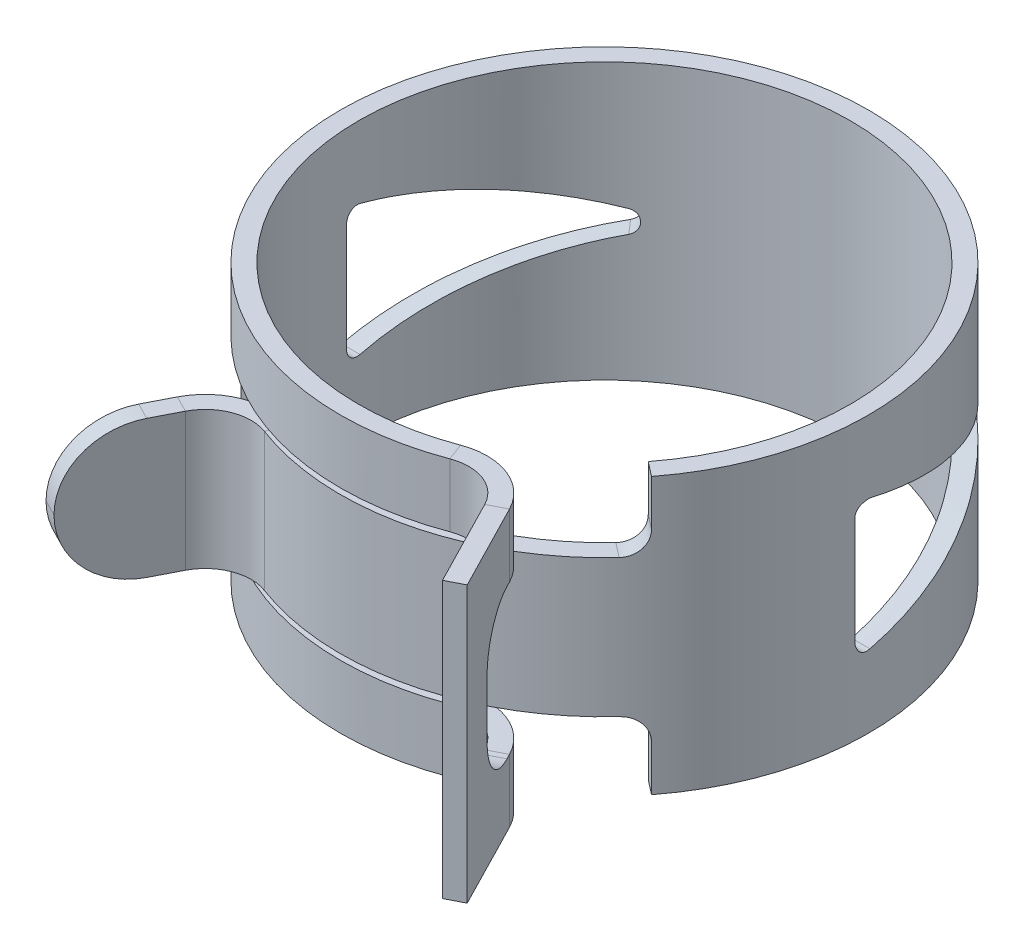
ISO-10303-21;
HEADER;
FILE_DESCRIPTION(('STEP AP214'),'2;1');
FILE_NAME('part.step','',(''),(''),'','','');
FILE_SCHEMA(('AUTOMOTIVE_DESIGN { 1 0 10303 214 1 1 1 1 }'));
ENDSEC;
DATA;
#1=APPLICATION_CONTEXT('core data for automotive mechanical design processes');
#2=APPLICATION_PROTOCOL_DEFINITION('international standard','automotive_design',2000,#1);
#3=PRODUCT_CONTEXT('',#1,'mechanical');
#4=PRODUCT('Part','Part','',(#3));
#5=PRODUCT_RELATED_PRODUCT_CATEGORY('part','',(#4));
#6=PRODUCT_DEFINITION_FORMATION('','',#4);
#7=PRODUCT_DEFINITION_CONTEXT('part definition',#1,'design');
#8=PRODUCT_DEFINITION('design','',#6,#7);
#9=PRODUCT_DEFINITION_SHAPE('','',#8);
#10=(LENGTH_UNIT() NAMED_UNIT(*) SI_UNIT(.MILLI.,.METRE.));
#11=(NAMED_UNIT(*) PLANE_ANGLE_UNIT() SI_UNIT($,.RADIAN.));
#12=(NAMED_UNIT(*) SI_UNIT($,.STERADIAN.) SOLID_ANGLE_UNIT());
#13=UNCERTAINTY_MEASURE_WITH_UNIT(LENGTH_MEASURE(1.E-05),#10,'distance_accuracy_value','');
#14=(GEOMETRIC_REPRESENTATION_CONTEXT(3) GLOBAL_UNCERTAINTY_ASSIGNED_CONTEXT((#13)) GLOBAL_UNIT_ASSIGNED_CONTEXT((#10,
#11,#12)) REPRESENTATION_CONTEXT('',''));
#15=CARTESIAN_POINT('',(0.,0.,0.));
#16=DIRECTION('',(0.,0.,1.));
#17=DIRECTION('',(1.,0.,0.));
#18=AXIS2_PLACEMENT_3D('',#15,#16,#17);
#19=CARTESIAN_POINT('',(-11.4998478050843,-2.84468304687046,-0.0591646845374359));
#20=CARTESIAN_POINT('',(-11.495655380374,-2.64804583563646,-0.87404684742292));
#21=CARTESIAN_POINT('',(-11.4045269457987,-2.45141441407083,-1.68843007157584));
#22=CARTESIAN_POINT('',(-11.05248799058,-2.0581457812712,-3.2797164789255));
#23=CARTESIAN_POINT('',(-10.7915894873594,-1.86151146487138,-4.05655362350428));
#24=CARTESIAN_POINT('',(-10.1117448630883,-1.46824283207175,-5.53774744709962));
#25=CARTESIAN_POINT('',(-9.69282183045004,-1.27160851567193,-6.24205382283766));
#26=CARTESIAN_POINT('',(-8.71577769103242,-0.878339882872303,-7.54647269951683));
#27=CARTESIAN_POINT('',(-8.15769882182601,-0.681708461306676,-8.14653303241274));
#28=CARTESIAN_POINT('',(-7.54256087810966,-0.485071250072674,-8.68100082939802));
#29=CARTESIAN_POINT('',(-10.6998583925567,-2.84468304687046,-0.055048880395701));
#30=CARTESIAN_POINT('',(-10.6959576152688,-2.64804586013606,-0.813243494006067));
#31=CARTESIAN_POINT('',(-10.6111685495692,-2.45141441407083,-1.57097406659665));
#32=CARTESIAN_POINT('',(-10.2836192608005,-2.0581457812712,-3.0515622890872));
#33=CARTESIAN_POINT('',(-10.0408702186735,-1.86151146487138,-3.77435858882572));
#34=CARTESIAN_POINT('',(-9.40831913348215,-1.46824283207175,-5.152512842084));
#35=CARTESIAN_POINT('',(-9.0185385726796,-1.27160851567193,-5.80782399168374));
#36=CARTESIAN_POINT('',(-8.10946272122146,-0.878339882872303,-7.0215006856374));
#37=CARTESIAN_POINT('',(-7.59020665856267,-0.681708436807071,-7.579817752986));
#38=CARTESIAN_POINT('',(-7.01786099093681,-0.485071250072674,-8.07710511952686));
#39=B_SPLINE_SURFACE_WITH_KNOTS('',1,3,((#19,#20,#21,#22,#23,#24,#25,#26,#27,#28),(#29,#30,#31,
#32,#33,#34,#35,#36,#37,#38)),.UNSPECIFIED.,.F.,.F.,.F.,(2,2),(4,2,2,2,4),(0.,1.),(0.,0.25,0.5,
0.75,1.),.UNSPECIFIED.);
#40=CARTESIAN_POINT('',(-10.6998583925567,-2.84468304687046,-0.0550488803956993));
#41=CARTESIAN_POINT('',(-11.4998478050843,-2.84468304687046,-0.0591646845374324));
#42=B_SPLINE_CURVE_WITH_KNOTS('',1,(#40,#41),.UNSPECIFIED.,.F.,.F.,(2,2),(0.,1.),.UNSPECIFIED.);
#43=CARTESIAN_POINT('',(-10.6998583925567,-2.84468304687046,-0.0550488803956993));
#44=VERTEX_POINT('',#43);
#45=CARTESIAN_POINT('',(-11.4998478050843,-2.84468304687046,-0.0591646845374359));
#46=VERTEX_POINT('',#45);
#47=EDGE_CURVE('E1697',#44,#46,#42,.T.);
#48=CARTESIAN_POINT('',(-10.6998583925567,-2.84468304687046,-0.055048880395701));
#49=CARTESIAN_POINT('',(-10.6959576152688,-2.64804586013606,-0.813243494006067));
#50=CARTESIAN_POINT('',(-10.6111685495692,-2.45141441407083,-1.57097406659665));
#51=CARTESIAN_POINT('',(-10.2836192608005,-2.0581457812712,-3.0515622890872));
#52=CARTESIAN_POINT('',(-10.0408702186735,-1.86151146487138,-3.77435858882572));
#53=CARTESIAN_POINT('',(-9.40831913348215,-1.46824283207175,-5.152512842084));
#54=CARTESIAN_POINT('',(-9.0185385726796,-1.27160851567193,-5.80782399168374));
#55=CARTESIAN_POINT('',(-8.10946272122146,-0.878339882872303,-7.0215006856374));
#56=CARTESIAN_POINT('',(-7.59020665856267,-0.681708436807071,-7.579817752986));
#57=CARTESIAN_POINT('',(-7.01786099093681,-0.485071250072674,-8.07710511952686));
#58=B_SPLINE_CURVE_WITH_KNOTS('',3,(#48,#49,#50,#51,#52,#53,#54,#55,#56,#57),.UNSPECIFIED.,.F.,
.F.,(4,2,2,2,4),(0.,0.25,0.5,0.75,1.),.UNSPECIFIED.);
#59=CARTESIAN_POINT('',(-7.01786099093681,-0.485071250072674,-8.07710511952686));
#60=VERTEX_POINT('',#59);
#61=EDGE_CURVE('E1485',#44,#60,#58,.T.);
#62=CARTESIAN_POINT('',(-7.01786099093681,-0.485071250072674,-8.07710511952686));
#63=CARTESIAN_POINT('',(-7.54256087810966,-0.485071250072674,-8.68100082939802));
#64=B_SPLINE_CURVE_WITH_KNOTS('',1,(#62,#63),.UNSPECIFIED.,.F.,.F.,(2,2),(0.,1.),.UNSPECIFIED.);
#65=CARTESIAN_POINT('',(-7.54256087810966,-0.485071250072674,-8.68100082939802));
#66=VERTEX_POINT('',#65);
#67=EDGE_CURVE('E1483',#60,#66,#64,.T.);
#68=CARTESIAN_POINT('',(-7.54256087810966,-0.485071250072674,-8.68100082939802));
#69=CARTESIAN_POINT('',(-8.15769882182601,-0.681708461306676,-8.14653303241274));
#70=CARTESIAN_POINT('',(-8.71577769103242,-0.878339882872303,-7.54647269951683));
#71=CARTESIAN_POINT('',(-9.69282183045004,-1.27160851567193,-6.24205382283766));
#72=CARTESIAN_POINT('',(-10.1117448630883,-1.46824283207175,-5.53774744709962));
#73=CARTESIAN_POINT('',(-10.7915894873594,-1.86151146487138,-4.05655362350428));
#74=CARTESIAN_POINT('',(-11.05248799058,-2.0581457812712,-3.2797164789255));
#75=CARTESIAN_POINT('',(-11.4045269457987,-2.45141441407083,-1.68843007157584));
#76=CARTESIAN_POINT('',(-11.495655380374,-2.64804583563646,-0.87404684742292));
#77=CARTESIAN_POINT('',(-11.4998478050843,-2.84468304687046,-0.0591646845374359));
#78=B_SPLINE_CURVE_WITH_KNOTS('',3,(#68,#69,#70,#71,#72,#73,#74,#75,#76,#77),.UNSPECIFIED.,.F.,
.F.,(4,2,2,2,4),(0.,0.25,0.5,0.75,1.),.UNSPECIFIED.);
#79=EDGE_CURVE('E1341',#46,#66,#78,.F.);
#80=ORIENTED_EDGE('',*,*,#47,.F.);
#81=ORIENTED_EDGE('',*,*,#61,.T.);
#82=ORIENTED_EDGE('',*,*,#67,.T.);
#83=ORIENTED_EDGE('',*,*,#79,.F.);
#84=EDGE_LOOP('',(#80,#81,#82,#83));
#85=FACE_BOUND('',#84,.T.);
#86=ADVANCED_FACE('F381',(#85),#39,.T.);
#87=CARTESIAN_POINT('',(-7.54256087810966,-0.485071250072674,-8.68100082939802));
#88=CARTESIAN_POINT('',(-7.49806689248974,-0.468906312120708,-8.71965980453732));
#89=CARTESIAN_POINT('',(-7.45788315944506,-0.446267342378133,-8.75397989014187));
#90=CARTESIAN_POINT('',(-7.40432415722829,-0.402597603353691,-8.79923462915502));
#91=CARTESIAN_POINT('',(-7.38758994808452,-0.386422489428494,-8.81328133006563));
#92=CARTESIAN_POINT('',(-7.36419238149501,-0.359732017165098,-8.83282366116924));
#93=CARTESIAN_POINT('',(-7.35667711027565,-0.350430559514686,-8.83908311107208));
#94=CARTESIAN_POINT('',(-7.34583291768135,-0.335871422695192,-8.84809362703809));
#95=CARTESIAN_POINT('',(-7.34228963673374,-0.330917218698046,-8.85103401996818));
#96=CARTESIAN_POINT('',(-7.33534641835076,-0.320806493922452,-8.85678910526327));
#97=CARTESIAN_POINT('',(-7.33225581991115,-0.316138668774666,-8.85934799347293));
#98=CARTESIAN_POINT('',(-7.29951928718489,-0.264421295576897,-8.88641907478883));
#99=CARTESIAN_POINT('',(-7.27767295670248,-0.215576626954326,-8.90425876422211));
#100=CARTESIAN_POINT('',(-7.25598427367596,-0.137999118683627,-8.92192687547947));
#101=CARTESIAN_POINT('',(-7.25060005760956,-0.111421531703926,-8.92629931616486));
#102=CARTESIAN_POINT('',(-7.24353869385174,-0.0568295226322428,-8.93203044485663));
#103=CARTESIAN_POINT('',(-7.24185715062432,-0.0295205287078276,-8.93339269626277));
#104=CARTESIAN_POINT('',(-7.24277373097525,0.117670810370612,-8.93264963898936));
#105=CARTESIAN_POINT('',(-7.27137034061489,0.220525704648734,-8.90968105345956));
#106=CARTESIAN_POINT('',(-7.33415541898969,0.319477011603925,-8.85777885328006));
#107=CARTESIAN_POINT('',(-7.3415550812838,0.330238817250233,-8.85164800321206));
#108=CARTESIAN_POINT('',(-7.35328583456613,0.34603234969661,-8.84190099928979));
#109=CARTESIAN_POINT('',(-7.35730129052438,0.351238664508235,-8.83856020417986));
#110=CARTESIAN_POINT('',(-7.36554187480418,0.36153490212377,-8.83169415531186));
#111=CARTESIAN_POINT('',(-7.36837126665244,0.36490407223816,-8.82933315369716));
#112=CARTESIAN_POINT('',(-7.38512644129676,0.383982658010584,-8.8153396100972));
#113=CARTESIAN_POINT('',(-7.40041732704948,0.398467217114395,-8.80251823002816));
#114=CARTESIAN_POINT('',(-7.45187456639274,0.439585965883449,-8.75908560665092));
#115=CARTESIAN_POINT('',(-7.49363219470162,0.463885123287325,-8.72351292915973));
#116=CARTESIAN_POINT('',(-7.54256087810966,0.485071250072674,-8.68100082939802));
#117=CARTESIAN_POINT('',(-7.01786099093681,-0.485071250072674,-8.07710511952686));
#118=CARTESIAN_POINT('',(-6.97646224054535,-0.468906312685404,-8.11307477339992));
#119=CARTESIAN_POINT('',(-6.93907389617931,-0.446267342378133,-8.14500737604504));
#120=CARTESIAN_POINT('',(-6.88924073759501,-0.402597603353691,-8.18711395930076));
#121=CARTESIAN_POINT('',(-6.8736706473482,-0.386422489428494,-8.20018349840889));
#122=CARTESIAN_POINT('',(-6.85190073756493,-0.359732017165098,-8.21836636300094));
#123=CARTESIAN_POINT('',(-6.84490826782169,-0.350430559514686,-8.22419037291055));
#124=CARTESIAN_POINT('',(-6.83481845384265,-0.335871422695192,-8.23257407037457));
#125=CARTESIAN_POINT('',(-6.83152166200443,-0.330917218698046,-8.23530991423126));
#126=CARTESIAN_POINT('',(-6.82506145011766,-0.320806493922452,-8.2406646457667));
#127=CARTESIAN_POINT('',(-6.82218584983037,-0.316138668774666,-8.24304552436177));
#128=CARTESIAN_POINT('',(-6.79172664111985,-0.264421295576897,-8.26823340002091));
#129=CARTESIAN_POINT('',(-6.77140005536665,-0.215576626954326,-8.28483206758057));
#130=CARTESIAN_POINT('',(-6.7512201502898,-0.137999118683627,-8.30127109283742));
#131=CARTESIAN_POINT('',(-6.74621048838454,-0.111421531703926,-8.305339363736));
#132=CARTESIAN_POINT('',(-6.73964034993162,-0.0568295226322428,-8.31067180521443));
#133=CARTESIAN_POINT('',(-6.73807578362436,-0.0295205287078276,-8.31193929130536));
#134=CARTESIAN_POINT('',(-6.73892860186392,0.117670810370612,-8.31124792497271));
#135=CARTESIAN_POINT('',(-6.76553588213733,0.220525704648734,-8.28987715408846));
#136=CARTESIAN_POINT('',(-6.82395330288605,0.319477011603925,-8.24158554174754));
#137=CARTESIAN_POINT('',(-6.83083820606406,0.330238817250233,-8.23588118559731));
#138=CARTESIAN_POINT('',(-6.84175290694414,0.34603234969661,-8.2268122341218));
#139=CARTESIAN_POINT('',(-6.84548902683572,0.351238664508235,-8.22370384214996));
#140=CARTESIAN_POINT('',(-6.85315635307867,0.36153490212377,-8.21731543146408));
#141=CARTESIAN_POINT('',(-6.85578891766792,0.36490407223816,-8.21511867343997));
#142=CARTESIAN_POINT('',(-6.87137851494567,0.383982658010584,-8.20209859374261));
#143=CARTESIAN_POINT('',(-6.8856056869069,0.398467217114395,-8.19016913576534));
#144=CARTESIAN_POINT('',(-6.9334832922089,0.439585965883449,-8.1497579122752));
#145=CARTESIAN_POINT('',(-6.9723360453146,0.463885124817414,-8.11665985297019));
#146=CARTESIAN_POINT('',(-7.01786099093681,0.485071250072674,-8.07710511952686));
#147=B_SPLINE_SURFACE_WITH_KNOTS('',1,3,((#87,#88,#89,#90,#91,#92,#93,#94,#95,#96,#97,#98,#99,
#100,#101,#102,#103,#104,#105,#106,#107,#108,#109,#110,#111,#112,#113,#114,#115,#116),(#117,
#118,#119,#120,#121,#122,#123,#124,#125,#126,#127,#128,#129,#130,#131,#132,#133,#134,#135,#136,
#137,#138,#139,#140,#141,#142,#143,#144,#145,#146)),.UNSPECIFIED.,.F.,.F.,.F.,(2,2),(4,2,2,2,2,
2,2,2,2,2,2,2,2,2,4),(0.,1.),(0.,0.125,0.1875,0.21875,0.234375,0.25,0.375,0.4375,0.5,0.75,
0.78125,0.796875,0.8125,0.875,1.),.UNSPECIFIED.);
#148=CARTESIAN_POINT('',(-7.01786099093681,-0.485071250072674,-8.07710511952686));
#149=CARTESIAN_POINT('',(-6.97646224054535,-0.468906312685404,-8.11307477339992));
#150=CARTESIAN_POINT('',(-6.93907389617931,-0.446267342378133,-8.14500737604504));
#151=CARTESIAN_POINT('',(-6.88924073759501,-0.402597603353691,-8.18711395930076));
#152=CARTESIAN_POINT('',(-6.8736706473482,-0.386422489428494,-8.20018349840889));
#153=CARTESIAN_POINT('',(-6.85190073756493,-0.359732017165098,-8.21836636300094));
#154=CARTESIAN_POINT('',(-6.84490826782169,-0.350430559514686,-8.22419037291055));
#155=CARTESIAN_POINT('',(-6.83481845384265,-0.335871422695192,-8.23257407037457));
#156=CARTESIAN_POINT('',(-6.83152166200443,-0.330917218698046,-8.23530991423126));
#157=CARTESIAN_POINT('',(-6.82506145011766,-0.320806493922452,-8.2406646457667));
#158=CARTESIAN_POINT('',(-6.82218584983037,-0.316138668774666,-8.24304552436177));
#159=CARTESIAN_POINT('',(-6.79172664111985,-0.264421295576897,-8.26823340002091));
#160=CARTESIAN_POINT('',(-6.77140005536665,-0.215576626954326,-8.28483206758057));
#161=CARTESIAN_POINT('',(-6.7512201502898,-0.137999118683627,-8.30127109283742));
#162=CARTESIAN_POINT('',(-6.74621048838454,-0.111421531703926,-8.305339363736));
#163=CARTESIAN_POINT('',(-6.73964034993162,-0.0568295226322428,-8.31067180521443));
#164=CARTESIAN_POINT('',(-6.73807578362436,-0.0295205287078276,-8.31193929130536));
#165=CARTESIAN_POINT('',(-6.73892860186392,0.117670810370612,-8.31124792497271));
#166=CARTESIAN_POINT('',(-6.76553588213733,0.220525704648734,-8.28987715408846));
#167=CARTESIAN_POINT('',(-6.82395330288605,0.319477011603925,-8.24158554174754));
#168=CARTESIAN_POINT('',(-6.83083820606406,0.330238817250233,-8.23588118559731));
#169=CARTESIAN_POINT('',(-6.84175290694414,0.34603234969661,-8.2268122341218));
#170=CARTESIAN_POINT('',(-6.84548902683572,0.351238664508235,-8.22370384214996));
#171=CARTESIAN_POINT('',(-6.85315635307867,0.36153490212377,-8.21731543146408));
#172=CARTESIAN_POINT('',(-6.85578891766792,0.36490407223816,-8.21511867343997));
#173=CARTESIAN_POINT('',(-6.87137851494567,0.383982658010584,-8.20209859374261));
#174=CARTESIAN_POINT('',(-6.8856056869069,0.398467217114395,-8.19016913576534));
#175=CARTESIAN_POINT('',(-6.9334832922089,0.439585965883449,-8.1497579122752));
#176=CARTESIAN_POINT('',(-6.9723360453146,0.463885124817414,-8.11665985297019));
#177=CARTESIAN_POINT('',(-7.01786099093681,0.485071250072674,-8.07710511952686));
#178=B_SPLINE_CURVE_WITH_KNOTS('',3,(#148,#149,#150,#151,#152,#153,#154,#155,#156,#157,#158,
#159,#160,#161,#162,#163,#164,#165,#166,#167,#168,#169,#170,#171,#172,#173,#174,#175,#176,#177),
.UNSPECIFIED.,.F.,.F.,(4,2,2,2,2,2,2,2,2,2,2,2,2,2,4),(0.,0.125,0.1875,0.21875,0.234375,0.25,
0.375,0.4375,0.5,0.75,0.78125,0.796875,0.8125,0.875,1.),.UNSPECIFIED.);
#179=CARTESIAN_POINT('',(-7.01786099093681,0.485071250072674,-8.07710511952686));
#180=VERTEX_POINT('',#179);
#181=EDGE_CURVE('E1477',#60,#180,#178,.T.);
#182=CARTESIAN_POINT('',(-7.01786099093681,0.485071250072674,-8.07710511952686));
#183=CARTESIAN_POINT('',(-7.54256087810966,0.485071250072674,-8.68100082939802));
#184=B_SPLINE_CURVE_WITH_KNOTS('',1,(#182,#183),.UNSPECIFIED.,.F.,.F.,(2,2),(0.,1.),.UNSPECIFIED.);
#185=CARTESIAN_POINT('',(-7.54256087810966,0.485071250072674,-8.68100082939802));
#186=VERTEX_POINT('',#185);
#187=EDGE_CURVE('E1460',#180,#186,#184,.T.);
#188=CARTESIAN_POINT('',(-7.54256087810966,0.485071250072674,-8.68100082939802));
#189=CARTESIAN_POINT('',(-7.49363219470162,0.463885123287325,-8.72351292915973));
#190=CARTESIAN_POINT('',(-7.45187456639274,0.439585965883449,-8.75908560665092));
#191=CARTESIAN_POINT('',(-7.40041732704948,0.398467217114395,-8.80251823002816));
#192=CARTESIAN_POINT('',(-7.38512644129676,0.383982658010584,-8.8153396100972));
#193=CARTESIAN_POINT('',(-7.36837126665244,0.36490407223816,-8.82933315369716));
#194=CARTESIAN_POINT('',(-7.36554187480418,0.36153490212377,-8.83169415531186));
#195=CARTESIAN_POINT('',(-7.35730129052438,0.351238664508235,-8.83856020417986));
#196=CARTESIAN_POINT('',(-7.35328583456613,0.34603234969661,-8.84190099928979));
#197=CARTESIAN_POINT('',(-7.3415550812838,0.330238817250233,-8.85164800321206));
#198=CARTESIAN_POINT('',(-7.33415541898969,0.319477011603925,-8.85777885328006));
#199=CARTESIAN_POINT('',(-7.27137034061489,0.220525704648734,-8.90968105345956));
#200=CARTESIAN_POINT('',(-7.24277373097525,0.117670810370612,-8.93264963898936));
#201=CARTESIAN_POINT('',(-7.24185715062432,-0.0295205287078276,-8.93339269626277));
#202=CARTESIAN_POINT('',(-7.24353869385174,-0.0568295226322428,-8.93203044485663));
#203=CARTESIAN_POINT('',(-7.25060005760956,-0.111421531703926,-8.92629931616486));
#204=CARTESIAN_POINT('',(-7.25598427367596,-0.137999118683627,-8.92192687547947));
#205=CARTESIAN_POINT('',(-7.27767295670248,-0.215576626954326,-8.90425876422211));
#206=CARTESIAN_POINT('',(-7.29951928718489,-0.264421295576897,-8.88641907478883));
#207=CARTESIAN_POINT('',(-7.33225581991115,-0.316138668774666,-8.85934799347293));
#208=CARTESIAN_POINT('',(-7.33534641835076,-0.320806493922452,-8.85678910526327));
#209=CARTESIAN_POINT('',(-7.34228963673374,-0.330917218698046,-8.85103401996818));
#210=CARTESIAN_POINT('',(-7.34583291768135,-0.335871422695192,-8.84809362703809));
#211=CARTESIAN_POINT('',(-7.35667711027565,-0.350430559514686,-8.83908311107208));
#212=CARTESIAN_POINT('',(-7.36419238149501,-0.359732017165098,-8.83282366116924));
#213=CARTESIAN_POINT('',(-7.38758994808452,-0.386422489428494,-8.81328133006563));
#214=CARTESIAN_POINT('',(-7.40432415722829,-0.402597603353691,-8.79923462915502));
#215=CARTESIAN_POINT('',(-7.45788315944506,-0.446267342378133,-8.75397989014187));
#216=CARTESIAN_POINT('',(-7.49806689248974,-0.468906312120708,-8.71965980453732));
#217=CARTESIAN_POINT('',(-7.54256087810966,-0.485071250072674,-8.68100082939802));
#218=B_SPLINE_CURVE_WITH_KNOTS('',3,(#188,#189,#190,#191,#192,#193,#194,#195,#196,#197,#198,
#199,#200,#201,#202,#203,#204,#205,#206,#207,#208,#209,#210,#211,#212,#213,#214,#215,#216,#217),
.UNSPECIFIED.,.F.,.F.,(4,2,2,2,2,2,2,2,2,2,2,2,2,2,4),(0.,0.125,0.1875,0.203125,0.21875,0.25,
0.5,0.5625,0.625,0.75,0.765625,0.78125,0.8125,0.875,1.),.UNSPECIFIED.);
#219=EDGE_CURVE('E1337',#66,#186,#218,.F.);
#220=ORIENTED_EDGE('',*,*,#67,.F.);
#221=ORIENTED_EDGE('',*,*,#181,.T.);
#222=ORIENTED_EDGE('',*,*,#187,.T.);
#223=ORIENTED_EDGE('',*,*,#219,.F.);
#224=EDGE_LOOP('',(#220,#221,#222,#223));
#225=FACE_BOUND('',#224,.T.);
#226=ADVANCED_FACE('F1430',(#225),#147,.T.);
#227=CARTESIAN_POINT('',(-7.54256087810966,0.485071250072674,-8.68100082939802));
#228=CARTESIAN_POINT('',(-8.15769882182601,0.681708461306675,-8.14653303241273));
#229=CARTESIAN_POINT('',(-8.71577769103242,0.878339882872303,-7.54647269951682));
#230=CARTESIAN_POINT('',(-9.69282183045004,1.27160851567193,-6.24205382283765));
#231=CARTESIAN_POINT('',(-10.1117448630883,1.46824283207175,-5.53774744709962));
#232=CARTESIAN_POINT('',(-10.7915894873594,1.86151146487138,-4.05655362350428));
#233=CARTESIAN_POINT('',(-11.05248799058,2.0581457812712,-3.2797164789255));
#234=CARTESIAN_POINT('',(-11.4045269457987,2.45141441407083,-1.68843007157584));
#235=CARTESIAN_POINT('',(-11.495655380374,2.64804583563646,-0.87404684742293));
#236=CARTESIAN_POINT('',(-11.4998478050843,2.84468304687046,-0.0591646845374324));
#237=CARTESIAN_POINT('',(-7.01786099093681,0.485071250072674,-8.07710511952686));
#238=CARTESIAN_POINT('',(-7.59020665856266,0.681708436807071,-7.579817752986));
#239=CARTESIAN_POINT('',(-8.10946272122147,0.878339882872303,-7.02150068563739));
#240=CARTESIAN_POINT('',(-9.0185385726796,1.27160851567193,-5.80782399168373));
#241=CARTESIAN_POINT('',(-9.40831913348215,1.46824283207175,-5.152512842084));
#242=CARTESIAN_POINT('',(-10.0408702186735,1.86151146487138,-3.77435858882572));
#243=CARTESIAN_POINT('',(-10.2836192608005,2.0581457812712,-3.0515622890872));
#244=CARTESIAN_POINT('',(-10.6111685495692,2.45141441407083,-1.57097406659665));
#245=CARTESIAN_POINT('',(-10.6959576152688,2.64804586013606,-0.813243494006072));
#246=CARTESIAN_POINT('',(-10.6998583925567,2.84468304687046,-0.0550488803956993));
#247=B_SPLINE_SURFACE_WITH_KNOTS('',1,3,((#227,#228,#229,#230,#231,#232,#233,#234,#235,#236),
(#237,#238,#239,#240,#241,#242,#243,#244,#245,#246)),.UNSPECIFIED.,.F.,.F.,.F.,(2,2),(4,2,2,2,
4),(0.,1.),(0.,0.25,0.5,0.75,1.),.UNSPECIFIED.);
#248=CARTESIAN_POINT('',(-7.01786099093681,0.485071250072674,-8.07710511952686));
#249=CARTESIAN_POINT('',(-7.59020665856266,0.681708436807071,-7.579817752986));
#250=CARTESIAN_POINT('',(-8.10946272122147,0.878339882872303,-7.02150068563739));
#251=CARTESIAN_POINT('',(-9.0185385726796,1.27160851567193,-5.80782399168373));
#252=CARTESIAN_POINT('',(-9.40831913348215,1.46824283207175,-5.152512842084));
#253=CARTESIAN_POINT('',(-10.0408702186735,1.86151146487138,-3.77435858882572));
#254=CARTESIAN_POINT('',(-10.2836192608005,2.0581457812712,-3.0515622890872));
#255=CARTESIAN_POINT('',(-10.6111685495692,2.45141441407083,-1.57097406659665));
#256=CARTESIAN_POINT('',(-10.6959576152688,2.64804586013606,-0.813243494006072));
#257=CARTESIAN_POINT('',(-10.6998583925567,2.84468304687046,-0.0550488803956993));
#258=B_SPLINE_CURVE_WITH_KNOTS('',3,(#248,#249,#250,#251,#252,#253,#254,#255,#256,#257),
.UNSPECIFIED.,.F.,.F.,(4,2,2,2,4),(0.,0.25,0.5,0.75,1.),.UNSPECIFIED.);
#259=CARTESIAN_POINT('',(-10.6998583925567,2.84468304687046,-0.0550488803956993));
#260=VERTEX_POINT('',#259);
#261=EDGE_CURVE('E1474',#180,#260,#258,.T.);
#262=CARTESIAN_POINT('',(-10.6998583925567,2.84468304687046,-0.0550488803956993));
#263=CARTESIAN_POINT('',(-11.4998478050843,2.84468304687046,-0.0591646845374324));
#264=B_SPLINE_CURVE_WITH_KNOTS('',1,(#262,#263),.UNSPECIFIED.,.F.,.F.,(2,2),(0.,1.),.UNSPECIFIED.);
#265=CARTESIAN_POINT('',(-11.4998478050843,2.84468304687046,-0.0591646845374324));
#266=VERTEX_POINT('',#265);
#267=EDGE_CURVE('E1414',#260,#266,#264,.T.);
#268=CARTESIAN_POINT('',(-11.4998478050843,2.84468304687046,-0.0591646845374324));
#269=CARTESIAN_POINT('',(-11.495655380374,2.64804583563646,-0.87404684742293));
#270=CARTESIAN_POINT('',(-11.4045269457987,2.45141441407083,-1.68843007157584));
#271=CARTESIAN_POINT('',(-11.05248799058,2.0581457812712,-3.2797164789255));
#272=CARTESIAN_POINT('',(-10.7915894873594,1.86151146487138,-4.05655362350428));
#273=CARTESIAN_POINT('',(-10.1117448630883,1.46824283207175,-5.53774744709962));
#274=CARTESIAN_POINT('',(-9.69282183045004,1.27160851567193,-6.24205382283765));
#275=CARTESIAN_POINT('',(-8.71577769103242,0.878339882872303,-7.54647269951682));
#276=CARTESIAN_POINT('',(-8.15769882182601,0.681708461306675,-8.14653303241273));
#277=CARTESIAN_POINT('',(-7.54256087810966,0.485071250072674,-8.68100082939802));
#278=B_SPLINE_CURVE_WITH_KNOTS('',3,(#268,#269,#270,#271,#272,#273,#274,#275,#276,#277),
.UNSPECIFIED.,.F.,.F.,(4,2,2,2,4),(0.,0.25,0.5,0.75,1.),.UNSPECIFIED.);
#279=EDGE_CURVE('E1336',#186,#266,#278,.F.);
#280=ORIENTED_EDGE('',*,*,#187,.F.);
#281=ORIENTED_EDGE('',*,*,#261,.T.);
#282=ORIENTED_EDGE('',*,*,#267,.T.);
#283=ORIENTED_EDGE('',*,*,#279,.F.);
#284=EDGE_LOOP('',(#280,#281,#282,#283));
#285=FACE_BOUND('',#284,.T.);
#286=ADVANCED_FACE('F1419',(#285),#247,.T.);
#287=CARTESIAN_POINT('',(-11.4998478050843,2.84468304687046,-0.0591646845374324));
#288=CARTESIAN_POINT('',(-11.5007073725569,2.87890988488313,0.107909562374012));
#289=CARTESIAN_POINT('',(-11.4978324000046,2.84920615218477,0.255864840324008));
#290=CARTESIAN_POINT('',(-11.4926603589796,2.73401033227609,0.411987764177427));
#291=CARTESIAN_POINT('',(-11.4916028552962,2.70789852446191,0.440102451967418));
#292=CARTESIAN_POINT('',(-11.4900845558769,2.66412184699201,0.477612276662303));
#293=CARTESIAN_POINT('',(-11.489589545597,2.64876146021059,0.489338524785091));
#294=CARTESIAN_POINT('',(-11.4888743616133,2.62456863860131,0.505762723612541));
#295=CARTESIAN_POINT('',(-11.4886147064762,2.61538920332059,0.511613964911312));
#296=CARTESIAN_POINT('',(-11.4882479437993,2.60173930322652,0.519784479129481));
#297=CARTESIAN_POINT('',(-11.4880701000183,2.59464818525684,0.523697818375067));
#298=CARTESIAN_POINT('',(-11.4865240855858,2.5284326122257,0.557370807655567));
#299=CARTESIAN_POINT('',(-11.4855535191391,2.45253957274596,0.576301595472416));
#300=CARTESIAN_POINT('',(-11.4851497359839,2.35961179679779,0.584239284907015));
#301=CARTESIAN_POINT('',(-10.6998583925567,2.84468304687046,-0.0550488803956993));
#302=CARTESIAN_POINT('',(-10.7006582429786,2.87891326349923,0.100418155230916));
#303=CARTESIAN_POINT('',(-10.6979831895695,2.84920615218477,0.238065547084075));
#304=CARTESIAN_POINT('',(-10.6931709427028,2.73401033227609,0.383327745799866));
#305=CARTESIAN_POINT('',(-10.692187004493,2.70789852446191,0.409486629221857));
#306=CARTESIAN_POINT('',(-10.6907743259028,2.66412184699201,0.444387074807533));
#307=CARTESIAN_POINT('',(-10.6903137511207,2.64876146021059,0.455297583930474));
#308=CARTESIAN_POINT('',(-10.6896483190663,2.62456863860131,0.470579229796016));
#309=CARTESIAN_POINT('',(-10.6894067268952,2.61538920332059,0.476023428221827));
#310=CARTESIAN_POINT('',(-10.6890654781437,2.60173930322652,0.483625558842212));
#311=CARTESIAN_POINT('',(-10.6889000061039,2.59464818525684,0.487266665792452));
#312=CARTESIAN_POINT('',(-10.6874615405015,2.5284326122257,0.518597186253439));
#313=CARTESIAN_POINT('',(-10.6865584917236,2.452539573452,0.536211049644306));
#314=CARTESIAN_POINT('',(-10.6861827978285,2.35961179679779,0.543596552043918));
#315=B_SPLINE_SURFACE_WITH_KNOTS('',1,3,((#287,#288,#289,#290,#291,#292,#293,#294,#295,#296,
#297,#298,#299,#300),(#301,#302,#303,#304,#305,#306,#307,#308,#309,#310,#311,#312,#313,#314)),
.UNSPECIFIED.,.F.,.F.,.F.,(2,2),(4,2,2,2,2,2,4),(0.,1.),(0.,0.5,0.625,0.6875,0.71875,0.75,1.),.UNSPECIFIED.);
#316=CARTESIAN_POINT('',(-10.6998583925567,2.84468304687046,-0.0550488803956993));
#317=CARTESIAN_POINT('',(-10.7006582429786,2.87891326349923,0.100418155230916));
#318=CARTESIAN_POINT('',(-10.6979831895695,2.84920615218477,0.238065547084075));
#319=CARTESIAN_POINT('',(-10.6931709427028,2.73401033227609,0.383327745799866));
#320=CARTESIAN_POINT('',(-10.692187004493,2.70789852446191,0.409486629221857));
#321=CARTESIAN_POINT('',(-10.6907743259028,2.66412184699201,0.444387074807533));
#322=CARTESIAN_POINT('',(-10.6903137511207,2.64876146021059,0.455297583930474));
#323=CARTESIAN_POINT('',(-10.6896483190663,2.62456863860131,0.470579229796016));
#324=CARTESIAN_POINT('',(-10.6894067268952,2.61538920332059,0.476023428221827));
#325=CARTESIAN_POINT('',(-10.6890654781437,2.60173930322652,0.483625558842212));
#326=CARTESIAN_POINT('',(-10.6889000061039,2.59464818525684,0.487266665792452));
#327=CARTESIAN_POINT('',(-10.6874615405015,2.5284326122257,0.518597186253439));
#328=CARTESIAN_POINT('',(-10.6865584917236,2.452539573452,0.536211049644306));
#329=CARTESIAN_POINT('',(-10.6861827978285,2.35961179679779,0.543596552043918));
#330=B_SPLINE_CURVE_WITH_KNOTS('',3,(#316,#317,#318,#319,#320,#321,#322,#323,#324,#325,#326,
#327,#328,#329),.UNSPECIFIED.,.F.,.F.,(4,2,2,2,2,2,4),(0.,0.5,0.625,0.6875,0.71875,0.75,1.),.UNSPECIFIED.);
#331=CARTESIAN_POINT('',(-10.6861827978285,2.35961179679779,0.543596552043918));
#332=VERTEX_POINT('',#331);
#333=EDGE_CURVE('E1480',#260,#332,#330,.T.);
#334=CARTESIAN_POINT('',(-10.6861827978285,2.35961179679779,0.543596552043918));
#335=CARTESIAN_POINT('',(-11.4851497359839,2.35961179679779,0.584239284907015));
#336=B_SPLINE_CURVE_WITH_KNOTS('',1,(#334,#335),.UNSPECIFIED.,.F.,.F.,(2,2),(0.,1.),.UNSPECIFIED.);
#337=CARTESIAN_POINT('',(-11.4851497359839,2.35961179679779,0.584239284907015));
#338=VERTEX_POINT('',#337);
#339=EDGE_CURVE('E1363',#332,#338,#336,.T.);
#340=CARTESIAN_POINT('',(-11.4851497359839,2.35961179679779,0.584239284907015));
#341=CARTESIAN_POINT('',(-11.4855535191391,2.45253957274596,0.576301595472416));
#342=CARTESIAN_POINT('',(-11.4865240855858,2.5284326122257,0.557370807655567));
#343=CARTESIAN_POINT('',(-11.4880701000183,2.59464818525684,0.523697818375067));
#344=CARTESIAN_POINT('',(-11.4882479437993,2.60173930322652,0.519784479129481));
#345=CARTESIAN_POINT('',(-11.4886147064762,2.61538920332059,0.511613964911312));
#346=CARTESIAN_POINT('',(-11.4888743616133,2.62456863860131,0.505762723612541));
#347=CARTESIAN_POINT('',(-11.489589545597,2.64876146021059,0.489338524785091));
#348=CARTESIAN_POINT('',(-11.4900845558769,2.66412184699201,0.477612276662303));
#349=CARTESIAN_POINT('',(-11.4916028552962,2.70789852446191,0.440102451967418));
#350=CARTESIAN_POINT('',(-11.4926603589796,2.73401033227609,0.411987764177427));
#351=CARTESIAN_POINT('',(-11.4978324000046,2.84920615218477,0.255864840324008));
#352=CARTESIAN_POINT('',(-11.5007073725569,2.87890988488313,0.107909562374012));
#353=CARTESIAN_POINT('',(-11.4998478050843,2.84468304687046,-0.0591646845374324));
#354=B_SPLINE_CURVE_WITH_KNOTS('',3,(#340,#341,#342,#343,#344,#345,#346,#347,#348,#349,#350,
#351,#352,#353),.UNSPECIFIED.,.F.,.F.,(4,2,2,2,2,2,4),(0.,0.25,0.28125,0.3125,0.375,0.5,1.),.UNSPECIFIED.);
#355=EDGE_CURVE('E1331',#266,#338,#354,.F.);
#356=ORIENTED_EDGE('',*,*,#267,.F.);
#357=ORIENTED_EDGE('',*,*,#333,.T.);
#358=ORIENTED_EDGE('',*,*,#339,.T.);
#359=ORIENTED_EDGE('',*,*,#355,.F.);
#360=EDGE_LOOP('',(#356,#357,#358,#359));
#361=FACE_BOUND('',#360,.T.);
#362=ADVANCED_FACE('F1393',(#361),#315,.T.);
#363=CARTESIAN_POINT('',(-11.4851497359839,0.,0.584239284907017));
#364=DIRECTION('',(-0.0508034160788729,0.,-0.998708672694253));
#365=DIRECTION('',(0.,-1.,0.));
#366=AXIS2_PLACEMENT_3D('',#363,#364,#365);
#367=PLANE('',#366);
#368=ORIENTED_EDGE('',*,*,#339,.F.);
#369=DIRECTION('',(0.,-1.,0.));
#370=VECTOR('',#369,1.);
#371=CARTESIAN_POINT('',(-10.6861827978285,45.9119900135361,0.543596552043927));
#372=LINE('',#371,#370);
#373=CARTESIAN_POINT('',(-10.6861827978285,-2.35961179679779,0.543596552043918));
#374=VERTEX_POINT('',#373);
#375=EDGE_CURVE('E1368',#332,#374,#372,.T.);
#376=ORIENTED_EDGE('',*,*,#375,.T.);
#377=CARTESIAN_POINT('',(-11.4851497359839,-2.35961179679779,0.584239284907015));
#378=CARTESIAN_POINT('',(-10.6861827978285,-2.35961179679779,0.543596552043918));
#379=B_SPLINE_CURVE_WITH_KNOTS('',1,(#377,#378),.UNSPECIFIED.,.F.,.F.,(2,2),(0.,1.),.UNSPECIFIED.);
#380=CARTESIAN_POINT('',(-11.4851497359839,-2.35961179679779,0.584239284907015));
#381=VERTEX_POINT('',#380);
#382=EDGE_CURVE('E1366',#374,#381,#379,.F.);
#383=ORIENTED_EDGE('',*,*,#382,.T.);
#384=DIRECTION('',(0.,-1.,0.));
#385=VECTOR('',#384,1.);
#386=CARTESIAN_POINT('',(-11.4851497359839,-2.35961179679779,0.584239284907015));
#387=LINE('',#386,#385);
#388=EDGE_CURVE('E1335',#338,#381,#387,.T.);
#389=ORIENTED_EDGE('',*,*,#388,.F.);
#390=EDGE_LOOP('',(#368,#376,#383,#389));
#391=FACE_BOUND('',#390,.T.);
#392=ADVANCED_FACE('F1361',(#391),#367,.T.);
#393=CARTESIAN_POINT('',(0.,-3.25,0.));
#394=DIRECTION('',(0.,1.,0.));
#395=DIRECTION('',(-0.115290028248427,0.,0.993331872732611));
#396=AXIS2_PLACEMENT_3D('',#393,#394,#395);
#397=PLANE('',#396);
#398=CARTESIAN_POINT('',(0.,-3.25,0.));
#399=DIRECTION('',(0.,-1.,0.));
#400=DIRECTION('',(-0.993331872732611,0.,-0.115290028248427));
#401=AXIS2_PLACEMENT_3D('',#398,#399,#400);
#402=CIRCLE('',#401,10.7);
#403=CARTESIAN_POINT('',(-7.90884115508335,-3.25000667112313,7.20695716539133));
#404=VERTEX_POINT('',#403);
#405=CARTESIAN_POINT('',(-8.00259407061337,-3.25,7.10270991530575));
#406=VERTEX_POINT('',#405);
#407=EDGE_CURVE('E1709',#404,#406,#402,.T.);
#408=ORIENTED_EDGE('',*,*,#407,.T.);
#409=CARTESIAN_POINT('',(-8.60091886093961,-3.25,7.63375364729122));
#410=CARTESIAN_POINT('',(-8.00259407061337,-3.25,7.10270991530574));
#411=B_SPLINE_CURVE_WITH_KNOTS('',1,(#409,#410),.UNSPECIFIED.,.F.,.F.,(2,2),(0.,1.),.UNSPECIFIED.);
#412=CARTESIAN_POINT('',(-8.60091886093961,-3.25,7.63375364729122));
#413=VERTEX_POINT('',#412);
#414=EDGE_CURVE('E1373',#406,#413,#411,.F.);
#415=ORIENTED_EDGE('',*,*,#414,.T.);
#416=CARTESIAN_POINT('',(0.,-3.25,0.));
#417=DIRECTION('',(0.,-1.,0.));
#418=DIRECTION('',(0.115290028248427,0.,-0.993331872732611));
#419=AXIS2_PLACEMENT_3D('',#416,#417,#418);
#420=CIRCLE('',#419,11.5);
#421=CARTESIAN_POINT('',(4.03586210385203,-3.25,10.7685568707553));
#422=VERTEX_POINT('',#421);
#423=EDGE_CURVE('E1670',#422,#413,#420,.T.);
#424=ORIENTED_EDGE('',*,*,#423,.F.);
#425=DIRECTION('',(0.350944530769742,0.,0.936396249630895));
#426=VECTOR('',#425,1.);
#427=CARTESIAN_POINT('',(3.75510647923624,-3.25,10.0194398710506));
#428=LINE('',#427,#426);
#429=CARTESIAN_POINT('',(3.75510647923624,-3.25,10.0194398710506));
#430=VERTEX_POINT('',#429);
#431=EDGE_CURVE('E12',#430,#422,#428,.T.);
#432=ORIENTED_EDGE('',*,*,#431,.F.);
#433=CARTESIAN_POINT('',(-7.90875340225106,-3.25000664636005,7.20705346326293));
#434=VERTEX_POINT('',#433);
#435=EDGE_CURVE('E1543',#430,#434,#402,.T.);
#436=ORIENTED_EDGE('',*,*,#435,.T.);
#437=EDGE_CURVE('E409',#434,#404,#402,.T.);
#438=ORIENTED_EDGE('',*,*,#437,.T.);
#439=EDGE_LOOP('',(#408,#415,#424,#432,#436,#438));
#440=FACE_BOUND('',#439,.T.);
#441=ADVANCED_FACE('F1392',(#440),#397,.T.);
#442=CARTESIAN_POINT('',(-8.60091886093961,-3.25,7.63375364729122));
#443=CARTESIAN_POINT('',(-8.65678505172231,-3.2458787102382,7.57080943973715));
#444=CARTESIAN_POINT('',(-8.70570409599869,-3.24059634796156,7.51431826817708));
#445=CARTESIAN_POINT('',(-8.76927415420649,-3.23093105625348,7.43981831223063));
#446=CARTESIAN_POINT('',(-8.78882791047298,-3.22741900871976,7.41668955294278));
#447=CARTESIAN_POINT('',(-8.8157672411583,-3.22171551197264,7.38460851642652));
#448=CARTESIAN_POINT('',(-8.82434837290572,-3.21974177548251,7.37435008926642));
#449=CARTESIAN_POINT('',(-8.83662912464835,-3.21667231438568,7.35962136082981));
#450=CARTESIAN_POINT('',(-8.84062421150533,-3.2156310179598,7.35482159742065));
#451=CARTESIAN_POINT('',(-8.84646991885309,-3.21404185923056,7.34778737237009));
#452=CARTESIAN_POINT('',(-8.84839400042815,-3.21350760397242,7.34547020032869));
#453=CARTESIAN_POINT('',(-8.85124349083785,-3.2126994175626,7.34203588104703));
#454=CARTESIAN_POINT('',(-8.85218721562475,-3.21242888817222,7.34089801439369));
#455=CARTESIAN_POINT('',(-8.85406247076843,-3.21188556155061,7.33863610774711));
#456=CARTESIAN_POINT('',(-8.8546173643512,-3.21172424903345,7.33796671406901));
#457=CARTESIAN_POINT('',(-8.93925243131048,-3.18667221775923,7.23580191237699));
#458=CARTESIAN_POINT('',(-9.01846686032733,-3.14961158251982,7.13664910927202));
#459=CARTESIAN_POINT('',(-9.16595330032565,-3.05288904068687,6.94620796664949));
#460=CARTESIAN_POINT('',(-9.23458443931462,-2.99256966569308,6.85450568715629));
#461=CARTESIAN_POINT('',(-9.36240823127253,-2.84801470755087,6.67885544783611));
#462=CARTESIAN_POINT('',(-9.42128515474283,-2.76433359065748,6.59536690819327));
#463=CARTESIAN_POINT('',(-9.53159860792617,-2.57083728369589,6.4349130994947));
#464=CARTESIAN_POINT('',(-9.57890409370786,-2.46843146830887,6.36395733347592));
#465=CARTESIAN_POINT('',(-9.63907222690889,-2.30633625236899,6.2721308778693));
#466=CARTESIAN_POINT('',(-9.65732729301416,-2.25089009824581,6.24395411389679));
#467=CARTESIAN_POINT('',(-9.69036723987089,-2.13716895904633,6.19255328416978));
#468=CARTESIAN_POINT('',(-9.70501620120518,-2.07951317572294,6.16954404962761));
#469=CARTESIAN_POINT('',(-9.73149674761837,-1.95889597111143,6.1276899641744));
#470=CARTESIAN_POINT('',(-9.74303395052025,-1.89729339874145,6.10930740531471));
#471=CARTESIAN_POINT('',(-9.75785088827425,-1.80294858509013,6.08559224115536));
#472=CARTESIAN_POINT('',(-9.76237486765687,-1.77117682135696,6.07833016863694));
#473=CARTESIAN_POINT('',(-9.76854484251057,-1.72303393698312,6.06840562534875));
#474=CARTESIAN_POINT('',(-9.770498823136,-1.7069054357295,6.06525886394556));
#475=CARTESIAN_POINT('',(-9.773276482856,-1.68259137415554,6.06078129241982));
#476=CARTESIAN_POINT('',(-9.77417681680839,-1.67446646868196,6.05932919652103));
#477=CARTESIAN_POINT('',(-9.77548907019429,-1.66224878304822,6.05721174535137));
#478=CARTESIAN_POINT('',(-9.77592011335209,-1.65817116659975,6.05651604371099));
#479=CARTESIAN_POINT('',(-9.77655712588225,-1.65204716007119,6.05548767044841));
#480=CARTESIAN_POINT('',(-9.77676787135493,-1.65000456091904,6.05514740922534));
#481=CARTESIAN_POINT('',(-9.77718617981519,-1.64591683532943,6.05447194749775));
#482=CARTESIAN_POINT('',(-9.7774523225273,-1.64328970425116,6.05404213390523));
#483=CARTESIAN_POINT('',(-9.78703285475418,-1.54810465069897,6.03856845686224));
#484=CARTESIAN_POINT('',(-9.79363763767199,-1.41751054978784,6.02782838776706));
#485=CARTESIAN_POINT('',(-9.79745863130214,-1.25004301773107,6.02161144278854));
#486=CARTESIAN_POINT('',(-8.00259407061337,-3.25,7.10270991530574));
#487=CARTESIAN_POINT('',(-8.05457391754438,-3.2458787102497,7.04414443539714));
#488=CARTESIAN_POINT('',(-8.10008989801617,-3.24059634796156,6.99158308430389));
#489=CARTESIAN_POINT('',(-8.15923769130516,-3.23093105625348,6.9222657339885));
#490=CARTESIAN_POINT('',(-8.17743118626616,-3.22741900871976,6.9007459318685));
#491=CARTESIAN_POINT('',(-8.20249647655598,-3.22171551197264,6.87089661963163));
#492=CARTESIAN_POINT('',(-8.21048066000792,-3.21974177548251,6.86135182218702));
#493=CARTESIAN_POINT('',(-8.22190709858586,-3.21667231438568,6.84764770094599));
#494=CARTESIAN_POINT('',(-8.22562426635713,-3.2156310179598,6.84318183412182));
#495=CARTESIAN_POINT('',(-8.23106331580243,-3.21404185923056,6.83663694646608));
#496=CARTESIAN_POINT('',(-8.23285354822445,-3.21350760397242,6.83448096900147));
#497=CARTESIAN_POINT('',(-8.23550481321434,-3.2126994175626,6.83128555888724));
#498=CARTESIAN_POINT('',(-8.23638288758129,-3.21242888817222,6.830226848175));
#499=CARTESIAN_POINT('',(-8.23812769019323,-3.21188556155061,6.828122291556));
#500=CARTESIAN_POINT('',(-8.23864398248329,-3.21172424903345,6.82749946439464));
#501=CARTESIAN_POINT('',(-8.31739139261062,-3.18667221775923,6.73244177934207));
#502=CARTESIAN_POINT('',(-8.39109525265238,-3.14961158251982,6.64018656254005));
#503=CARTESIAN_POINT('',(-8.52832176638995,-3.05288904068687,6.4629934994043));
#504=CARTESIAN_POINT('',(-8.59217856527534,-2.99256966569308,6.37767050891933));
#505=CARTESIAN_POINT('',(-8.71111026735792,-2.84801470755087,6.21423941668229));
#506=CARTESIAN_POINT('',(-8.76589140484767,-2.76433359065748,6.13655877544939));
#507=CARTESIAN_POINT('',(-8.86853087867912,-2.57083728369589,5.98726697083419));
#508=CARTESIAN_POINT('',(-8.91254554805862,-2.46843146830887,5.92124725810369));
#509=CARTESIAN_POINT('',(-8.96852807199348,-2.30633625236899,5.83580872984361));
#510=CARTESIAN_POINT('',(-8.98551322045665,-2.25089009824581,5.80959208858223));
#511=CARTESIAN_POINT('',(-9.0162547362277,-2.13716895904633,5.76176696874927));
#512=CARTESIAN_POINT('',(-9.02988463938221,-2.07951317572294,5.74035837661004));
#513=CARTESIAN_POINT('',(-9.05452306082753,-1.95889597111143,5.70141587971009));
#514=CARTESIAN_POINT('',(-9.06525767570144,-1.89729339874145,5.68431210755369));
#515=CARTESIAN_POINT('',(-9.07904386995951,-1.80294858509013,5.66224669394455));
#516=CARTESIAN_POINT('',(-9.08325313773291,-1.77117682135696,5.65548980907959));
#517=CARTESIAN_POINT('',(-9.08899389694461,-1.72303393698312,5.64625566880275));
#518=CARTESIAN_POINT('',(-9.09081194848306,-1.7069054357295,5.64332781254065));
#519=CARTESIAN_POINT('',(-9.09339637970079,-1.68259137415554,5.63916172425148));
#520=CARTESIAN_POINT('',(-9.09423408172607,-1.67446646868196,5.63781064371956));
#521=CARTESIAN_POINT('',(-9.0954550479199,-1.66224878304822,5.63584049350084));
#522=CARTESIAN_POINT('',(-9.09585610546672,-1.65817116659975,5.63519318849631));
#523=CARTESIAN_POINT('',(-9.09644880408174,-1.65204716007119,5.6342363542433));
#524=CARTESIAN_POINT('',(-9.0966448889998,-1.65000456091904,5.63391976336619));
#525=CARTESIAN_POINT('',(-9.09703409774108,-1.64591683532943,5.63329129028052));
#526=CARTESIAN_POINT('',(-9.09728172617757,-1.64328970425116,5.63289137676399));
#527=CARTESIAN_POINT('',(-9.10619578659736,-1.54810465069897,5.61849412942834));
#528=CARTESIAN_POINT('',(-9.11234110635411,-1.4175105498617,5.60850119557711));
#529=CARTESIAN_POINT('',(-9.1158962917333,-1.25004301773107,5.60271673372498));
#530=B_SPLINE_SURFACE_WITH_KNOTS('',1,3,((#442,#443,#444,#445,#446,#447,#448,#449,#450,#451,
#452,#453,#454,#455,#456,#457,#458,#459,#460,#461,#462,#463,#464,#465,#466,#467,#468,#469,#470,
#471,#472,#473,#474,#475,#476,#477,#478,#479,#480,#481,#482,#483,#484,#485),(#486,#487,#488,
#489,#490,#491,#492,#493,#494,#495,#496,#497,#498,#499,#500,#501,#502,#503,#504,#505,#506,#507,
#508,#509,#510,#511,#512,#513,#514,#515,#516,#517,#518,#519,#520,#521,#522,#523,#524,#525,#526,
#527,#528,#529)),.UNSPECIFIED.,.F.,.F.,.F.,(2,2),(4,2,2,2,2,2,2,2,2,2,2,2,2,2,2,2,2,2,2,2,2,4),
(0.,1.),(0.,0.0625,0.09375,0.109375,0.1171875,0.12109375,0.123046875,0.125,0.25,0.375,0.5,0.625,
0.6875,0.75,0.8125,0.84375,0.859375,0.8671875,0.87109375,0.873046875,0.875,1.),.UNSPECIFIED.);
#531=CARTESIAN_POINT('',(-8.00259407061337,-3.25,7.10270991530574));
#532=CARTESIAN_POINT('',(-8.05457391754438,-3.2458787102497,7.04414443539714));
#533=CARTESIAN_POINT('',(-8.10008989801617,-3.24059634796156,6.99158308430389));
#534=CARTESIAN_POINT('',(-8.15923769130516,-3.23093105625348,6.9222657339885));
#535=CARTESIAN_POINT('',(-8.17743118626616,-3.22741900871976,6.9007459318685));
#536=CARTESIAN_POINT('',(-8.20249647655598,-3.22171551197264,6.87089661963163));
#537=CARTESIAN_POINT('',(-8.21048066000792,-3.21974177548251,6.86135182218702));
#538=CARTESIAN_POINT('',(-8.22190709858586,-3.21667231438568,6.84764770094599));
#539=CARTESIAN_POINT('',(-8.22562426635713,-3.2156310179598,6.84318183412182));
#540=CARTESIAN_POINT('',(-8.23106331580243,-3.21404185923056,6.83663694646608));
#541=CARTESIAN_POINT('',(-8.23285354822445,-3.21350760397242,6.83448096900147));
#542=CARTESIAN_POINT('',(-8.23550481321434,-3.2126994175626,6.83128555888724));
#543=CARTESIAN_POINT('',(-8.23638288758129,-3.21242888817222,6.830226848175));
#544=CARTESIAN_POINT('',(-8.23812769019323,-3.21188556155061,6.828122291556));
#545=CARTESIAN_POINT('',(-8.23864398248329,-3.21172424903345,6.82749946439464));
#546=CARTESIAN_POINT('',(-8.31739139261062,-3.18667221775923,6.73244177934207));
#547=CARTESIAN_POINT('',(-8.39109525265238,-3.14961158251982,6.64018656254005));
#548=CARTESIAN_POINT('',(-8.52832176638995,-3.05288904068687,6.4629934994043));
#549=CARTESIAN_POINT('',(-8.59217856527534,-2.99256966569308,6.37767050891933));
#550=CARTESIAN_POINT('',(-8.71111026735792,-2.84801470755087,6.21423941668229));
#551=CARTESIAN_POINT('',(-8.76589140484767,-2.76433359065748,6.13655877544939));
#552=CARTESIAN_POINT('',(-8.86853087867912,-2.57083728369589,5.98726697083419));
#553=CARTESIAN_POINT('',(-8.91254554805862,-2.46843146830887,5.92124725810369));
#554=CARTESIAN_POINT('',(-8.96852807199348,-2.30633625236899,5.83580872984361));
#555=CARTESIAN_POINT('',(-8.98551322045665,-2.25089009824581,5.80959208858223));
#556=CARTESIAN_POINT('',(-9.0162547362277,-2.13716895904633,5.76176696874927));
#557=CARTESIAN_POINT('',(-9.02988463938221,-2.07951317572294,5.74035837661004));
#558=CARTESIAN_POINT('',(-9.05452306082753,-1.95889597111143,5.70141587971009));
#559=CARTESIAN_POINT('',(-9.06525767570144,-1.89729339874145,5.68431210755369));
#560=CARTESIAN_POINT('',(-9.07904386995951,-1.80294858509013,5.66224669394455));
#561=CARTESIAN_POINT('',(-9.08325313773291,-1.77117682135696,5.65548980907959));
#562=CARTESIAN_POINT('',(-9.08899389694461,-1.72303393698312,5.64625566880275));
#563=CARTESIAN_POINT('',(-9.09081194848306,-1.7069054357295,5.64332781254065));
#564=CARTESIAN_POINT('',(-9.09339637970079,-1.68259137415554,5.63916172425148));
#565=CARTESIAN_POINT('',(-9.09423408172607,-1.67446646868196,5.63781064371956));
#566=CARTESIAN_POINT('',(-9.0954550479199,-1.66224878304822,5.63584049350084));
#567=CARTESIAN_POINT('',(-9.09585610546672,-1.65817116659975,5.63519318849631));
#568=CARTESIAN_POINT('',(-9.09644880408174,-1.65204716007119,5.6342363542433));
#569=CARTESIAN_POINT('',(-9.0966448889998,-1.65000456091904,5.63391976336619));
#570=CARTESIAN_POINT('',(-9.09703409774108,-1.64591683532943,5.63329129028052));
#571=CARTESIAN_POINT('',(-9.09728172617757,-1.64328970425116,5.63289137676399));
#572=CARTESIAN_POINT('',(-9.10619578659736,-1.54810465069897,5.61849412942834));
#573=CARTESIAN_POINT('',(-9.11234110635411,-1.4175105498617,5.60850119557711));
#574=CARTESIAN_POINT('',(-9.1158962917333,-1.25004301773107,5.60271673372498));
#575=B_SPLINE_CURVE_WITH_KNOTS('',3,(#531,#532,#533,#534,#535,#536,#537,#538,#539,#540,#541,
#542,#543,#544,#545,#546,#547,#548,#549,#550,#551,#552,#553,#554,#555,#556,#557,#558,#559,#560,
#561,#562,#563,#564,#565,#566,#567,#568,#569,#570,#571,#572,#573,#574),.UNSPECIFIED.,.F.,.F.,(4,
2,2,2,2,2,2,2,2,2,2,2,2,2,2,2,2,2,2,2,2,4),(0.,0.0625,0.09375,0.109375,0.1171875,0.12109375,
0.123046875,0.125,0.25,0.375,0.5,0.625,0.6875,0.75,0.8125,0.84375,0.859375,0.8671875,0.87109375,
0.873046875,0.875,1.),.UNSPECIFIED.);
#576=CARTESIAN_POINT('',(-9.1158962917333,-1.25004301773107,5.60271673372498));
#577=VERTEX_POINT('',#576);
#578=EDGE_CURVE('E1538',#406,#577,#575,.T.);
#579=CARTESIAN_POINT('',(-9.1158962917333,-1.25004301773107,5.60271673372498));
#580=CARTESIAN_POINT('',(-9.79745863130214,-1.25004301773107,6.02161144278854));
#581=B_SPLINE_CURVE_WITH_KNOTS('',1,(#579,#580),.UNSPECIFIED.,.F.,.F.,(2,2),(0.,1.),.UNSPECIFIED.);
#582=CARTESIAN_POINT('',(-9.79745863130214,-1.25004301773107,6.02161144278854));
#583=VERTEX_POINT('',#582);
#584=EDGE_CURVE('E1630',#577,#583,#581,.T.);
#585=CARTESIAN_POINT('',(-9.79745863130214,-1.25004301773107,6.02161144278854));
#586=CARTESIAN_POINT('',(-9.79363763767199,-1.41751054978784,6.02782838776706));
#587=CARTESIAN_POINT('',(-9.78703285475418,-1.54810465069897,6.03856845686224));
#588=CARTESIAN_POINT('',(-9.7774523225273,-1.64328970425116,6.05404213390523));
#589=CARTESIAN_POINT('',(-9.77718617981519,-1.64591683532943,6.05447194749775));
#590=CARTESIAN_POINT('',(-9.77676787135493,-1.65000456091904,6.05514740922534));
#591=CARTESIAN_POINT('',(-9.77655712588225,-1.65204716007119,6.05548767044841));
#592=CARTESIAN_POINT('',(-9.77592011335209,-1.65817116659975,6.05651604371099));
#593=CARTESIAN_POINT('',(-9.77548907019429,-1.66224878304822,6.05721174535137));
#594=CARTESIAN_POINT('',(-9.77417681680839,-1.67446646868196,6.05932919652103));
#595=CARTESIAN_POINT('',(-9.773276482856,-1.68259137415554,6.06078129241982));
#596=CARTESIAN_POINT('',(-9.770498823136,-1.7069054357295,6.06525886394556));
#597=CARTESIAN_POINT('',(-9.76854484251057,-1.72303393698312,6.06840562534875));
#598=CARTESIAN_POINT('',(-9.76237486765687,-1.77117682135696,6.07833016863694));
#599=CARTESIAN_POINT('',(-9.75785088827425,-1.80294858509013,6.08559224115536));
#600=CARTESIAN_POINT('',(-9.74303395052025,-1.89729339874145,6.10930740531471));
#601=CARTESIAN_POINT('',(-9.73149674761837,-1.95889597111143,6.1276899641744));
#602=CARTESIAN_POINT('',(-9.70501620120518,-2.07951317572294,6.16954404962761));
#603=CARTESIAN_POINT('',(-9.69036723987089,-2.13716895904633,6.19255328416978));
#604=CARTESIAN_POINT('',(-9.65732729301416,-2.25089009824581,6.24395411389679));
#605=CARTESIAN_POINT('',(-9.63907222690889,-2.30633625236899,6.2721308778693));
#606=CARTESIAN_POINT('',(-9.57890409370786,-2.46843146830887,6.36395733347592));
#607=CARTESIAN_POINT('',(-9.53159860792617,-2.57083728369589,6.4349130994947));
#608=CARTESIAN_POINT('',(-9.42128515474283,-2.76433359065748,6.59536690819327));
#609=CARTESIAN_POINT('',(-9.36240823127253,-2.84801470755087,6.67885544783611));
#610=CARTESIAN_POINT('',(-9.23458443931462,-2.99256966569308,6.85450568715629));
#611=CARTESIAN_POINT('',(-9.16595330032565,-3.05288904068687,6.94620796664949));
#612=CARTESIAN_POINT('',(-9.01846686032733,-3.14961158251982,7.13664910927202));
#613=CARTESIAN_POINT('',(-8.93925243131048,-3.18667221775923,7.23580191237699));
#614=CARTESIAN_POINT('',(-8.8546173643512,-3.21172424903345,7.33796671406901));
#615=CARTESIAN_POINT('',(-8.85406247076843,-3.21188556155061,7.33863610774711));
#616=CARTESIAN_POINT('',(-8.85218721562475,-3.21242888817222,7.34089801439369));
#617=CARTESIAN_POINT('',(-8.85124349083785,-3.2126994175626,7.34203588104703));
#618=CARTESIAN_POINT('',(-8.84839400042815,-3.21350760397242,7.34547020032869));
#619=CARTESIAN_POINT('',(-8.84646991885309,-3.21404185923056,7.34778737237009));
#620=CARTESIAN_POINT('',(-8.84062421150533,-3.2156310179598,7.35482159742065));
#621=CARTESIAN_POINT('',(-8.83662912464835,-3.21667231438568,7.35962136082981));
#622=CARTESIAN_POINT('',(-8.82434837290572,-3.21974177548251,7.37435008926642));
#623=CARTESIAN_POINT('',(-8.8157672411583,-3.22171551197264,7.38460851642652));
#624=CARTESIAN_POINT('',(-8.78882791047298,-3.22741900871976,7.41668955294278));
#625=CARTESIAN_POINT('',(-8.76927415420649,-3.23093105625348,7.43981831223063));
#626=CARTESIAN_POINT('',(-8.70570409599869,-3.24059634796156,7.51431826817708));
#627=CARTESIAN_POINT('',(-8.65678505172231,-3.2458787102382,7.57080943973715));
#628=CARTESIAN_POINT('',(-8.60091886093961,-3.25,7.63375364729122));
#629=B_SPLINE_CURVE_WITH_KNOTS('',3,(#585,#586,#587,#588,#589,#590,#591,#592,#593,#594,#595,
#596,#597,#598,#599,#600,#601,#602,#603,#604,#605,#606,#607,#608,#609,#610,#611,#612,#613,#614,
#615,#616,#617,#618,#619,#620,#621,#622,#623,#624,#625,#626,#627,#628),.UNSPECIFIED.,.F.,.F.,(4,
2,2,2,2,2,2,2,2,2,2,2,2,2,2,2,2,2,2,2,2,4),(0.,0.125,0.126953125,0.12890625,0.1328125,0.140625,
0.15625,0.1875,0.25,0.3125,0.375,0.5,0.625,0.75,0.875,0.876953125,0.87890625,0.8828125,0.890625,
0.90625,0.9375,1.),.UNSPECIFIED.);
#630=EDGE_CURVE('E1861',#413,#583,#629,.F.);
#631=ORIENTED_EDGE('',*,*,#414,.F.);
#632=ORIENTED_EDGE('',*,*,#578,.T.);
#633=ORIENTED_EDGE('',*,*,#584,.T.);
#634=ORIENTED_EDGE('',*,*,#630,.F.);
#635=EDGE_LOOP('',(#631,#632,#633,#634));
#636=FACE_BOUND('',#635,.T.);
#637=ADVANCED_FACE('F1635',(#636),#530,.T.);
#638=CARTESIAN_POINT('',(-9.79745890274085,-2.15088655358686E-05,6.02161100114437));
#639=DIRECTION('',(0.523618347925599,0.,0.851952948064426));
#640=DIRECTION('',(0.,1.,0.));
#641=AXIS2_PLACEMENT_3D('',#638,#639,#640);
#642=PLANE('',#641);
#643=ORIENTED_EDGE('',*,*,#584,.F.);
#644=DIRECTION('',(0.,-1.,0.));
#645=VECTOR('',#644,1.);
#646=CARTESIAN_POINT('',(-9.1158965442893,-2.15088655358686E-05,5.60271632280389));
#647=LINE('',#646,#645);
#648=CARTESIAN_POINT('',(-9.1158965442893,1.25,5.60271632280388));
#649=VERTEX_POINT('',#648);
#650=EDGE_CURVE('E1533',#577,#649,#647,.F.);
#651=ORIENTED_EDGE('',*,*,#650,.T.);
#652=CARTESIAN_POINT('',(-9.79745890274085,1.25,6.02161100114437));
#653=CARTESIAN_POINT('',(-9.11589654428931,1.25,5.60271632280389));
#654=B_SPLINE_CURVE_WITH_KNOTS('',1,(#652,#653),.UNSPECIFIED.,.F.,.F.,(2,2),(0.,1.),.UNSPECIFIED.);
#655=CARTESIAN_POINT('',(-9.79745890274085,1.25,6.02161100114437));
#656=VERTEX_POINT('',#655);
#657=EDGE_CURVE('E1351',#649,#656,#654,.F.);
#658=ORIENTED_EDGE('',*,*,#657,.T.);
#659=DIRECTION('',(0.,1.,0.));
#660=VECTOR('',#659,1.);
#661=CARTESIAN_POINT('',(-9.79745890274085,-1.25,6.02161100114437));
#662=LINE('',#661,#660);
#663=EDGE_CURVE('E1863',#583,#656,#662,.T.);
#664=ORIENTED_EDGE('',*,*,#663,.F.);
#665=EDGE_LOOP('',(#643,#651,#658,#664));
#666=FACE_BOUND('',#665,.T.);
#667=ADVANCED_FACE('F1571',(#666),#642,.T.);
#668=CARTESIAN_POINT('',(-9.79745890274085,1.25,6.02161100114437));
#669=CARTESIAN_POINT('',(-9.7952920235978,1.33374314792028,6.02513662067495));
#670=CARTESIAN_POINT('',(-9.79247974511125,1.40825406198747,6.02970844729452));
#671=CARTESIAN_POINT('',(-9.78728663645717,1.50617208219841,6.03813143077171));
#672=CARTESIAN_POINT('',(-9.78539312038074,1.53650336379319,6.04119994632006));
#673=CARTESIAN_POINT('',(-9.78230802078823,1.5785381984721,6.04619331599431));
#674=CARTESIAN_POINT('',(-9.78123884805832,1.59197279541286,6.04792287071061));
#675=CARTESIAN_POINT('',(-9.77957372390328,1.61125916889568,6.05061475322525));
#676=CARTESIAN_POINT('',(-9.7790084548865,1.61754370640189,6.05152830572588));
#677=CARTESIAN_POINT('',(-9.77814518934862,1.62675413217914,6.05292300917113));
#678=CARTESIAN_POINT('',(-9.77785487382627,1.62978821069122,6.05339197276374));
#679=CARTESIAN_POINT('',(-9.77741555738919,1.6342852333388,6.05410151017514));
#680=CARTESIAN_POINT('',(-9.77726847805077,1.63577522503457,6.05433903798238));
#681=CARTESIAN_POINT('',(-9.77697303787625,1.63873717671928,6.05481612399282));
#682=CARTESIAN_POINT('',(-9.77688388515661,1.63962781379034,6.05496008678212));
#683=CARTESIAN_POINT('',(-9.77001295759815,1.70708862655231,6.06605365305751));
#684=CARTESIAN_POINT('',(-9.76174701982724,1.77124509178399,6.07936214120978));
#685=CARTESIAN_POINT('',(-9.74194611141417,1.8970378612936,6.11104204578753));
#686=CARTESIAN_POINT('',(-9.73029380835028,1.9592102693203,6.12959884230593));
#687=CARTESIAN_POINT('',(-9.66481728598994,2.25841086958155,6.23304900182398));
#688=CARTESIAN_POINT('',(-9.58593147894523,2.47484730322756,6.35590174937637));
#689=CARTESIAN_POINT('',(-9.42120402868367,2.76489057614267,6.59547625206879));
#690=CARTESIAN_POINT('',(-9.36201455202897,2.84949666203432,6.67940483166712));
#691=CARTESIAN_POINT('',(-9.26627325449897,2.95829328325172,6.81095597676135));
#692=CARTESIAN_POINT('',(-9.23319953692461,2.99154007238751,6.8557486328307));
#693=CARTESIAN_POINT('',(-9.1646379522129,3.05199614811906,6.94713424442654));
#694=CARTESIAN_POINT('',(-9.12951893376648,3.07896259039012,6.99325089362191));
#695=CARTESIAN_POINT('',(-9.05529427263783,3.12782934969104,7.08909864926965));
#696=CARTESIAN_POINT('',(-9.01706949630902,3.14920136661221,7.13767665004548));
#697=CARTESIAN_POINT('',(-8.958002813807,3.17666734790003,7.21146158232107));
#698=CARTESIAN_POINT('',(-8.93802565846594,3.18505733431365,7.23620950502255));
#699=CARTESIAN_POINT('',(-8.9076198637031,3.19649430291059,7.27355250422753));
#700=CARTESIAN_POINT('',(-8.89741125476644,3.20011529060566,7.28603702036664));
#701=CARTESIAN_POINT('',(-8.88198736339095,3.2052597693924,7.30481800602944));
#702=CARTESIAN_POINT('',(-8.87682756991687,3.20692676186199,7.31108736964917));
#703=CARTESIAN_POINT('',(-8.86906001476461,3.20935549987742,7.32050483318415));
#704=CARTESIAN_POINT('',(-8.86646618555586,3.21015312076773,7.32364622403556));
#705=CARTESIAN_POINT('',(-8.86256846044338,3.21133161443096,7.32836164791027));
#706=CARTESIAN_POINT('',(-8.86126805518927,3.21172145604,7.32993401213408));
#707=CARTESIAN_POINT('',(-8.85866491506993,3.21249516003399,7.33307985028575));
#708=CARTESIAN_POINT('',(-8.85698500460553,3.2129891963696,7.33510863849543));
#709=CARTESIAN_POINT('',(-8.79674785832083,3.2305846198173,7.40782498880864));
#710=CARTESIAN_POINT('',(-8.71266450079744,3.24283101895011,7.50785029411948));
#711=CARTESIAN_POINT('',(-8.60091886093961,3.25,7.63375364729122));
#712=CARTESIAN_POINT('',(-9.11589654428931,1.25,5.60271632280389));
#713=CARTESIAN_POINT('',(-9.11388040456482,1.33374314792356,5.60599668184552));
#714=CARTESIAN_POINT('',(-9.11126376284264,1.40825406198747,5.61025046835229));
#715=CARTESIAN_POINT('',(-9.10643191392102,1.50617208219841,5.6180875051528));
#716=CARTESIAN_POINT('',(-9.10467012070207,1.53650336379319,5.62094255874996));
#717=CARTESIAN_POINT('',(-9.10179963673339,1.5785381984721,5.62558856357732));
#718=CARTESIAN_POINT('',(-9.10080484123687,1.59197279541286,5.62719780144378));
#719=CARTESIAN_POINT('',(-9.09925555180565,1.61125916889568,5.6297024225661));
#720=CARTESIAN_POINT('',(-9.09872960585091,1.61754370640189,5.63055242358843));
#721=CARTESIAN_POINT('',(-9.09792639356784,1.62675413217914,5.63185010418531));
#722=CARTESIAN_POINT('',(-9.09765627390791,1.62978821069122,5.63228644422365));
#723=CARTESIAN_POINT('',(-9.09724751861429,1.6342852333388,5.63294662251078));
#724=CARTESIAN_POINT('',(-9.09711067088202,1.63577522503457,5.63316762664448));
#725=CARTESIAN_POINT('',(-9.09683578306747,1.63873717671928,5.63361152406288));
#726=CARTESIAN_POINT('',(-9.09675283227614,1.63962781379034,5.63374547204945));
#727=CARTESIAN_POINT('',(-9.09035988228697,1.70708862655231,5.64406731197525));
#728=CARTESIAN_POINT('',(-9.08266896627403,1.77124509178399,5.65644999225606));
#729=CARTESIAN_POINT('',(-9.06424551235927,1.8970378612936,5.68592607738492));
#730=CARTESIAN_POINT('',(-9.05340380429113,1.9592102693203,5.70319196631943));
#731=CARTESIAN_POINT('',(-8.99248217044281,2.25841086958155,5.79944559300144));
#732=CARTESIAN_POINT('',(-8.91908407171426,2.47484730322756,5.91375206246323));
#733=CARTESIAN_POINT('',(-8.76581592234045,2.76489057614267,6.13666051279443));
#734=CARTESIAN_POINT('',(-8.71074397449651,2.84949666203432,6.21475058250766));
#735=CARTESIAN_POINT('',(-8.62166294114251,2.95829328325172,6.33715034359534));
#736=CARTESIAN_POINT('',(-8.59089000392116,2.99154007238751,6.3788269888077));
#737=CARTESIAN_POINT('',(-8.5270979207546,3.05199614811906,6.46385534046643));
#738=CARTESIAN_POINT('',(-8.49442196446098,3.07896259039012,6.50676387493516));
#739=CARTESIAN_POINT('',(-8.42536075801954,3.12782934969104,6.59594396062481));
#740=CARTESIAN_POINT('',(-8.38979509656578,3.14920136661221,6.64114262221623));
#741=CARTESIAN_POINT('',(-8.33483740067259,3.17666734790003,6.70979468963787));
#742=CARTESIAN_POINT('',(-8.3162499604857,3.18505733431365,6.73282101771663));
#743=CARTESIAN_POINT('',(-8.28795935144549,3.19649430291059,6.76756624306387));
#744=CARTESIAN_POINT('',(-8.27846090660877,3.20011529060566,6.77918227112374));
#745=CARTESIAN_POINT('',(-8.26410998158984,3.2052597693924,6.79665675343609));
#746=CARTESIAN_POINT('',(-8.25930913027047,3.20692676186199,6.80248998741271));
#747=CARTESIAN_POINT('',(-8.25208192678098,3.20935549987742,6.8112523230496));
#748=CARTESIAN_POINT('',(-8.24966853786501,3.21015312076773,6.81417518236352));
#749=CARTESIAN_POINT('',(-8.24604195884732,3.21133161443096,6.8185625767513));
#750=CARTESIAN_POINT('',(-8.2448320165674,3.21172145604,6.82002555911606));
#751=CARTESIAN_POINT('',(-8.24240996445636,3.21249516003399,6.82295255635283));
#752=CARTESIAN_POINT('',(-8.24084691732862,3.2129891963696,6.82484021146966));
#753=CARTESIAN_POINT('',(-8.18480018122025,3.2305846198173,6.89249803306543));
#754=CARTESIAN_POINT('',(-8.10656609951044,3.24283101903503,6.98556505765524));
#755=CARTESIAN_POINT('',(-8.00259407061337,3.25,7.10270991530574));
#756=B_SPLINE_SURFACE_WITH_KNOTS('',1,3,((#668,#669,#670,#671,#672,#673,#674,#675,#676,#677,
#678,#679,#680,#681,#682,#683,#684,#685,#686,#687,#688,#689,#690,#691,#692,#693,#694,#695,#696,
#697,#698,#699,#700,#701,#702,#703,#704,#705,#706,#707,#708,#709,#710,#711),(#712,#713,#714,
#715,#716,#717,#718,#719,#720,#721,#722,#723,#724,#725,#726,#727,#728,#729,#730,#731,#732,#733,
#734,#735,#736,#737,#738,#739,#740,#741,#742,#743,#744,#745,#746,#747,#748,#749,#750,#751,#752,
#753,#754,#755)),.UNSPECIFIED.,.F.,.F.,.F.,(2,2),(4,2,2,2,2,2,2,2,2,2,2,2,2,2,2,2,2,2,2,2,2,4),
(0.,1.),(0.,0.0625,0.09375,0.109375,0.1171875,0.12109375,0.123046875,0.125,0.1875,0.25,0.5,
0.625,0.6875,0.75,0.8125,0.84375,0.859375,0.8671875,0.87109375,0.873046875,0.875,1.),.UNSPECIFIED.);
#757=CARTESIAN_POINT('',(-9.11589654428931,1.25,5.60271632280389));
#758=CARTESIAN_POINT('',(-9.11388040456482,1.33374314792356,5.60599668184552));
#759=CARTESIAN_POINT('',(-9.11126376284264,1.40825406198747,5.61025046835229));
#760=CARTESIAN_POINT('',(-9.10643191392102,1.50617208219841,5.6180875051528));
#761=CARTESIAN_POINT('',(-9.10467012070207,1.53650336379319,5.62094255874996));
#762=CARTESIAN_POINT('',(-9.10179963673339,1.5785381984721,5.62558856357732));
#763=CARTESIAN_POINT('',(-9.10080484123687,1.59197279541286,5.62719780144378));
#764=CARTESIAN_POINT('',(-9.09925555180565,1.61125916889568,5.6297024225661));
#765=CARTESIAN_POINT('',(-9.09872960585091,1.61754370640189,5.63055242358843));
#766=CARTESIAN_POINT('',(-9.09792639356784,1.62675413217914,5.63185010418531));
#767=CARTESIAN_POINT('',(-9.09765627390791,1.62978821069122,5.63228644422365));
#768=CARTESIAN_POINT('',(-9.09724751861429,1.6342852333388,5.63294662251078));
#769=CARTESIAN_POINT('',(-9.09711067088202,1.63577522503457,5.63316762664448));
#770=CARTESIAN_POINT('',(-9.09683578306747,1.63873717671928,5.63361152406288));
#771=CARTESIAN_POINT('',(-9.09675283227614,1.63962781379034,5.63374547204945));
#772=CARTESIAN_POINT('',(-9.09035988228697,1.70708862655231,5.64406731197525));
#773=CARTESIAN_POINT('',(-9.08266896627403,1.77124509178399,5.65644999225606));
#774=CARTESIAN_POINT('',(-9.06424551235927,1.8970378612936,5.68592607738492));
#775=CARTESIAN_POINT('',(-9.05340380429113,1.9592102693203,5.70319196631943));
#776=CARTESIAN_POINT('',(-8.99248217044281,2.25841086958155,5.79944559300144));
#777=CARTESIAN_POINT('',(-8.91908407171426,2.47484730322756,5.91375206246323));
#778=CARTESIAN_POINT('',(-8.76581592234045,2.76489057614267,6.13666051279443));
#779=CARTESIAN_POINT('',(-8.71074397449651,2.84949666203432,6.21475058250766));
#780=CARTESIAN_POINT('',(-8.62166294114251,2.95829328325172,6.33715034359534));
#781=CARTESIAN_POINT('',(-8.59089000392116,2.99154007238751,6.3788269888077));
#782=CARTESIAN_POINT('',(-8.5270979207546,3.05199614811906,6.46385534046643));
#783=CARTESIAN_POINT('',(-8.49442196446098,3.07896259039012,6.50676387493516));
#784=CARTESIAN_POINT('',(-8.42536075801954,3.12782934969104,6.59594396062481));
#785=CARTESIAN_POINT('',(-8.38979509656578,3.14920136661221,6.64114262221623));
#786=CARTESIAN_POINT('',(-8.33483740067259,3.17666734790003,6.70979468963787));
#787=CARTESIAN_POINT('',(-8.3162499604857,3.18505733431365,6.73282101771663));
#788=CARTESIAN_POINT('',(-8.28795935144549,3.19649430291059,6.76756624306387));
#789=CARTESIAN_POINT('',(-8.27846090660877,3.20011529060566,6.77918227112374));
#790=CARTESIAN_POINT('',(-8.26410998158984,3.2052597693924,6.79665675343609));
#791=CARTESIAN_POINT('',(-8.25930913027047,3.20692676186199,6.80248998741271));
#792=CARTESIAN_POINT('',(-8.25208192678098,3.20935549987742,6.8112523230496));
#793=CARTESIAN_POINT('',(-8.24966853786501,3.21015312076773,6.81417518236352));
#794=CARTESIAN_POINT('',(-8.24604195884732,3.21133161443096,6.8185625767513));
#795=CARTESIAN_POINT('',(-8.2448320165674,3.21172145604,6.82002555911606));
#796=CARTESIAN_POINT('',(-8.24240996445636,3.21249516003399,6.82295255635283));
#797=CARTESIAN_POINT('',(-8.24084691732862,3.2129891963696,6.82484021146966));
#798=CARTESIAN_POINT('',(-8.18480018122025,3.2305846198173,6.89249803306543));
#799=CARTESIAN_POINT('',(-8.10656609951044,3.24283101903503,6.98556505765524));
#800=CARTESIAN_POINT('',(-8.00259407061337,3.25,7.10270991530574));
#801=B_SPLINE_CURVE_WITH_KNOTS('',3,(#757,#758,#759,#760,#761,#762,#763,#764,#765,#766,#767,
#768,#769,#770,#771,#772,#773,#774,#775,#776,#777,#778,#779,#780,#781,#782,#783,#784,#785,#786,
#787,#788,#789,#790,#791,#792,#793,#794,#795,#796,#797,#798,#799,#800),.UNSPECIFIED.,.F.,.F.,(4,
2,2,2,2,2,2,2,2,2,2,2,2,2,2,2,2,2,2,2,2,4),(0.,0.0625,0.09375,0.109375,0.1171875,0.12109375,
0.123046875,0.125,0.1875,0.25,0.5,0.625,0.6875,0.75,0.8125,0.84375,0.859375,0.8671875,
0.87109375,0.873046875,0.875,1.),.UNSPECIFIED.);
#802=CARTESIAN_POINT('',(-8.00259407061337,3.25,7.10270991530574));
#803=VERTEX_POINT('',#802);
#804=EDGE_CURVE('E1526',#649,#803,#801,.T.);
#805=CARTESIAN_POINT('',(-8.00259407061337,3.25,7.10270991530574));
#806=CARTESIAN_POINT('',(-8.60091886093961,3.25,7.63375364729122));
#807=B_SPLINE_CURVE_WITH_KNOTS('',1,(#805,#806),.UNSPECIFIED.,.F.,.F.,(2,2),(0.,1.),.UNSPECIFIED.);
#808=CARTESIAN_POINT('',(-8.60091886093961,3.25,7.63375364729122));
#809=VERTEX_POINT('',#808);
#810=EDGE_CURVE('E1345',#803,#809,#807,.T.);
#811=CARTESIAN_POINT('',(-8.60091886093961,3.25,7.63375364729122));
#812=CARTESIAN_POINT('',(-8.71266450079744,3.24283101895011,7.50785029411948));
#813=CARTESIAN_POINT('',(-8.79674785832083,3.2305846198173,7.40782498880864));
#814=CARTESIAN_POINT('',(-8.85698500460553,3.2129891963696,7.33510863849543));
#815=CARTESIAN_POINT('',(-8.85866491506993,3.21249516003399,7.33307985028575));
#816=CARTESIAN_POINT('',(-8.86126805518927,3.21172145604,7.32993401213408));
#817=CARTESIAN_POINT('',(-8.86256846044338,3.21133161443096,7.32836164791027));
#818=CARTESIAN_POINT('',(-8.86646618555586,3.21015312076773,7.32364622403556));
#819=CARTESIAN_POINT('',(-8.86906001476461,3.20935549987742,7.32050483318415));
#820=CARTESIAN_POINT('',(-8.87682756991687,3.20692676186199,7.31108736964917));
#821=CARTESIAN_POINT('',(-8.88198736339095,3.2052597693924,7.30481800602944));
#822=CARTESIAN_POINT('',(-8.89741125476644,3.20011529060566,7.28603702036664));
#823=CARTESIAN_POINT('',(-8.9076198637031,3.19649430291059,7.27355250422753));
#824=CARTESIAN_POINT('',(-8.93802565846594,3.18505733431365,7.23620950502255));
#825=CARTESIAN_POINT('',(-8.958002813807,3.17666734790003,7.21146158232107));
#826=CARTESIAN_POINT('',(-9.01706949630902,3.14920136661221,7.13767665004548));
#827=CARTESIAN_POINT('',(-9.05529427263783,3.12782934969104,7.08909864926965));
#828=CARTESIAN_POINT('',(-9.12951893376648,3.07896259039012,6.99325089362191));
#829=CARTESIAN_POINT('',(-9.1646379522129,3.05199614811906,6.94713424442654));
#830=CARTESIAN_POINT('',(-9.23319953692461,2.99154007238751,6.8557486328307));
#831=CARTESIAN_POINT('',(-9.26627325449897,2.95829328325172,6.81095597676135));
#832=CARTESIAN_POINT('',(-9.36201455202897,2.84949666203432,6.67940483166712));
#833=CARTESIAN_POINT('',(-9.42120402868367,2.76489057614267,6.59547625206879));
#834=CARTESIAN_POINT('',(-9.58593147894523,2.47484730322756,6.35590174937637));
#835=CARTESIAN_POINT('',(-9.66481728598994,2.25841086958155,6.23304900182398));
#836=CARTESIAN_POINT('',(-9.73029380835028,1.9592102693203,6.12959884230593));
#837=CARTESIAN_POINT('',(-9.74194611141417,1.8970378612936,6.11104204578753));
#838=CARTESIAN_POINT('',(-9.76174701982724,1.77124509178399,6.07936214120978));
#839=CARTESIAN_POINT('',(-9.77001295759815,1.70708862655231,6.06605365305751));
#840=CARTESIAN_POINT('',(-9.77688388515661,1.63962781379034,6.05496008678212));
#841=CARTESIAN_POINT('',(-9.77697303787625,1.63873717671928,6.05481612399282));
#842=CARTESIAN_POINT('',(-9.77726847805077,1.63577522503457,6.05433903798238));
#843=CARTESIAN_POINT('',(-9.77741555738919,1.6342852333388,6.05410151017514));
#844=CARTESIAN_POINT('',(-9.77785487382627,1.62978821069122,6.05339197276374));
#845=CARTESIAN_POINT('',(-9.77814518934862,1.62675413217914,6.05292300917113));
#846=CARTESIAN_POINT('',(-9.7790084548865,1.61754370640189,6.05152830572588));
#847=CARTESIAN_POINT('',(-9.77957372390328,1.61125916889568,6.05061475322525));
#848=CARTESIAN_POINT('',(-9.78123884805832,1.59197279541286,6.04792287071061));
#849=CARTESIAN_POINT('',(-9.78230802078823,1.5785381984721,6.04619331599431));
#850=CARTESIAN_POINT('',(-9.78539312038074,1.53650336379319,6.04119994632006));
#851=CARTESIAN_POINT('',(-9.78728663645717,1.50617208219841,6.03813143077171));
#852=CARTESIAN_POINT('',(-9.79247974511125,1.40825406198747,6.02970844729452));
#853=CARTESIAN_POINT('',(-9.7952920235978,1.33374314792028,6.02513662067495));
#854=CARTESIAN_POINT('',(-9.79745890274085,1.25,6.02161100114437));
#855=B_SPLINE_CURVE_WITH_KNOTS('',3,(#811,#812,#813,#814,#815,#816,#817,#818,#819,#820,#821,
#822,#823,#824,#825,#826,#827,#828,#829,#830,#831,#832,#833,#834,#835,#836,#837,#838,#839,#840,
#841,#842,#843,#844,#845,#846,#847,#848,#849,#850,#851,#852,#853,#854),.UNSPECIFIED.,.F.,.F.,(4,
2,2,2,2,2,2,2,2,2,2,2,2,2,2,2,2,2,2,2,2,4),(0.,0.125,0.126953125,0.12890625,0.1328125,0.140625,
0.15625,0.1875,0.25,0.3125,0.375,0.5,0.75,0.8125,0.875,0.876953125,0.87890625,0.8828125,
0.890625,0.90625,0.9375,1.),.UNSPECIFIED.);
#856=EDGE_CURVE('E1554',#656,#809,#855,.F.);
#857=ORIENTED_EDGE('',*,*,#657,.F.);
#858=ORIENTED_EDGE('',*,*,#804,.T.);
#859=ORIENTED_EDGE('',*,*,#810,.T.);
#860=ORIENTED_EDGE('',*,*,#856,.F.);
#861=EDGE_LOOP('',(#857,#858,#859,#860));
#862=FACE_BOUND('',#861,.T.);
#863=ADVANCED_FACE('F1558',(#862),#756,.T.);
#864=CARTESIAN_POINT('',(0.,3.25,0.));
#865=DIRECTION('',(0.,-1.,0.));
#866=DIRECTION('',(-0.993331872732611,0.,-0.115290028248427));
#867=AXIS2_PLACEMENT_3D('',#864,#865,#866);
#868=PLANE('',#867);
#869=ORIENTED_EDGE('',*,*,#810,.F.);
#870=CARTESIAN_POINT('',(0.,3.25,0.));
#871=DIRECTION('',(0.,-1.,0.));
#872=DIRECTION('',(-0.993331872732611,0.,-0.115290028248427));
#873=AXIS2_PLACEMENT_3D('',#870,#871,#872);
#874=CIRCLE('',#873,10.7);
#875=CARTESIAN_POINT('',(3.75510647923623,3.25,10.0194398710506));
#876=VERTEX_POINT('',#875);
#877=EDGE_CURVE('E1519',#803,#876,#874,.F.);
#878=ORIENTED_EDGE('',*,*,#877,.T.);
#879=DIRECTION('',(-0.350944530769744,0.,-0.936396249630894));
#880=VECTOR('',#879,1.);
#881=CARTESIAN_POINT('',(4.03586210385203,3.25,10.7685568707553));
#882=LINE('',#881,#880);
#883=CARTESIAN_POINT('',(4.03586210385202,3.25,10.7685568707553));
#884=VERTEX_POINT('',#883);
#885=EDGE_CURVE('E1706',#884,#876,#882,.T.);
#886=ORIENTED_EDGE('',*,*,#885,.F.);
#887=CARTESIAN_POINT('',(0.,3.25,0.));
#888=DIRECTION('',(0.,1.,0.));
#889=DIRECTION('',(0.993331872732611,0.,0.115290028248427));
#890=AXIS2_PLACEMENT_3D('',#887,#888,#889);
#891=CIRCLE('',#890,11.5);
#892=EDGE_CURVE('E1840',#809,#884,#891,.T.);
#893=ORIENTED_EDGE('',*,*,#892,.F.);
#894=EDGE_LOOP('',(#869,#878,#886,#893));
#895=FACE_BOUND('',#894,.T.);
#896=ADVANCED_FACE('F1570',(#895),#868,.T.);
#897=CARTESIAN_POINT('',(0.,6.,0.));
#898=DIRECTION('',(0.,1.,0.));
#899=DIRECTION('',(0.993331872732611,0.,0.115290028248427));
#900=AXIS2_PLACEMENT_3D('',#897,#898,#899);
#901=PLANE('',#900);
#902=DIRECTION('',(-0.350944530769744,0.,-0.936396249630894));
#903=VECTOR('',#902,1.);
#904=CARTESIAN_POINT('',(4.03586210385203,6.,10.7685568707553));
#905=LINE('',#904,#903);
#906=CARTESIAN_POINT('',(4.03586210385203,6.00000000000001,10.7685568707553));
#907=VERTEX_POINT('',#906);
#908=CARTESIAN_POINT('',(3.75510647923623,6.,10.0194398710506));
#909=VERTEX_POINT('',#908);
#910=EDGE_CURVE('E1726',#907,#909,#905,.T.);
#911=ORIENTED_EDGE('',*,*,#910,.T.);
#912=CARTESIAN_POINT('',(0.,6.00000000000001,0.));
#913=DIRECTION('',(0.,-1.,0.));
#914=DIRECTION('',(-0.993331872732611,0.,-0.115290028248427));
#915=AXIS2_PLACEMENT_3D('',#912,#913,#914);
#916=CIRCLE('',#915,10.7);
#917=CARTESIAN_POINT('',(8.45926787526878,6.,6.55215895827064));
#918=VERTEX_POINT('',#917);
#919=EDGE_CURVE('E1514',#909,#918,#916,.T.);
#920=ORIENTED_EDGE('',*,*,#919,.T.);
#921=DIRECTION('',(-0.790585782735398,0.,-0.612351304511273));
#922=VECTOR('',#921,1.);
#923=CARTESIAN_POINT('',(8.45926787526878,6.,6.55215895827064));
#924=LINE('',#923,#922);
#925=CARTESIAN_POINT('',(9.0917365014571,6.,7.04204000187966));
#926=VERTEX_POINT('',#925);
#927=EDGE_CURVE('E1296',#926,#918,#924,.T.);
#928=ORIENTED_EDGE('',*,*,#927,.F.);
#929=CARTESIAN_POINT('',(0.,6.,0.));
#930=DIRECTION('',(0.,-1.,0.));
#931=DIRECTION('',(-0.993331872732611,0.,-0.115290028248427));
#932=AXIS2_PLACEMENT_3D('',#929,#930,#931);
#933=CIRCLE('',#932,11.5);
#934=EDGE_CURVE('E1717',#907,#926,#933,.T.);
#935=ORIENTED_EDGE('',*,*,#934,.F.);
#936=EDGE_LOOP('',(#911,#920,#928,#935));
#937=FACE_BOUND('',#936,.T.);
#938=ADVANCED_FACE('F1852',(#937),#901,.T.);
#939=CARTESIAN_POINT('',(0.,-6.,0.));
#940=DIRECTION('',(0.,-1.,0.));
#941=DIRECTION('',(0.115290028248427,0.,-0.993331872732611));
#942=AXIS2_PLACEMENT_3D('',#939,#940,#941);
#943=PLANE('',#942);
#944=CARTESIAN_POINT('',(0.,-6.,0.));
#945=DIRECTION('',(0.,1.,0.));
#946=DIRECTION('',(-0.115290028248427,0.,0.993331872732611));
#947=AXIS2_PLACEMENT_3D('',#944,#945,#946);
#948=CIRCLE('',#947,11.5);
#949=CARTESIAN_POINT('',(9.0917365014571,-6.,7.04204000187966));
#950=VERTEX_POINT('',#949);
#951=CARTESIAN_POINT('',(4.03586210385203,-6.,10.7685568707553));
#952=VERTEX_POINT('',#951);
#953=EDGE_CURVE('E1714',#950,#952,#948,.T.);
#954=ORIENTED_EDGE('',*,*,#953,.F.);
#955=DIRECTION('',(-0.790585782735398,0.,-0.612351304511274));
#956=VECTOR('',#955,1.);
#957=CARTESIAN_POINT('',(8.45926787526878,-6.,6.55215895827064));
#958=LINE('',#957,#956);
#959=CARTESIAN_POINT('',(8.45926787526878,-6.,6.55215895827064));
#960=VERTEX_POINT('',#959);
#961=EDGE_CURVE('E1306',#950,#960,#958,.T.);
#962=ORIENTED_EDGE('',*,*,#961,.T.);
#963=CARTESIAN_POINT('',(0.,-6.,0.));
#964=DIRECTION('',(0.,-1.,0.));
#965=DIRECTION('',(-0.993331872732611,0.,-0.115290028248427));
#966=AXIS2_PLACEMENT_3D('',#963,#964,#965);
#967=CIRCLE('',#966,10.7);
#968=CARTESIAN_POINT('',(3.75510647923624,-6.,10.0194398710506));
#969=VERTEX_POINT('',#968);
#970=EDGE_CURVE('E1510',#960,#969,#967,.F.);
#971=ORIENTED_EDGE('',*,*,#970,.T.);
#972=DIRECTION('',(0.350944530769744,0.,0.936396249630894));
#973=VECTOR('',#972,1.);
#974=CARTESIAN_POINT('',(3.75510647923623,-6.,10.0194398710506));
#975=LINE('',#974,#973);
#976=EDGE_CURVE('E1725',#969,#952,#975,.T.);
#977=ORIENTED_EDGE('',*,*,#976,.T.);
#978=EDGE_LOOP('',(#954,#962,#971,#977));
#979=FACE_BOUND('',#978,.T.);
#980=ADVANCED_FACE('F2016',(#979),#943,.T.);
#981=CARTESIAN_POINT('',(-11.4851497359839,-2.35961179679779,0.584239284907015));
#982=CARTESIAN_POINT('',(-11.4853094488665,-2.44440649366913,0.581099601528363));
#983=CARTESIAN_POINT('',(-11.4862806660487,-2.51991679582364,0.56258994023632));
#984=CARTESIAN_POINT('',(-11.4886202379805,-2.61925564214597,0.511754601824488));
#985=CARTESIAN_POINT('',(-11.4895414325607,-2.65004749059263,0.490964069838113));
#986=CARTESIAN_POINT('',(-11.4910412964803,-2.69275361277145,0.454006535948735));
#987=CARTESIAN_POINT('',(-11.4915605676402,-2.7064087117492,0.440725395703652));
#988=CARTESIAN_POINT('',(-11.4926177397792,-2.73255835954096,0.412238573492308));
#989=CARTESIAN_POINT('',(-11.4931798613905,-2.74559152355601,0.39630196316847));
#990=CARTESIAN_POINT('',(-11.4947144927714,-2.77971849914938,0.349990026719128));
#991=CARTESIAN_POINT('',(-11.4956862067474,-2.7988622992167,0.316926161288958));
#992=CARTESIAN_POINT('',(-11.4969818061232,-2.82216672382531,0.26404590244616));
#993=CARTESIAN_POINT('',(-11.4973865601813,-2.8290329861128,0.24587175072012));
#994=CARTESIAN_POINT('',(-11.4979413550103,-2.83797956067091,0.21778947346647));
#995=CARTESIAN_POINT('',(-11.4981374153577,-2.84105926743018,0.207106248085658));
#996=CARTESIAN_POINT('',(-11.4983994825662,-2.84498831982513,0.192006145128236));
#997=CARTESIAN_POINT('',(-11.4985270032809,-2.84674139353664,0.184230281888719));
#998=CARTESIAN_POINT('',(-11.4996307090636,-2.86061598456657,0.112215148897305));
#999=CARTESIAN_POINT('',(-11.5003258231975,-2.85941615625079,0.0337477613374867));
#1000=CARTESIAN_POINT('',(-11.4998478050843,-2.84468304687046,-0.0591646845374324));
#1001=CARTESIAN_POINT('',(-10.6861827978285,-2.35961179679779,0.543596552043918));
#1002=CARTESIAN_POINT('',(-10.6863314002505,-2.44440649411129,0.540675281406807));
#1003=CARTESIAN_POINT('',(-10.6872350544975,-2.51991679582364,0.523453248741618));
#1004=CARTESIAN_POINT('',(-10.6894118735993,-2.61925564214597,0.476154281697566));
#1005=CARTESIAN_POINT('',(-10.6902689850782,-2.65004749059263,0.456810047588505));
#1006=CARTESIAN_POINT('',(-10.6916645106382,-2.69275361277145,0.422423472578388));
#1007=CARTESIAN_POINT('',(-10.692147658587,-2.7064087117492,0.410066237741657));
#1008=CARTESIAN_POINT('',(-10.6931312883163,-2.73255835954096,0.383561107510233));
#1009=CARTESIAN_POINT('',(-10.6936543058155,-2.74559152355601,0.368733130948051));
#1010=CARTESIAN_POINT('',(-10.6950821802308,-2.77971849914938,0.325642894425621));
#1011=CARTESIAN_POINT('',(-10.6959862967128,-2.7988622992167,0.294879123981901));
#1012=CARTESIAN_POINT('',(-10.6971917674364,-2.82216672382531,0.245677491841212));
#1013=CARTESIAN_POINT('',(-10.6975683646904,-2.8290329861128,0.228767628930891));
#1014=CARTESIAN_POINT('',(-10.6980845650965,-2.83797956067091,0.202638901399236));
#1015=CARTESIAN_POINT('',(-10.6982669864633,-2.84105926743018,0.192698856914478));
#1016=CARTESIAN_POINT('',(-10.6985108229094,-2.84498831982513,0.178649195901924));
#1017=CARTESIAN_POINT('',(-10.6986294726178,-2.84674139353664,0.171414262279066));
#1018=CARTESIAN_POINT('',(-10.6996563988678,-2.86061598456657,0.104408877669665));
#1019=CARTESIAN_POINT('',(-10.7003031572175,-2.85941615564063,0.0314000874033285));
#1020=CARTESIAN_POINT('',(-10.6998583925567,-2.84468304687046,-0.0550488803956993));
#1021=B_SPLINE_SURFACE_WITH_KNOTS('',1,3,((#981,#982,#983,#984,#985,#986,#987,#988,#989,#990,
#991,#992,#993,#994,#995,#996,#997,#998,#999,#1000),(#1001,#1002,#1003,#1004,#1005,#1006,#1007,
#1008,#1009,#1010,#1011,#1012,#1013,#1014,#1015,#1016,#1017,#1018,#1019,#1020)),.UNSPECIFIED.,
.F.,.F.,.F.,(2,2),(4,2,2,2,2,2,2,2,2,4),(0.,1.),(0.,0.25,0.375,0.4375,0.5,0.625,0.6875,0.71875,
0.75,1.),.UNSPECIFIED.);
#1022=CARTESIAN_POINT('',(-10.6861827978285,-2.35961179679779,0.543596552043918));
#1023=CARTESIAN_POINT('',(-10.6863314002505,-2.44440649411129,0.540675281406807));
#1024=CARTESIAN_POINT('',(-10.6872350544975,-2.51991679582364,0.523453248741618));
#1025=CARTESIAN_POINT('',(-10.6894118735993,-2.61925564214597,0.476154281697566));
#1026=CARTESIAN_POINT('',(-10.6902689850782,-2.65004749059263,0.456810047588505));
#1027=CARTESIAN_POINT('',(-10.6916645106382,-2.69275361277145,0.422423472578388));
#1028=CARTESIAN_POINT('',(-10.692147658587,-2.7064087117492,0.410066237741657));
#1029=CARTESIAN_POINT('',(-10.6931312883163,-2.73255835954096,0.383561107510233));
#1030=CARTESIAN_POINT('',(-10.6936543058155,-2.74559152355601,0.368733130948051));
#1031=CARTESIAN_POINT('',(-10.6950821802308,-2.77971849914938,0.325642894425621));
#1032=CARTESIAN_POINT('',(-10.6959862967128,-2.7988622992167,0.294879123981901));
#1033=CARTESIAN_POINT('',(-10.6971917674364,-2.82216672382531,0.245677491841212));
#1034=CARTESIAN_POINT('',(-10.6975683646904,-2.8290329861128,0.228767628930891));
#1035=CARTESIAN_POINT('',(-10.6980845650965,-2.83797956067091,0.202638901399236));
#1036=CARTESIAN_POINT('',(-10.6982669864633,-2.84105926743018,0.192698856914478));
#1037=CARTESIAN_POINT('',(-10.6985108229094,-2.84498831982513,0.178649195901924));
#1038=CARTESIAN_POINT('',(-10.6986294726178,-2.84674139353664,0.171414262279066));
#1039=CARTESIAN_POINT('',(-10.6996563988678,-2.86061598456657,0.104408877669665));
#1040=CARTESIAN_POINT('',(-10.7003031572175,-2.85941615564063,0.0314000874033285));
#1041=CARTESIAN_POINT('',(-10.6998583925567,-2.84468304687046,-0.0550488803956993));
#1042=B_SPLINE_CURVE_WITH_KNOTS('',3,(#1022,#1023,#1024,#1025,#1026,#1027,#1028,#1029,#1030,
#1031,#1032,#1033,#1034,#1035,#1036,#1037,#1038,#1039,#1040,#1041),.UNSPECIFIED.,.F.,.F.,(4,2,2,
2,2,2,2,2,2,4),(0.,0.25,0.375,0.4375,0.5,0.625,0.6875,0.71875,0.75,1.),.UNSPECIFIED.);
#1043=EDGE_CURVE('E1668',#374,#44,#1042,.T.);
#1044=CARTESIAN_POINT('',(-11.4998478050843,-2.84468304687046,-0.0591646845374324));
#1045=CARTESIAN_POINT('',(-11.5003258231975,-2.85941615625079,0.0337477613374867));
#1046=CARTESIAN_POINT('',(-11.4996307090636,-2.86061598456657,0.112215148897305));
#1047=CARTESIAN_POINT('',(-11.4985270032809,-2.84674139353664,0.184230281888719));
#1048=CARTESIAN_POINT('',(-11.4983994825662,-2.84498831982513,0.192006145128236));
#1049=CARTESIAN_POINT('',(-11.4981374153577,-2.84105926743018,0.207106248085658));
#1050=CARTESIAN_POINT('',(-11.4979413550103,-2.83797956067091,0.21778947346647));
#1051=CARTESIAN_POINT('',(-11.4973865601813,-2.8290329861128,0.24587175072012));
#1052=CARTESIAN_POINT('',(-11.4969818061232,-2.82216672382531,0.26404590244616));
#1053=CARTESIAN_POINT('',(-11.4956862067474,-2.7988622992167,0.316926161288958));
#1054=CARTESIAN_POINT('',(-11.4947144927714,-2.77971849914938,0.349990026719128));
#1055=CARTESIAN_POINT('',(-11.4931798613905,-2.74559152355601,0.39630196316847));
#1056=CARTESIAN_POINT('',(-11.4926177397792,-2.73255835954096,0.412238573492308));
#1057=CARTESIAN_POINT('',(-11.4915605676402,-2.7064087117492,0.440725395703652));
#1058=CARTESIAN_POINT('',(-11.4910412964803,-2.69275361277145,0.454006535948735));
#1059=CARTESIAN_POINT('',(-11.4895414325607,-2.65004749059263,0.490964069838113));
#1060=CARTESIAN_POINT('',(-11.4886202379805,-2.61925564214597,0.511754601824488));
#1061=CARTESIAN_POINT('',(-11.4862806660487,-2.51991679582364,0.56258994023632));
#1062=CARTESIAN_POINT('',(-11.4853094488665,-2.44440649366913,0.581099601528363));
#1063=CARTESIAN_POINT('',(-11.4851497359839,-2.35961179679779,0.584239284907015));
#1064=B_SPLINE_CURVE_WITH_KNOTS('',3,(#1044,#1045,#1046,#1047,#1048,#1049,#1050,#1051,#1052,
#1053,#1054,#1055,#1056,#1057,#1058,#1059,#1060,#1061,#1062,#1063),.UNSPECIFIED.,.F.,.F.,(4,2,2,
2,2,2,2,2,2,4),(0.,0.25,0.28125,0.3125,0.375,0.5,0.5625,0.625,0.75,1.),.UNSPECIFIED.);
#1065=EDGE_CURVE('E1342',#381,#46,#1064,.F.);
#1066=ORIENTED_EDGE('',*,*,#1043,.T.);
#1067=ORIENTED_EDGE('',*,*,#47,.T.);
#1068=ORIENTED_EDGE('',*,*,#1065,.F.);
#1069=ORIENTED_EDGE('',*,*,#382,.F.);
#1070=EDGE_LOOP('',(#1066,#1067,#1068,#1069));
#1071=FACE_BOUND('',#1070,.T.);
#1072=ADVANCED_FACE('F383',(#1071),#1021,.T.);
#1073=CARTESIAN_POINT('',(0.,45.9119900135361,0.));
#1074=DIRECTION('',(0.,-1.,0.));
#1075=DIRECTION('',(-0.993331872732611,0.,-0.115290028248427));
#1076=AXIS2_PLACEMENT_3D('',#1073,#1074,#1075);
#1077=CYLINDRICAL_SURFACE('',#1076,11.5);
#1078=ORIENTED_EDGE('',*,*,#953,.T.);
#1079=CARTESIAN_POINT('',(4.03586210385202,-3.25,10.7685568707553));
#1080=DIRECTION('',(0.,-1.,0.));
#1081=VECTOR('',#1080,1.);
#1082=LINE('',#1079,#1081);
#1083=EDGE_CURVE('E1721',#422,#952,#1082,.T.);
#1084=ORIENTED_EDGE('',*,*,#1083,.F.);
#1085=ORIENTED_EDGE('',*,*,#423,.T.);
#1086=ORIENTED_EDGE('',*,*,#630,.T.);
#1087=ORIENTED_EDGE('',*,*,#663,.T.);
#1088=ORIENTED_EDGE('',*,*,#856,.T.);
#1089=ORIENTED_EDGE('',*,*,#892,.T.);
#1090=CARTESIAN_POINT('',(4.03586210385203,6.00000000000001,10.7685568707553));
#1091=DIRECTION('',(0.,-1.,0.));
#1092=VECTOR('',#1091,1.);
#1093=LINE('',#1090,#1092);
#1094=EDGE_CURVE('E1074',#907,#884,#1093,.T.);
#1095=ORIENTED_EDGE('',*,*,#1094,.F.);
#1096=ORIENTED_EDGE('',*,*,#934,.T.);
#1097=DIRECTION('',(0.,-1.,0.));
#1098=VECTOR('',#1097,1.);
#1099=CARTESIAN_POINT('',(9.0917365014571,41.2869497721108,7.04204000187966));
#1100=LINE('',#1099,#1098);
#1101=CARTESIAN_POINT('',(9.0917365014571,4.,7.04204000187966));
#1102=VERTEX_POINT('',#1101);
#1103=EDGE_CURVE('E732',#1102,#926,#1100,.F.);
#1104=ORIENTED_EDGE('',*,*,#1103,.F.);
#1105=CARTESIAN_POINT('',(9.0917365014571,4.,7.04204000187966));
#1106=CARTESIAN_POINT('',(9.09173591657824,3.97186735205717,7.04203978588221));
#1107=CARTESIAN_POINT('',(9.09100913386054,3.94374818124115,7.04297919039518));
#1108=CARTESIAN_POINT('',(9.08810663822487,3.88771101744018,7.04672448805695));
#1109=CARTESIAN_POINT('',(9.0859309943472,3.85979301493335,7.04953029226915));
#1110=CARTESIAN_POINT('',(9.07724534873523,3.77668878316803,7.06071609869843));
#1111=CARTESIAN_POINT('',(9.06857660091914,3.72205914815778,7.07186458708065));
#1112=CARTESIAN_POINT('',(9.04564380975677,3.61594738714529,7.10117386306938));
#1113=CARTESIAN_POINT('',(9.0313770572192,3.56446679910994,7.11933804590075));
#1114=CARTESIAN_POINT('',(8.99753117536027,3.46611602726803,7.16206482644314));
#1115=CARTESIAN_POINT('',(8.97795297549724,3.41924503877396,7.18662630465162));
#1116=CARTESIAN_POINT('',(8.93389583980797,3.33146002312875,7.24132129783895));
#1117=CARTESIAN_POINT('',(8.90941850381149,3.29054405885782,7.27145299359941));
#1118=CARTESIAN_POINT('',(8.85608794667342,3.21580502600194,7.33631139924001));
#1119=CARTESIAN_POINT('',(8.82723400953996,3.18198312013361,7.37103886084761));
#1120=CARTESIAN_POINT('',(8.76586303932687,3.12243549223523,7.44391764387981));
#1121=CARTESIAN_POINT('',(8.73335022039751,3.09670058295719,7.48206501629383));
#1122=CARTESIAN_POINT('',(8.66543682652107,3.05400157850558,7.56061457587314));
#1123=CARTESIAN_POINT('',(8.63003780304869,3.03703280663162,7.60101554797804));
#1124=CARTESIAN_POINT('',(8.5695339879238,3.01646724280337,7.66905535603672));
#1125=CARTESIAN_POINT('',(8.54496647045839,3.01029321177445,7.69642145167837));
#1126=CARTESIAN_POINT('',(8.49529661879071,3.00206000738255,7.75121376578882));
#1127=CARTESIAN_POINT('',(8.47019511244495,2.99999487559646,7.77863983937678));
#1128=CARTESIAN_POINT('',(8.44494667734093,3.,7.80595129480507));
#1129=B_SPLINE_CURVE_WITH_KNOTS('',3,(#1105,#1106,#1107,#1108,#1109,#1110,#1111,#1112,#1113,
#1114,#1115,#1116,#1117,#1118,#1119,#1120,#1121,#1122,#1123,#1124,#1125,#1126,#1127,#1128),
.UNSPECIFIED.,.F.,.F.,(4,2,2,2,2,2,2,2,2,2,2,4),(0.,0.0843461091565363,0.168688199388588,
0.33709639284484,0.505586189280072,0.674046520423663,0.842451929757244,1.01088491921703,
1.179125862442,1.34727695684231,1.45893267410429,1.57042635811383),.UNSPECIFIED.);
#1130=CARTESIAN_POINT('',(8.44494667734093,3.,7.80595129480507));
#1131=VERTEX_POINT('',#1130);
#1132=EDGE_CURVE('E1029',#1102,#1131,#1129,.T.);
#1133=ORIENTED_EDGE('',*,*,#1132,.T.);
#1134=CARTESIAN_POINT('',(0.,3.,0.));
#1135=DIRECTION('',(0.,-1.,0.));
#1136=DIRECTION('',(0.993331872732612,0.,-0.115290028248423));
#1137=AXIS2_PLACEMENT_3D('',#1134,#1135,#1136);
#1138=CIRCLE('',#1137,11.5);
#1139=CARTESIAN_POINT('',(-4.03586210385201,3.,10.7685568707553));
#1140=VERTEX_POINT('',#1139);
#1141=EDGE_CURVE('E729',#1140,#1131,#1138,.F.);
#1142=ORIENTED_EDGE('',*,*,#1141,.F.);
#1143=DIRECTION('',(0.,-1.,0.));
#1144=VECTOR('',#1143,1.);
#1145=CARTESIAN_POINT('',(-4.03586210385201,6.,10.7685568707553));
#1146=LINE('',#1145,#1144);
#1147=CARTESIAN_POINT('',(-4.03586210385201,-3.,10.7685568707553));
#1148=VERTEX_POINT('',#1147);
#1149=EDGE_CURVE('E983',#1140,#1148,#1146,.T.);
#1150=ORIENTED_EDGE('',*,*,#1149,.T.);
#1151=CARTESIAN_POINT('',(0.,-3.,0.));
#1152=DIRECTION('',(0.,-1.,0.));
#1153=DIRECTION('',(0.993331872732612,0.,-0.115290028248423));
#1154=AXIS2_PLACEMENT_3D('',#1151,#1152,#1153);
#1155=CIRCLE('',#1154,11.5);
#1156=CARTESIAN_POINT('',(8.44494667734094,-3.,7.80595129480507));
#1157=VERTEX_POINT('',#1156);
#1158=EDGE_CURVE('E733',#1157,#1148,#1155,.T.);
#1159=ORIENTED_EDGE('',*,*,#1158,.F.);
#1160=CARTESIAN_POINT('',(8.44494667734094,-3.,7.80595129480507));
#1161=CARTESIAN_POINT('',(8.4640374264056,-3.00000018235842,7.78529861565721));
#1162=CARTESIAN_POINT('',(8.48304255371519,-3.00117827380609,7.76458469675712));
#1163=CARTESIAN_POINT('',(8.52076849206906,-3.0058826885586,7.72316562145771));
#1164=CARTESIAN_POINT('',(8.53948930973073,-3.00940895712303,7.70246046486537));
#1165=CARTESIAN_POINT('',(8.59499776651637,-3.02348370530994,7.64061956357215));
#1166=CARTESIAN_POINT('',(8.63119320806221,-3.03752818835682,7.59969147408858));
#1167=CARTESIAN_POINT('',(8.7009731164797,-3.07457931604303,7.51970039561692));
#1168=CARTESIAN_POINT('',(8.73455600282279,-3.09759133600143,7.48063854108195));
#1169=CARTESIAN_POINT('',(8.79826053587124,-3.15193430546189,7.40560827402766));
#1170=CARTESIAN_POINT('',(8.82838292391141,-3.18326346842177,7.36963919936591));
#1171=CARTESIAN_POINT('',(8.8843985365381,-3.25328551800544,7.302012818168));
#1172=CARTESIAN_POINT('',(8.910300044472,-3.29196365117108,7.27034708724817));
#1173=CARTESIAN_POINT('',(8.95737865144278,-3.37563942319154,7.21226517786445));
#1174=CARTESIAN_POINT('',(8.97855475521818,-3.42063839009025,7.18585010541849));
#1175=CARTESIAN_POINT('',(9.01575050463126,-3.51571837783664,7.1391273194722));
#1176=CARTESIAN_POINT('',(9.03176471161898,-3.56580468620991,7.11882604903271));
#1177=CARTESIAN_POINT('',(9.05828083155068,-3.66959438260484,7.08505554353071));
#1178=CARTESIAN_POINT('',(9.06878587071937,-3.72329569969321,7.07158243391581));
#1179=CARTESIAN_POINT('',(9.08152813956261,-3.81442591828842,7.05520484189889));
#1180=CARTESIAN_POINT('',(9.08535556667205,-3.85128886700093,7.05027262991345));
#1181=CARTESIAN_POINT('',(9.09045867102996,-3.92542944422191,7.04368979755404));
#1182=CARTESIAN_POINT('',(9.09173788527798,-3.962706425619,7.04203462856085));
#1183=CARTESIAN_POINT('',(9.0917365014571,-4.,7.04204000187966));
#1184=B_SPLINE_CURVE_WITH_KNOTS('',3,(#1160,#1161,#1162,#1163,#1164,#1165,#1166,#1167,#1168,
#1169,#1170,#1171,#1172,#1173,#1174,#1175,#1176,#1177,#1178,#1179,#1180,#1181,#1182,#1183),
.UNSPECIFIED.,.F.,.F.,(4,2,2,2,2,2,2,2,2,2,2,4),(0.,0.0843224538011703,0.168642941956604,
0.337014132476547,0.505486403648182,0.673922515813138,0.842023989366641,1.01016083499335,
1.17847425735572,1.34669206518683,1.45863740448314,1.57042725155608),.UNSPECIFIED.);
#1185=CARTESIAN_POINT('',(9.0917365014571,-4.,7.04204000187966));
#1186=VERTEX_POINT('',#1185);
#1187=EDGE_CURVE('E1006',#1157,#1186,#1184,.T.);
#1188=ORIENTED_EDGE('',*,*,#1187,.T.);
#1189=DIRECTION('',(0.,-1.,0.));
#1190=VECTOR('',#1189,1.);
#1191=CARTESIAN_POINT('',(9.0917365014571,41.2869497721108,7.04204000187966));
#1192=LINE('',#1191,#1190);
#1193=EDGE_CURVE('E735',#950,#1186,#1192,.F.);
#1194=ORIENTED_EDGE('',*,*,#1193,.F.);
#1195=EDGE_LOOP('',(#1078,#1084,#1085,#1086,#1087,#1088,#1089,#1095,#1096,#1104,#1133,#1142,
#1150,#1159,#1188,#1194));
#1196=FACE_BOUND('',#1195,.T.);
#1197=ORIENTED_EDGE('',*,*,#388,.T.);
#1198=ORIENTED_EDGE('',*,*,#1065,.T.);
#1199=ORIENTED_EDGE('',*,*,#79,.T.);
#1200=ORIENTED_EDGE('',*,*,#219,.T.);
#1201=ORIENTED_EDGE('',*,*,#279,.T.);
#1202=ORIENTED_EDGE('',*,*,#355,.T.);
#1203=EDGE_LOOP('',(#1197,#1198,#1199,#1200,#1201,#1202));
#1204=FACE_BOUND('',#1203,.T.);
#1205=CARTESIAN_POINT('',(11.4851497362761,-2.35961179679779,0.58423927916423));
#1206=CARTESIAN_POINT('',(11.4906877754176,-2.75907955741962,0.475370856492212));
#1207=CARTESIAN_POINT('',(11.5014948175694,-2.92079837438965,0.260965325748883));
#1208=CARTESIAN_POINT('',(11.4998478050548,-2.84468304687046,-0.0591646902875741));
#1209=B_SPLINE_CURVE_WITH_KNOTS('',3,(#1205,#1206,#1207,#1208),.UNSPECIFIED.,.F.,.F.,(4,4),(0.,
1.),.UNSPECIFIED.);
#1210=CARTESIAN_POINT('',(11.4851497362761,-2.35961179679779,0.584239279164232));
#1211=VERTEX_POINT('',#1210);
#1212=CARTESIAN_POINT('',(11.4998478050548,-2.84468304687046,-0.0591646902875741));
#1213=VERTEX_POINT('',#1212);
#1214=EDGE_CURVE('E752',#1211,#1213,#1209,.T.);
#1215=ORIENTED_EDGE('',*,*,#1214,.F.);
#1216=DIRECTION('',(0.,-1.,0.));
#1217=VECTOR('',#1216,1.);
#1218=CARTESIAN_POINT('',(11.4851497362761,41.2869497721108,0.584239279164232));
#1219=LINE('',#1218,#1217);
#1220=CARTESIAN_POINT('',(11.4851497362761,2.35961179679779,0.58423927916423));
#1221=VERTEX_POINT('',#1220);
#1222=EDGE_CURVE('E749',#1221,#1211,#1219,.T.);
#1223=ORIENTED_EDGE('',*,*,#1222,.F.);
#1224=CARTESIAN_POINT('',(11.4998478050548,2.84468304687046,-0.0591646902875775));
#1225=CARTESIAN_POINT('',(11.5009474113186,2.83884489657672,0.154565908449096));
#1226=CARTESIAN_POINT('',(11.4961848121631,2.79550382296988,0.315028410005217));
#1227=CARTESIAN_POINT('',(11.4883073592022,2.63381340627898,0.529435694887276));
#1228=CARTESIAN_POINT('',(11.4851920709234,2.51546445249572,0.583407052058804));
#1229=CARTESIAN_POINT('',(11.4851497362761,2.35961179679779,0.58423927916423));
#1230=B_SPLINE_CURVE_WITH_KNOTS('',3,(#1224,#1225,#1226,#1227,#1228,#1229),.UNSPECIFIED.,.F.,
.F.,(4,2,4),(0.,0.5,1.),.UNSPECIFIED.);
#1231=CARTESIAN_POINT('',(11.4998477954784,2.8446825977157,-0.0591665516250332));
#1232=VERTEX_POINT('',#1231);
#1233=EDGE_CURVE('E753',#1232,#1221,#1230,.T.);
#1234=ORIENTED_EDGE('',*,*,#1233,.F.);
#1235=CARTESIAN_POINT('',(7.54256087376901,0.485071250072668,-8.68100083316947));
#1236=CARTESIAN_POINT('',(8.15769881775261,0.681708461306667,-8.14653303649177));
#1237=CARTESIAN_POINT('',(8.71577768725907,0.878339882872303,-7.5464727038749));
#1238=CARTESIAN_POINT('',(9.69282182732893,1.27160851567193,-6.24205382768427));
#1239=CARTESIAN_POINT('',(10.1117448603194,1.46824283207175,-5.53774745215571));
#1240=CARTESIAN_POINT('',(10.7915894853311,1.86151146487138,-4.0565536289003));
#1241=CARTESIAN_POINT('',(11.0524879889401,2.05814578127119,-3.27971648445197));
#1242=CARTESIAN_POINT('',(11.4045269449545,2.45141441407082,-1.68843007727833));
#1243=CARTESIAN_POINT('',(11.4956553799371,2.64804583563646,-0.874046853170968));
#1244=CARTESIAN_POINT('',(11.4998478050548,2.84468304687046,-0.059164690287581));
#1245=B_SPLINE_CURVE_WITH_KNOTS('',3,(#1235,#1236,#1237,#1238,#1239,#1240,#1241,#1242,#1243,
#1244),.UNSPECIFIED.,.F.,.F.,(4,2,2,2,4),(0.,0.25,0.5,0.75,1.),.UNSPECIFIED.);
#1246=CARTESIAN_POINT('',(7.54255955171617,0.485070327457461,-8.68100198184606));
#1247=VERTEX_POINT('',#1246);
#1248=EDGE_CURVE('E871',#1247,#1232,#1245,.T.);
#1249=ORIENTED_EDGE('',*,*,#1248,.F.);
#1250=CARTESIAN_POINT('',(7.54256087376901,-0.485071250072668,-8.68100083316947));
#1251=CARTESIAN_POINT('',(7.44350900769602,-0.412907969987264,-8.76706288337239));
#1252=CARTESIAN_POINT('',(7.36774106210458,-0.33637322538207,-8.8301038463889));
#1253=CARTESIAN_POINT('',(7.29148468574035,-0.21500740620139,-8.89299368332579));
#1254=CARTESIAN_POINT('',(7.27228045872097,-0.173458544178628,-8.90865944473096));
#1255=CARTESIAN_POINT('',(7.24650266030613,-0.0881736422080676,-8.92964027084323));
#1256=CARTESIAN_POINT('',(7.23993438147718,-0.0455181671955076,-8.93495104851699));
#1257=CARTESIAN_POINT('',(7.23878529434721,0.184032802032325,-8.93588209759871));
#1258=CARTESIAN_POINT('',(7.3426875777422,0.345586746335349,-8.85466243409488));
#1259=CARTESIAN_POINT('',(7.54256087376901,0.485071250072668,-8.68100083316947));
#1260=B_SPLINE_CURVE_WITH_KNOTS('',3,(#1250,#1251,#1252,#1253,#1254,#1255,#1256,#1257,#1258,
#1259),.UNSPECIFIED.,.F.,.F.,(4,2,2,2,4),(0.,0.25,0.375,0.5,1.),.UNSPECIFIED.);
#1261=CARTESIAN_POINT('',(7.54255965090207,-0.485070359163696,-8.68100189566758));
#1262=VERTEX_POINT('',#1261);
#1263=EDGE_CURVE('E741',#1262,#1247,#1260,.T.);
#1264=ORIENTED_EDGE('',*,*,#1263,.F.);
#1265=CARTESIAN_POINT('',(11.4998478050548,-2.84468304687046,-0.0591646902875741));
#1266=CARTESIAN_POINT('',(11.4956553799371,-2.64804583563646,-0.874046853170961));
#1267=CARTESIAN_POINT('',(11.4045269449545,-2.45141441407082,-1.68843007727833));
#1268=CARTESIAN_POINT('',(11.0524879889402,-2.05814578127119,-3.27971648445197));
#1269=CARTESIAN_POINT('',(10.7915894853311,-1.86151146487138,-4.05655362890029));
#1270=CARTESIAN_POINT('',(10.1117448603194,-1.46824283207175,-5.53774745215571));
#1271=CARTESIAN_POINT('',(9.69282182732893,-1.27160851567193,-6.24205382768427));
#1272=CARTESIAN_POINT('',(8.71577768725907,-0.878339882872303,-7.5464727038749));
#1273=CARTESIAN_POINT('',(8.1576988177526,-0.681708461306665,-8.14653303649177));
#1274=CARTESIAN_POINT('',(7.54256087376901,-0.485071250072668,-8.68100083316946));
#1275=B_SPLINE_CURVE_WITH_KNOTS('',3,(#1265,#1266,#1267,#1268,#1269,#1270,#1271,#1272,#1273,
#1274),.UNSPECIFIED.,.F.,.F.,(4,2,2,2,4),(0.,0.25,0.5,0.75,1.),.UNSPECIFIED.);
#1276=EDGE_CURVE('E720',#1213,#1262,#1275,.T.);
#1277=ORIENTED_EDGE('',*,*,#1276,.F.);
#1278=EDGE_LOOP('',(#1215,#1223,#1234,#1249,#1264,#1277));
#1279=FACE_BOUND('',#1278,.T.);
#1280=ADVANCED_FACE('F1150',(#1196,#1204,#1279),#1077,.T.);
#1281=CARTESIAN_POINT('',(0.,45.9119900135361,0.));
#1282=DIRECTION('',(0.,-1.,0.));
#1283=DIRECTION('',(-0.993331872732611,0.,-0.115290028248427));
#1284=AXIS2_PLACEMENT_3D('',#1281,#1282,#1283);
#1285=CYLINDRICAL_SURFACE('',#1284,10.7);
#1286=ORIENTED_EDGE('',*,*,#407,.F.);
#1287=DIRECTION('',(0.672755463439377,-0.0481854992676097,0.738294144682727));
#1288=VECTOR('',#1287,1.);
#1289=CARTESIAN_POINT('',(-7.90884146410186,-3.25000664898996,7.20695682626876));
#1290=LINE('',#1289,#1288);
#1291=EDGE_CURVE('E1699',#404,#434,#1290,.T.);
#1292=ORIENTED_EDGE('',*,*,#1291,.T.);
#1293=ORIENTED_EDGE('',*,*,#435,.F.);
#1294=DIRECTION('',(0.,-1.,0.));
#1295=VECTOR('',#1294,1.);
#1296=CARTESIAN_POINT('',(3.75510647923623,6.,10.0194398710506));
#1297=LINE('',#1296,#1295);
#1298=EDGE_CURVE('E395',#430,#969,#1297,.T.);
#1299=ORIENTED_EDGE('',*,*,#1298,.T.);
#1300=ORIENTED_EDGE('',*,*,#970,.F.);
#1301=DIRECTION('',(0.,1.,0.));
#1302=VECTOR('',#1301,1.);
#1303=CARTESIAN_POINT('',(8.45926787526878,-6.,6.55215895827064));
#1304=LINE('',#1303,#1302);
#1305=CARTESIAN_POINT('',(8.45926787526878,-4.,6.55215895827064));
#1306=VERTEX_POINT('',#1305);
#1307=EDGE_CURVE('E716',#960,#1306,#1304,.T.);
#1308=ORIENTED_EDGE('',*,*,#1307,.T.);
#1309=CARTESIAN_POINT('',(8.45926787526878,-4.,6.55215895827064));
#1310=CARTESIAN_POINT('',(8.45926725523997,-3.97186767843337,6.55215871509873));
#1311=CARTESIAN_POINT('',(8.45854052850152,-3.9437488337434,6.55309812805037));
#1312=CARTESIAN_POINT('',(8.45563802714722,-3.88771231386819,6.5568432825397));
#1313=CARTESIAN_POINT('',(8.45346232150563,-3.85979462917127,6.55964893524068));
#1314=CARTESIAN_POINT('',(8.44477585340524,-3.7766912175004,6.57083371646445));
#1315=CARTESIAN_POINT('',(8.43610570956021,-3.72206206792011,6.58198076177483));
#1316=CARTESIAN_POINT('',(8.41316256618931,-3.61595116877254,6.61128110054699));
#1317=CARTESIAN_POINT('',(8.3988868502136,-3.56447095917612,6.62943779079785));
#1318=CARTESIAN_POINT('',(8.3650065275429,-3.46612096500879,6.67213651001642));
#1319=CARTESIAN_POINT('',(8.34540285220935,-3.41925037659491,6.69667742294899));
#1320=CARTESIAN_POINT('',(8.30126895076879,-3.33146868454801,6.75130822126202));
#1321=CARTESIAN_POINT('',(8.27674057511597,-3.29055535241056,6.78139602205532));
#1322=CARTESIAN_POINT('',(8.22327153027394,-3.21582177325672,6.84613495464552));
#1323=CARTESIAN_POINT('',(8.19433016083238,-3.18200265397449,6.88078681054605));
#1324=CARTESIAN_POINT('',(8.13274652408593,-3.1224664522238,6.95346658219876));
#1325=CARTESIAN_POINT('',(8.10010929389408,-3.09673851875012,6.99148988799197));
#1326=CARTESIAN_POINT('',(8.03189949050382,-3.0540476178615,7.06974379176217));
#1327=CARTESIAN_POINT('',(7.99632847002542,-3.03708004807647,7.10997321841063));
#1328=CARTESIAN_POINT('',(7.93545940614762,-3.01649552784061,7.177730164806));
#1329=CARTESIAN_POINT('',(7.91071060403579,-3.01031049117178,7.20499940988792));
#1330=CARTESIAN_POINT('',(7.86065692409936,-3.0020631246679,7.25957684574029));
#1331=CARTESIAN_POINT('',(7.83535290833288,-2.99999480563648,7.28688492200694));
#1332=CARTESIAN_POINT('',(7.80989228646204,-3.,7.31406743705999));
#1333=B_SPLINE_CURVE_WITH_KNOTS('',3,(#1309,#1310,#1311,#1312,#1313,#1314,#1315,#1316,#1317,
#1318,#1319,#1320,#1321,#1322,#1323,#1324,#1325,#1326,#1327,#1328,#1329,#1330,#1331,#1332),
.UNSPECIFIED.,.F.,.F.,(4,2,2,2,2,2,2,2,2,2,2,4),(0.,0.0843451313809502,0.168686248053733,
0.337092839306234,0.505581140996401,0.674040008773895,0.842435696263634,1.01085813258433,
1.17905372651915,1.34716086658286,1.45896785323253,1.57061205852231),.UNSPECIFIED.);
#1334=CARTESIAN_POINT('',(7.80989228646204,-3.,7.31406743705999));
#1335=VERTEX_POINT('',#1334);
#1336=EDGE_CURVE('E999',#1306,#1335,#1333,.T.);
#1337=ORIENTED_EDGE('',*,*,#1336,.T.);
#1338=CARTESIAN_POINT('',(0.,-3.,0.));
#1339=DIRECTION('',(0.,-1.,0.));
#1340=DIRECTION('',(0.993331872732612,0.,-0.115290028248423));
#1341=AXIS2_PLACEMENT_3D('',#1338,#1339,#1340);
#1342=CIRCLE('',#1341,10.7);
#1343=CARTESIAN_POINT('',(-3.75510647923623,-3.,10.0194398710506));
#1344=VERTEX_POINT('',#1343);
#1345=EDGE_CURVE('E719',#1335,#1344,#1342,.T.);
#1346=ORIENTED_EDGE('',*,*,#1345,.T.);
#1347=DIRECTION('',(0.,-1.,0.));
#1348=VECTOR('',#1347,1.);
#1349=CARTESIAN_POINT('',(-3.75510647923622,6.,10.0194398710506));
#1350=LINE('',#1349,#1348);
#1351=CARTESIAN_POINT('',(-3.75510647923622,3.,10.0194398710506));
#1352=VERTEX_POINT('',#1351);
#1353=EDGE_CURVE('E689',#1352,#1344,#1350,.T.);
#1354=ORIENTED_EDGE('',*,*,#1353,.F.);
#1355=CARTESIAN_POINT('',(0.,3.,0.));
#1356=DIRECTION('',(0.,1.,0.));
#1357=DIRECTION('',(-0.993331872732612,0.,0.115290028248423));
#1358=AXIS2_PLACEMENT_3D('',#1355,#1356,#1357);
#1359=CIRCLE('',#1358,10.7);
#1360=CARTESIAN_POINT('',(7.80989228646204,3.,7.31406743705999));
#1361=VERTEX_POINT('',#1360);
#1362=EDGE_CURVE('E722',#1352,#1361,#1359,.T.);
#1363=ORIENTED_EDGE('',*,*,#1362,.T.);
#1364=CARTESIAN_POINT('',(7.80989228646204,3.,7.31406743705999));
#1365=CARTESIAN_POINT('',(7.82911639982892,3.00000018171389,7.2935410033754));
#1366=CARTESIAN_POINT('',(7.84824963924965,3.001176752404,7.2729474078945));
#1367=CARTESIAN_POINT('',(7.88622088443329,3.00587579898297,7.23175656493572));
#1368=CARTESIAN_POINT('',(7.90505889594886,3.00939822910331,7.21115931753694));
#1369=CARTESIAN_POINT('',(7.96090165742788,3.02345912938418,7.14962227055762));
#1370=CARTESIAN_POINT('',(7.99729706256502,3.03749126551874,7.1088709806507));
#1371=CARTESIAN_POINT('',(8.06742979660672,3.07451628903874,7.02918231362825));
#1372=CARTESIAN_POINT('',(8.10116546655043,3.09751471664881,6.99024607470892));
#1373=CARTESIAN_POINT('',(8.16513006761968,3.1518314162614,6.91542289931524));
#1374=CARTESIAN_POINT('',(8.19535977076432,3.18314785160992,6.8795352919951));
#1375=CARTESIAN_POINT('',(8.25154247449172,3.25313550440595,6.81204630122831));
#1376=CARTESIAN_POINT('',(8.27750512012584,3.29178969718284,6.78043528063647));
#1377=CARTESIAN_POINT('',(8.32467986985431,3.37541595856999,6.72243306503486));
#1378=CARTESIAN_POINT('',(8.34589096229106,3.42038936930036,6.69604298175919));
#1379=CARTESIAN_POINT('',(8.38314355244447,3.51542394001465,6.64934589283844));
#1380=CARTESIAN_POINT('',(8.39917891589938,3.56549104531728,6.62904610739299));
#1381=CARTESIAN_POINT('',(8.42572988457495,3.66924410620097,6.59526649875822));
#1382=CARTESIAN_POINT('',(8.43624860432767,3.72292800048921,6.58178282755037));
#1383=CARTESIAN_POINT('',(8.44902308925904,3.81410296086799,6.56536960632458));
#1384=CARTESIAN_POINT('',(8.45286428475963,3.851028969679,6.56042037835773));
#1385=CARTESIAN_POINT('',(8.45798554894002,3.92529821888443,6.55381455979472));
#1386=CARTESIAN_POINT('',(8.45926915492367,3.96264081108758,6.5521534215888));
#1387=CARTESIAN_POINT('',(8.45926787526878,4.,6.55215895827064));
#1388=B_SPLINE_CURVE_WITH_KNOTS('',3,(#1364,#1365,#1366,#1367,#1368,#1369,#1370,#1371,#1372,
#1373,#1374,#1375,#1376,#1377,#1378,#1379,#1380,#1381,#1382,#1383,#1384,#1385,#1386,#1387),
.UNSPECIFIED.,.F.,.F.,(4,2,2,2,2,2,2,2,2,2,2,4),(0.,0.0843178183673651,0.168633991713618,
0.336997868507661,0.505465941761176,0.673896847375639,0.841941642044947,1.01002218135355,
1.17830120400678,1.34648511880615,1.4586267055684,1.57061308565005),.UNSPECIFIED.);
#1389=CARTESIAN_POINT('',(8.45926787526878,4.,6.55215895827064));
#1390=VERTEX_POINT('',#1389);
#1391=EDGE_CURVE('E1023',#1361,#1390,#1388,.T.);
#1392=ORIENTED_EDGE('',*,*,#1391,.T.);
#1393=DIRECTION('',(0.,1.,0.));
#1394=VECTOR('',#1393,1.);
#1395=CARTESIAN_POINT('',(8.45926787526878,3.,6.55215895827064));
#1396=LINE('',#1395,#1394);
#1397=EDGE_CURVE('E725',#1390,#918,#1396,.T.);
#1398=ORIENTED_EDGE('',*,*,#1397,.T.);
#1399=ORIENTED_EDGE('',*,*,#919,.F.);
#1400=DIRECTION('',(0.,-1.,0.));
#1401=VECTOR('',#1400,1.);
#1402=CARTESIAN_POINT('',(3.75510647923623,6.,10.0194398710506));
#1403=LINE('',#1402,#1401);
#1404=EDGE_CURVE('E1729',#909,#876,#1403,.T.);
#1405=ORIENTED_EDGE('',*,*,#1404,.T.);
#1406=ORIENTED_EDGE('',*,*,#877,.F.);
#1407=ORIENTED_EDGE('',*,*,#804,.F.);
#1408=ORIENTED_EDGE('',*,*,#650,.F.);
#1409=ORIENTED_EDGE('',*,*,#578,.F.);
#1410=EDGE_LOOP('',(#1286,#1292,#1293,#1299,#1300,#1308,#1337,#1346,#1354,#1363,#1392,#1398,
#1399,#1405,#1406,#1407,#1408,#1409));
#1411=FACE_BOUND('',#1410,.T.);
#1412=ORIENTED_EDGE('',*,*,#375,.F.);
#1413=ORIENTED_EDGE('',*,*,#333,.F.);
#1414=ORIENTED_EDGE('',*,*,#261,.F.);
#1415=ORIENTED_EDGE('',*,*,#181,.F.);
#1416=ORIENTED_EDGE('',*,*,#61,.F.);
#1417=ORIENTED_EDGE('',*,*,#1043,.F.);
#1418=EDGE_LOOP('',(#1412,#1413,#1414,#1415,#1416,#1417));
#1419=FACE_BOUND('',#1418,.T.);
#1420=CARTESIAN_POINT('',(10.6998583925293,-2.84468304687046,-0.0550488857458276));
#1421=CARTESIAN_POINT('',(10.7013908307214,-2.9207983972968,0.242811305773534));
#1422=CARTESIAN_POINT('',(10.691335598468,-2.75908080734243,0.442301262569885));
#1423=CARTESIAN_POINT('',(10.6861827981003,-2.35961179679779,0.543596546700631));
#1424=B_SPLINE_CURVE_WITH_KNOTS('',3,(#1420,#1421,#1422,#1423),.UNSPECIFIED.,.F.,.F.,(4,4),(0.,
1.),.UNSPECIFIED.);
#1425=CARTESIAN_POINT('',(10.6861827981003,-2.35961179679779,0.543596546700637));
#1426=VERTEX_POINT('',#1425);
#1427=CARTESIAN_POINT('',(10.6998583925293,-2.84468304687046,-0.0550488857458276));
#1428=VERTEX_POINT('',#1427);
#1429=EDGE_CURVE('E745',#1426,#1428,#1424,.F.);
#1430=ORIENTED_EDGE('',*,*,#1429,.T.);
#1431=CARTESIAN_POINT('',(7.01786098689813,-0.485071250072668,-8.07710512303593));
#1432=CARTESIAN_POINT('',(7.59020665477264,-0.681708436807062,-7.57981775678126));
#1433=CARTESIAN_POINT('',(8.10946271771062,-0.878339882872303,-7.0215006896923));
#1434=CARTESIAN_POINT('',(9.01853856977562,-1.27160851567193,-5.80782399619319));
#1435=CARTESIAN_POINT('',(9.40831913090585,-1.46824283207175,-5.15251284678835));
#1436=CARTESIAN_POINT('',(10.0408702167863,-1.86151146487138,-3.77435859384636));
#1437=CARTESIAN_POINT('',(10.2836192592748,-2.05814578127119,-3.05156229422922));
#1438=CARTESIAN_POINT('',(10.6111685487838,-2.45141441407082,-1.57097407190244));
#1439=CARTESIAN_POINT('',(10.6959576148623,-2.64804586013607,-0.813243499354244));
#1440=CARTESIAN_POINT('',(10.6998583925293,-2.84468304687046,-0.0550488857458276));
#1441=B_SPLINE_CURVE_WITH_KNOTS('',3,(#1431,#1432,#1433,#1434,#1435,#1436,#1437,#1438,#1439,
#1440),.UNSPECIFIED.,.F.,.F.,(4,2,2,2,4),(0.,0.25,0.5,0.75,1.),.UNSPECIFIED.);
#1442=CARTESIAN_POINT('',(7.01786098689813,-0.485071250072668,-8.07710512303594));
#1443=VERTEX_POINT('',#1442);
#1444=EDGE_CURVE('E1263',#1428,#1443,#1441,.F.);
#1445=ORIENTED_EDGE('',*,*,#1444,.T.);
#1446=CARTESIAN_POINT('',(7.01786098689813,0.485071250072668,-8.07710512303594));
#1447=CARTESIAN_POINT('',(6.83189217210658,0.345586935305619,-8.23868569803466));
#1448=CARTESIAN_POINT('',(6.73521762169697,0.184032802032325,-8.31425551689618));
#1449=CARTESIAN_POINT('',(6.73628677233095,-0.0455181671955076,-8.31338923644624));
#1450=CARTESIAN_POINT('',(6.74239812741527,-0.0881736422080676,-8.30844790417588));
#1451=CARTESIAN_POINT('',(6.76638268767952,-0.173458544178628,-8.28892661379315));
#1452=CARTESIAN_POINT('',(6.78425096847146,-0.215007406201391,-8.27435064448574));
#1453=CARTESIAN_POINT('',(6.85520255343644,-0.33637322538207,-8.21583575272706));
#1454=CARTESIAN_POINT('',(6.92569974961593,-0.412908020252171,-8.15718019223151));
#1455=CARTESIAN_POINT('',(7.01786098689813,-0.485071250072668,-8.07710512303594));
#1456=B_SPLINE_CURVE_WITH_KNOTS('',3,(#1446,#1447,#1448,#1449,#1450,#1451,#1452,#1453,#1454,
#1455),.UNSPECIFIED.,.F.,.F.,(4,2,2,2,4),(0.,0.5,0.625,0.75,1.),.UNSPECIFIED.);
#1457=CARTESIAN_POINT('',(7.01786098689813,0.485071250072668,-8.07710512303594));
#1458=VERTEX_POINT('',#1457);
#1459=EDGE_CURVE('E728',#1443,#1458,#1456,.F.);
#1460=ORIENTED_EDGE('',*,*,#1459,.T.);
#1461=CARTESIAN_POINT('',(10.6998583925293,2.84468304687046,-0.0550488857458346));
#1462=CARTESIAN_POINT('',(10.6959576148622,2.64804586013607,-0.813243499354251));
#1463=CARTESIAN_POINT('',(10.6111685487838,2.45141441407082,-1.57097407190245));
#1464=CARTESIAN_POINT('',(10.2836192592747,2.05814578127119,-3.05156229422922));
#1465=CARTESIAN_POINT('',(10.0408702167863,1.86151146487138,-3.77435859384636));
#1466=CARTESIAN_POINT('',(9.40831913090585,1.46824283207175,-5.15251284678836));
#1467=CARTESIAN_POINT('',(9.01853856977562,1.27160851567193,-5.80782399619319));
#1468=CARTESIAN_POINT('',(8.10946271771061,0.878339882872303,-7.0215006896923));
#1469=CARTESIAN_POINT('',(7.59020665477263,0.681708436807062,-7.57981775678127));
#1470=CARTESIAN_POINT('',(7.01786098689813,0.485071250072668,-8.07710512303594));
#1471=B_SPLINE_CURVE_WITH_KNOTS('',3,(#1461,#1462,#1463,#1464,#1465,#1466,#1467,#1468,#1469,
#1470),.UNSPECIFIED.,.F.,.F.,(4,2,2,2,4),(0.,0.25,0.5,0.75,1.),.UNSPECIFIED.);
#1472=CARTESIAN_POINT('',(10.6998583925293,2.84468304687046,-0.0550488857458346));
#1473=VERTEX_POINT('',#1472);
#1474=EDGE_CURVE('E859',#1458,#1473,#1471,.F.);
#1475=ORIENTED_EDGE('',*,*,#1474,.T.);
#1476=CARTESIAN_POINT('',(10.6861827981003,2.35961179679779,0.543596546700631));
#1477=CARTESIAN_POINT('',(10.6862221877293,2.51546445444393,0.542822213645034));
#1478=CARTESIAN_POINT('',(10.6891207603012,2.63381340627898,0.492605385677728));
#1479=CARTESIAN_POINT('',(10.6964502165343,2.79550382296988,0.293113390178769));
#1480=CARTESIAN_POINT('',(10.7008815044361,2.83884489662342,0.143813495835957));
#1481=CARTESIAN_POINT('',(10.6998583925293,2.84468304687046,-0.0550488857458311));
#1482=B_SPLINE_CURVE_WITH_KNOTS('',3,(#1476,#1477,#1478,#1479,#1480,#1481),.UNSPECIFIED.,.F.,
.F.,(4,2,4),(0.,0.5,1.),.UNSPECIFIED.);
#1483=CARTESIAN_POINT('',(10.6861827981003,2.35961179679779,0.543596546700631));
#1484=VERTEX_POINT('',#1483);
#1485=EDGE_CURVE('E746',#1473,#1484,#1482,.F.);
#1486=ORIENTED_EDGE('',*,*,#1485,.T.);
#1487=DIRECTION('',(0.,-1.,0.));
#1488=VECTOR('',#1487,1.);
#1489=CARTESIAN_POINT('',(10.6861827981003,2.35961179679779,0.543596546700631));
#1490=LINE('',#1489,#1488);
#1491=EDGE_CURVE('E742',#1484,#1426,#1490,.T.);
#1492=ORIENTED_EDGE('',*,*,#1491,.T.);
#1493=EDGE_LOOP('',(#1430,#1445,#1460,#1475,#1486,#1492));
#1494=FACE_BOUND('',#1493,.T.);
#1495=ADVANCED_FACE('F1149',(#1411,#1419,#1494),#1285,.F.);
#1496=CARTESIAN_POINT('',(-7.90893433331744,-3.25,7.20685491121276));
#1497=CARTESIAN_POINT('',(-8.60091886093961,-3.25,7.63375364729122));
#1498=CARTESIAN_POINT('',(-7.90891885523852,-3.25000110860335,7.20687189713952));
#1499=CARTESIAN_POINT('',(-8.77512484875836,-3.23714869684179,7.4374764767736));
#1500=CARTESIAN_POINT('',(-7.908887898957,-3.25000332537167,7.20690586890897));
#1501=CARTESIAN_POINT('',(-9.11268703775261,-3.15887111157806,7.0278539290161));
#1502=CARTESIAN_POINT('',(-7.9088414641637,-3.25000664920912,7.20695682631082));
#1503=CARTESIAN_POINT('',(-9.49872551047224,-2.70046180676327,6.49121940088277));
#1504=CARTESIAN_POINT('',(-7.90879502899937,-3.25000997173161,7.20700778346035));
#1505=CARTESIAN_POINT('',(-9.75029959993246,-2.04271858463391,6.0997789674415));
#1506=CARTESIAN_POINT('',(-7.90876407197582,-3.25001218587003,7.20704175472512));
#1507=CARTESIAN_POINT('',(-9.79146932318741,-1.51254401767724,6.03135634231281));
#1508=CARTESIAN_POINT('',(-7.90874859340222,-3.2500132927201,7.20705874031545));
#1509=CARTESIAN_POINT('',(-9.79745863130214,-1.25004301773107,6.02161144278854));
#1510=B_SPLINE_SURFACE_WITH_KNOTS('',3,1,((#1496,#1497),(#1498,#1499),(#1500,#1501),(#1502,
#1503),(#1504,#1505),(#1506,#1507),(#1508,#1509)),.UNSPECIFIED.,.F.,.F.,.F.,(4,1,1,1,4),(2,2),
(0.,0.25,0.5,0.75,1.),(0.,1.),.UNSPECIFIED.);
#1511=ORIENTED_EDGE('',*,*,#1291,.F.);
#1512=ORIENTED_EDGE('',*,*,#437,.F.);
#1513=EDGE_LOOP('',(#1511,#1512));
#1514=FACE_BOUND('',#1513,.T.);
#1515=ADVANCED_FACE('F1109',(#1514),#1510,.F.);
#1516=CARTESIAN_POINT('',(6.63127522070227,1.25,11.9506492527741));
#1517=DIRECTION('',(-0.889691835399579,0.,0.456561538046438));
#1518=DIRECTION('',(0.456561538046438,0.,0.889691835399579));
#1519=AXIS2_PLACEMENT_3D('',#1516,#1517,#1518);
#1520=CYLINDRICAL_SURFACE('',#1519,2.);
#1521=CARTESIAN_POINT('',(6.63127522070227,1.25,11.9506492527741));
#1522=DIRECTION('',(-0.889691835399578,0.,0.456561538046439));
#1523=DIRECTION('',(0.456561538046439,0.,0.889691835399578));
#1524=AXIS2_PLACEMENT_3D('',#1521,#1522,#1523);
#1525=CIRCLE('',#1524,2.);
#1526=CARTESIAN_POINT('',(6.63127522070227,3.25,11.9506492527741));
#1527=VERTEX_POINT('',#1526);
#1528=CARTESIAN_POINT('',(7.54439829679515,1.25,13.7300329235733));
#1529=VERTEX_POINT('',#1528);
#1530=EDGE_CURVE('E1794',#1527,#1529,#1525,.F.);
#1531=ORIENTED_EDGE('',*,*,#1530,.F.);
#1532=DIRECTION('',(0.889691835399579,0.,-0.456561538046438));
#1533=VECTOR('',#1532,1.);
#1534=CARTESIAN_POINT('',(6.63127522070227,3.25,11.9506492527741));
#1535=LINE('',#1534,#1533);
#1536=CARTESIAN_POINT('',(7.34302868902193,3.25,11.585400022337));
#1537=VERTEX_POINT('',#1536);
#1538=EDGE_CURVE('E1792',#1537,#1527,#1535,.F.);
#1539=ORIENTED_EDGE('',*,*,#1538,.F.);
#1540=CARTESIAN_POINT('',(7.34302868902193,1.25,11.585400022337));
#1541=DIRECTION('',(-0.889691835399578,0.,0.456561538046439));
#1542=DIRECTION('',(0.456561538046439,0.,0.889691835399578));
#1543=AXIS2_PLACEMENT_3D('',#1540,#1541,#1542);
#1544=CIRCLE('',#1543,2.);
#1545=CARTESIAN_POINT('',(8.25615176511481,1.25,13.3647836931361));
#1546=VERTEX_POINT('',#1545);
#1547=EDGE_CURVE('E1785',#1546,#1537,#1544,.T.);
#1548=ORIENTED_EDGE('',*,*,#1547,.F.);
#1549=DIRECTION('',(0.889691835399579,0.,-0.456561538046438));
#1550=VECTOR('',#1549,1.);
#1551=CARTESIAN_POINT('',(8.25615176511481,1.25,13.3647836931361));
#1552=LINE('',#1551,#1550);
#1553=EDGE_CURVE('E1811',#1529,#1546,#1552,.T.);
#1554=ORIENTED_EDGE('',*,*,#1553,.F.);
#1555=EDGE_LOOP('',(#1531,#1539,#1548,#1554));
#1556=FACE_BOUND('',#1555,.T.);
#1557=ADVANCED_FACE('F1105',(#1556),#1520,.F.);
#1558=CARTESIAN_POINT('',(9.16927484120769,6.,15.1441673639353));
#1559=DIRECTION('',(0.456561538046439,0.,0.889691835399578));
#1560=DIRECTION('',(0.889691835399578,0.,-0.456561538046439));
#1561=AXIS2_PLACEMENT_3D('',#1558,#1559,#1560);
#1562=PLANE('',#1561);
#1563=DIRECTION('',(-0.889691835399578,0.,0.456561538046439));
#1564=VECTOR('',#1563,1.);
#1565=CARTESIAN_POINT('',(9.16927484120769,-6.,15.1441673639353));
#1566=LINE('',#1565,#1564);
#1567=CARTESIAN_POINT('',(9.16927484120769,-6.,15.1441673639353));
#1568=VERTEX_POINT('',#1567);
#1569=CARTESIAN_POINT('',(8.45752137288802,-6.,15.5094165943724));
#1570=VERTEX_POINT('',#1569);
#1571=EDGE_CURVE('E1764',#1568,#1570,#1566,.T.);
#1572=ORIENTED_EDGE('',*,*,#1571,.F.);
#1573=DIRECTION('',(0.,-1.,0.));
#1574=VECTOR('',#1573,1.);
#1575=CARTESIAN_POINT('',(9.16927484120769,6.,15.1441673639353));
#1576=LINE('',#1575,#1574);
#1577=CARTESIAN_POINT('',(9.16927484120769,6.,15.1441673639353));
#1578=VERTEX_POINT('',#1577);
#1579=EDGE_CURVE('E1781',#1578,#1568,#1576,.T.);
#1580=ORIENTED_EDGE('',*,*,#1579,.F.);
#1581=DIRECTION('',(-0.889691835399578,0.,0.456561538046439));
#1582=VECTOR('',#1581,1.);
#1583=CARTESIAN_POINT('',(9.16927484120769,6.,15.1441673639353));
#1584=LINE('',#1583,#1582);
#1585=CARTESIAN_POINT('',(8.45752137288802,6.,15.5094165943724));
#1586=VERTEX_POINT('',#1585);
#1587=EDGE_CURVE('E1819',#1578,#1586,#1584,.T.);
#1588=ORIENTED_EDGE('',*,*,#1587,.T.);
#1589=DIRECTION('',(0.,-1.,0.));
#1590=VECTOR('',#1589,1.);
#1591=CARTESIAN_POINT('',(8.45752137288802,6.,15.5094165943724));
#1592=LINE('',#1591,#1590);
#1593=EDGE_CURVE('E1817',#1586,#1570,#1592,.T.);
#1594=ORIENTED_EDGE('',*,*,#1593,.T.);
#1595=EDGE_LOOP('',(#1572,#1580,#1588,#1594));
#1596=FACE_BOUND('',#1595,.T.);
#1597=ADVANCED_FACE('F1108',(#1596),#1562,.T.);
#1598=CARTESIAN_POINT('',(4.85189154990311,-1.25,12.863772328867));
#1599=DIRECTION('',(0.889691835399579,0.,-0.456561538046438));
#1600=DIRECTION('',(-0.456561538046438,0.,-0.889691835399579));
#1601=AXIS2_PLACEMENT_3D('',#1598,#1599,#1600);
#1602=CYLINDRICAL_SURFACE('',#1601,2.);
#1603=CARTESIAN_POINT('',(6.63127522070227,-1.25,11.9506492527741));
#1604=DIRECTION('',(-0.889691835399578,0.,0.456561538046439));
#1605=DIRECTION('',(0.456561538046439,0.,0.889691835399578));
#1606=AXIS2_PLACEMENT_3D('',#1603,#1604,#1605);
#1607=CIRCLE('',#1606,2.);
#1608=CARTESIAN_POINT('',(7.54439829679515,-1.25,13.7300329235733));
#1609=VERTEX_POINT('',#1608);
#1610=CARTESIAN_POINT('',(6.63127522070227,-3.25,11.9506492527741));
#1611=VERTEX_POINT('',#1610);
#1612=EDGE_CURVE('E1807',#1609,#1611,#1607,.F.);
#1613=ORIENTED_EDGE('',*,*,#1612,.F.);
#1614=DIRECTION('',(0.889691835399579,0.,-0.456561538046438));
#1615=VECTOR('',#1614,1.);
#1616=CARTESIAN_POINT('',(7.54439829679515,-1.25,13.7300329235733));
#1617=LINE('',#1616,#1615);
#1618=CARTESIAN_POINT('',(8.25615176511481,-1.25,13.3647836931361));
#1619=VERTEX_POINT('',#1618);
#1620=EDGE_CURVE('E1809',#1619,#1609,#1617,.F.);
#1621=ORIENTED_EDGE('',*,*,#1620,.F.);
#1622=CARTESIAN_POINT('',(7.34302868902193,-1.25,11.585400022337));
#1623=DIRECTION('',(-0.889691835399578,0.,0.456561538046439));
#1624=DIRECTION('',(0.456561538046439,0.,0.889691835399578));
#1625=AXIS2_PLACEMENT_3D('',#1622,#1623,#1624);
#1626=CIRCLE('',#1625,2.);
#1627=CARTESIAN_POINT('',(7.34302868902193,-3.25,11.585400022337));
#1628=VERTEX_POINT('',#1627);
#1629=EDGE_CURVE('E1790',#1628,#1619,#1626,.T.);
#1630=ORIENTED_EDGE('',*,*,#1629,.F.);
#1631=DIRECTION('',(0.889691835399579,0.,-0.456561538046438));
#1632=VECTOR('',#1631,1.);
#1633=CARTESIAN_POINT('',(4.85189154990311,-3.25,12.863772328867));
#1634=LINE('',#1633,#1632);
#1635=EDGE_CURVE('E1758',#1611,#1628,#1634,.T.);
#1636=ORIENTED_EDGE('',*,*,#1635,.F.);
#1637=EDGE_LOOP('',(#1613,#1621,#1630,#1636));
#1638=FACE_BOUND('',#1637,.T.);
#1639=ADVANCED_FACE('F1113',(#1638),#1602,.F.);
#1640=CARTESIAN_POINT('',(7.54439829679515,-3.25,13.7300329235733));
#1641=DIRECTION('',(0.456561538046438,0.,0.889691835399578));
#1642=DIRECTION('',(0.889691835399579,0.,-0.456561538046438));
#1643=AXIS2_PLACEMENT_3D('',#1640,#1641,#1642);
#1644=PLANE('',#1643);
#1645=DIRECTION('',(0.,1.,0.));
#1646=VECTOR('',#1645,1.);
#1647=CARTESIAN_POINT('',(7.54439829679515,-3.25,13.7300329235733));
#1648=LINE('',#1647,#1646);
#1649=EDGE_CURVE('E1814',#1609,#1529,#1648,.T.);
#1650=ORIENTED_EDGE('',*,*,#1649,.T.);
#1651=ORIENTED_EDGE('',*,*,#1553,.T.);
#1652=DIRECTION('',(0.,1.,0.));
#1653=VECTOR('',#1652,1.);
#1654=CARTESIAN_POINT('',(8.25615176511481,-3.25,13.3647836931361));
#1655=LINE('',#1654,#1653);
#1656=EDGE_CURVE('E1787',#1619,#1546,#1655,.T.);
#1657=ORIENTED_EDGE('',*,*,#1656,.F.);
#1658=ORIENTED_EDGE('',*,*,#1620,.T.);
#1659=EDGE_LOOP('',(#1650,#1651,#1657,#1658));
#1660=FACE_BOUND('',#1659,.T.);
#1661=ADVANCED_FACE('F1117',(#1660),#1644,.F.);
#1662=CARTESIAN_POINT('',(8.45752137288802,6.,15.5094165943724));
#1663=DIRECTION('',(-0.889691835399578,0.,0.456561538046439));
#1664=DIRECTION('',(0.456561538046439,0.,0.889691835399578));
#1665=AXIS2_PLACEMENT_3D('',#1662,#1663,#1664);
#1666=PLANE('',#1665);
#1667=ORIENTED_EDGE('',*,*,#1649,.F.);
#1668=ORIENTED_EDGE('',*,*,#1612,.T.);
#1669=DIRECTION('',(0.456561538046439,0.,0.889691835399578));
#1670=VECTOR('',#1669,1.);
#1671=CARTESIAN_POINT('',(6.51713483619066,-3.25,11.7282262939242));
#1672=LINE('',#1671,#1670);
#1673=CARTESIAN_POINT('',(6.51713483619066,-3.25,11.7282262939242));
#1674=VERTEX_POINT('',#1673);
#1675=EDGE_CURVE('E1761',#1674,#1611,#1672,.T.);
#1676=ORIENTED_EDGE('',*,*,#1675,.F.);
#1677=DIRECTION('',(0.,-1.,0.));
#1678=VECTOR('',#1677,1.);
#1679=CARTESIAN_POINT('',(6.51713483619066,6.,11.7282262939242));
#1680=LINE('',#1679,#1678);
#1681=CARTESIAN_POINT('',(6.51713483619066,-6.,11.7282262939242));
#1682=VERTEX_POINT('',#1681);
#1683=EDGE_CURVE('E1804',#1674,#1682,#1680,.T.);
#1684=ORIENTED_EDGE('',*,*,#1683,.T.);
#1685=DIRECTION('',(-0.456561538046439,0.,-0.889691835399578));
#1686=VECTOR('',#1685,1.);
#1687=CARTESIAN_POINT('',(8.45752137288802,-6.,15.5094165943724));
#1688=LINE('',#1687,#1686);
#1689=EDGE_CURVE('E1770',#1570,#1682,#1688,.T.);
#1690=ORIENTED_EDGE('',*,*,#1689,.F.);
#1691=ORIENTED_EDGE('',*,*,#1593,.F.);
#1692=DIRECTION('',(-0.456561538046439,0.,-0.889691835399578));
#1693=VECTOR('',#1692,1.);
#1694=CARTESIAN_POINT('',(8.45752137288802,6.,15.5094165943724));
#1695=LINE('',#1694,#1693);
#1696=CARTESIAN_POINT('',(6.51713483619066,6.,11.7282262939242));
#1697=VERTEX_POINT('',#1696);
#1698=EDGE_CURVE('E1802',#1586,#1697,#1695,.T.);
#1699=ORIENTED_EDGE('',*,*,#1698,.T.);
#1700=DIRECTION('',(0.,-1.,0.));
#1701=VECTOR('',#1700,1.);
#1702=CARTESIAN_POINT('',(6.51713483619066,6.,11.7282262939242));
#1703=LINE('',#1702,#1701);
#1704=CARTESIAN_POINT('',(6.51713483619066,3.25,11.7282262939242));
#1705=VERTEX_POINT('',#1704);
#1706=EDGE_CURVE('E1799',#1697,#1705,#1703,.T.);
#1707=ORIENTED_EDGE('',*,*,#1706,.T.);
#1708=DIRECTION('',(0.456561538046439,0.,0.889691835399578));
#1709=VECTOR('',#1708,1.);
#1710=CARTESIAN_POINT('',(6.51713483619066,3.25,11.7282262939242));
#1711=LINE('',#1710,#1709);
#1712=EDGE_CURVE('E1796',#1705,#1527,#1711,.T.);
#1713=ORIENTED_EDGE('',*,*,#1712,.T.);
#1714=ORIENTED_EDGE('',*,*,#1530,.T.);
#1715=EDGE_LOOP('',(#1667,#1668,#1676,#1684,#1690,#1691,#1699,#1707,#1713,#1714));
#1716=FACE_BOUND('',#1715,.T.);
#1717=ADVANCED_FACE('F1121',(#1716),#1666,.T.);
#1718=CARTESIAN_POINT('',(4.7377511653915,3.25,12.6413493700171));
#1719=DIRECTION('',(0.,1.,0.));
#1720=DIRECTION('',(0.,0.,1.));
#1721=AXIS2_PLACEMENT_3D('',#1718,#1719,#1720);
#1722=PLANE('',#1721);
#1723=DIRECTION('',(-0.889691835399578,0.,0.45656153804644));
#1724=VECTOR('',#1723,1.);
#1725=CARTESIAN_POINT('',(7.22888830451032,3.25,11.3629770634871));
#1726=LINE('',#1725,#1724);
#1727=CARTESIAN_POINT('',(7.22888830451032,3.25,11.3629770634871));
#1728=VERTEX_POINT('',#1727);
#1729=EDGE_CURVE('E1822',#1728,#1705,#1726,.T.);
#1730=ORIENTED_EDGE('',*,*,#1729,.F.);
#1731=DIRECTION('',(-0.45656153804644,0.,-0.889691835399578));
#1732=VECTOR('',#1731,1.);
#1733=CARTESIAN_POINT('',(8.25615176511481,3.25,13.3647836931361));
#1734=LINE('',#1733,#1732);
#1735=EDGE_CURVE('E1783',#1537,#1728,#1734,.T.);
#1736=ORIENTED_EDGE('',*,*,#1735,.F.);
#1737=ORIENTED_EDGE('',*,*,#1538,.T.);
#1738=ORIENTED_EDGE('',*,*,#1712,.F.);
#1739=EDGE_LOOP('',(#1730,#1736,#1737,#1738));
#1740=FACE_BOUND('',#1739,.T.);
#1741=ADVANCED_FACE('F1125',(#1740),#1722,.F.);
#1742=CARTESIAN_POINT('',(9.16927484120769,6.,15.1441673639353));
#1743=DIRECTION('',(-0.889691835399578,0.,0.456561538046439));
#1744=DIRECTION('',(0.456561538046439,0.,0.889691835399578));
#1745=AXIS2_PLACEMENT_3D('',#1742,#1743,#1744);
#1746=PLANE('',#1745);
#1747=DIRECTION('',(-0.45656153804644,0.,-0.889691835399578));
#1748=VECTOR('',#1747,1.);
#1749=CARTESIAN_POINT('',(8.25615176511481,-3.25,13.3647836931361));
#1750=LINE('',#1749,#1748);
#1751=CARTESIAN_POINT('',(7.22888830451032,-3.25,11.3629770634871));
#1752=VERTEX_POINT('',#1751);
#1753=EDGE_CURVE('E1755',#1628,#1752,#1750,.T.);
#1754=ORIENTED_EDGE('',*,*,#1753,.F.);
#1755=ORIENTED_EDGE('',*,*,#1629,.T.);
#1756=ORIENTED_EDGE('',*,*,#1656,.T.);
#1757=ORIENTED_EDGE('',*,*,#1547,.T.);
#1758=ORIENTED_EDGE('',*,*,#1735,.T.);
#1759=DIRECTION('',(0.,-1.,0.));
#1760=VECTOR('',#1759,1.);
#1761=CARTESIAN_POINT('',(7.22888830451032,6.,11.3629770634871));
#1762=LINE('',#1761,#1760);
#1763=CARTESIAN_POINT('',(7.22888830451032,6.,11.3629770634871));
#1764=VERTEX_POINT('',#1763);
#1765=EDGE_CURVE('E1825',#1764,#1728,#1762,.T.);
#1766=ORIENTED_EDGE('',*,*,#1765,.F.);
#1767=DIRECTION('',(-0.456561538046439,0.,-0.889691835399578));
#1768=VECTOR('',#1767,1.);
#1769=CARTESIAN_POINT('',(9.16927484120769,6.,15.1441673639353));
#1770=LINE('',#1769,#1768);
#1771=EDGE_CURVE('E1776',#1578,#1764,#1770,.T.);
#1772=ORIENTED_EDGE('',*,*,#1771,.F.);
#1773=ORIENTED_EDGE('',*,*,#1579,.T.);
#1774=DIRECTION('',(-0.456561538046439,0.,-0.889691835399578));
#1775=VECTOR('',#1774,1.);
#1776=CARTESIAN_POINT('',(9.16927484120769,-6.,15.1441673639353));
#1777=LINE('',#1776,#1775);
#1778=CARTESIAN_POINT('',(7.22888830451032,-6.,11.3629770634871));
#1779=VERTEX_POINT('',#1778);
#1780=EDGE_CURVE('E1778',#1568,#1779,#1777,.T.);
#1781=ORIENTED_EDGE('',*,*,#1780,.T.);
#1782=DIRECTION('',(0.,-1.,0.));
#1783=VECTOR('',#1782,1.);
#1784=CARTESIAN_POINT('',(7.22888830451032,6.,11.3629770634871));
#1785=LINE('',#1784,#1783);
#1786=EDGE_CURVE('E1827',#1752,#1779,#1785,.T.);
#1787=ORIENTED_EDGE('',*,*,#1786,.F.);
#1788=EDGE_LOOP('',(#1754,#1755,#1756,#1757,#1758,#1766,#1772,#1773,#1781,#1787));
#1789=FACE_BOUND('',#1788,.T.);
#1790=ADVANCED_FACE('F1129',(#1789),#1746,.F.);
#1791=CARTESIAN_POINT('',(0.,6.,0.));
#1792=DIRECTION('',(0.,1.,0.));
#1793=DIRECTION('',(1.,0.,0.));
#1794=AXIS2_PLACEMENT_3D('',#1791,#1792,#1793);
#1795=PLANE('',#1794);
#1796=ORIENTED_EDGE('',*,*,#1771,.T.);
#1797=DIRECTION('',(-0.889691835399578,0.,0.45656153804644));
#1798=VECTOR('',#1797,1.);
#1799=CARTESIAN_POINT('',(7.22888830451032,6.,11.3629770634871));
#1800=LINE('',#1799,#1798);
#1801=EDGE_CURVE('E1773',#1764,#1697,#1800,.T.);
#1802=ORIENTED_EDGE('',*,*,#1801,.T.);
#1803=ORIENTED_EDGE('',*,*,#1698,.F.);
#1804=ORIENTED_EDGE('',*,*,#1587,.F.);
#1805=EDGE_LOOP('',(#1796,#1802,#1803,#1804));
#1806=FACE_BOUND('',#1805,.T.);
#1807=ADVANCED_FACE('F1133',(#1806),#1795,.T.);
#1808=CARTESIAN_POINT('',(3.75510647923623,-6.,10.0194398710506));
#1809=DIRECTION('',(0.,-1.,0.));
#1810=DIRECTION('',(0.,0.,-1.));
#1811=AXIS2_PLACEMENT_3D('',#1808,#1809,#1810);
#1812=PLANE('',#1811);
#1813=ORIENTED_EDGE('',*,*,#1689,.T.);
#1814=DIRECTION('',(0.889691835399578,0.,-0.45656153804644));
#1815=VECTOR('',#1814,1.);
#1816=CARTESIAN_POINT('',(6.51713483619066,-6.,11.7282262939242));
#1817=LINE('',#1816,#1815);
#1818=EDGE_CURVE('E1767',#1682,#1779,#1817,.T.);
#1819=ORIENTED_EDGE('',*,*,#1818,.T.);
#1820=ORIENTED_EDGE('',*,*,#1780,.F.);
#1821=ORIENTED_EDGE('',*,*,#1571,.T.);
#1822=EDGE_LOOP('',(#1813,#1819,#1820,#1821));
#1823=FACE_BOUND('',#1822,.T.);
#1824=ADVANCED_FACE('F1137',(#1823),#1812,.T.);
#1825=CARTESIAN_POINT('',(4.7377511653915,-3.25,12.6413493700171));
#1826=DIRECTION('',(0.,1.,0.));
#1827=DIRECTION('',(0.,0.,1.));
#1828=AXIS2_PLACEMENT_3D('',#1825,#1826,#1827);
#1829=PLANE('',#1828);
#1830=DIRECTION('',(0.889691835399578,0.,-0.45656153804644));
#1831=VECTOR('',#1830,1.);
#1832=CARTESIAN_POINT('',(6.51713483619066,-3.25,11.7282262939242));
#1833=LINE('',#1832,#1831);
#1834=EDGE_CURVE('E1522',#1674,#1752,#1833,.T.);
#1835=ORIENTED_EDGE('',*,*,#1834,.F.);
#1836=ORIENTED_EDGE('',*,*,#1675,.T.);
#1837=ORIENTED_EDGE('',*,*,#1635,.T.);
#1838=ORIENTED_EDGE('',*,*,#1753,.T.);
#1839=EDGE_LOOP('',(#1835,#1836,#1837,#1838));
#1840=FACE_BOUND('',#1839,.T.);
#1841=ADVANCED_FACE('F1103',(#1840),#1829,.T.);
#1842=CARTESIAN_POINT('',(4.7377511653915,6.,12.6413493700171));
#1843=DIRECTION('',(0.,-1.,0.));
#1844=DIRECTION('',(0.,0.,-1.));
#1845=AXIS2_PLACEMENT_3D('',#1842,#1843,#1844);
#1846=PLANE('',#1845);
#1847=ORIENTED_EDGE('',*,*,#1801,.F.);
#1848=CARTESIAN_POINT('',(4.7377511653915,6.,12.6413493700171));
#1849=DIRECTION('',(0.,-1.,0.));
#1850=DIRECTION('',(0.,0.,-1.));
#1851=AXIS2_PLACEMENT_3D('',#1848,#1849,#1850);
#1852=CIRCLE('',#1851,2.8);
#1853=EDGE_CURVE('E1744',#1764,#909,#1852,.F.);
#1854=ORIENTED_EDGE('',*,*,#1853,.T.);
#1855=ORIENTED_EDGE('',*,*,#910,.F.);
#1856=CARTESIAN_POINT('',(4.7377511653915,6.,12.6413493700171));
#1857=DIRECTION('',(0.,1.,0.));
#1858=DIRECTION('',(0.,0.,1.));
#1859=AXIS2_PLACEMENT_3D('',#1856,#1857,#1858);
#1860=CIRCLE('',#1859,2.);
#1861=EDGE_CURVE('E1064',#1697,#907,#1860,.T.);
#1862=ORIENTED_EDGE('',*,*,#1861,.F.);
#1863=EDGE_LOOP('',(#1847,#1854,#1855,#1862));
#1864=FACE_BOUND('',#1863,.T.);
#1865=ADVANCED_FACE('F1099',(#1864),#1846,.F.);
#1866=CARTESIAN_POINT('',(4.7377511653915,3.25,12.6413493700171));
#1867=DIRECTION('',(0.,1.,0.));
#1868=DIRECTION('',(0.,0.,1.));
#1869=AXIS2_PLACEMENT_3D('',#1866,#1867,#1868);
#1870=PLANE('',#1869);
#1871=ORIENTED_EDGE('',*,*,#885,.T.);
#1872=CARTESIAN_POINT('',(4.7377511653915,3.25,12.6413493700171));
#1873=DIRECTION('',(0.,-1.,0.));
#1874=DIRECTION('',(0.,0.,-1.));
#1875=AXIS2_PLACEMENT_3D('',#1872,#1873,#1874);
#1876=CIRCLE('',#1875,2.8);
#1877=EDGE_CURVE('E1067',#876,#1728,#1876,.T.);
#1878=ORIENTED_EDGE('',*,*,#1877,.T.);
#1879=ORIENTED_EDGE('',*,*,#1729,.T.);
#1880=CARTESIAN_POINT('',(4.7377511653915,3.25,12.6413493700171));
#1881=DIRECTION('',(0.,-1.,0.));
#1882=DIRECTION('',(0.,0.,-1.));
#1883=AXIS2_PLACEMENT_3D('',#1880,#1881,#1882);
#1884=CIRCLE('',#1883,2.);
#1885=EDGE_CURVE('E1066',#884,#1705,#1884,.T.);
#1886=ORIENTED_EDGE('',*,*,#1885,.F.);
#1887=EDGE_LOOP('',(#1871,#1878,#1879,#1886));
#1888=FACE_BOUND('',#1887,.T.);
#1889=ADVANCED_FACE('F1092',(#1888),#1870,.F.);
#1890=CARTESIAN_POINT('',(4.7377511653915,9.61905174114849,12.6413493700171));
#1891=DIRECTION('',(0.,-1.,0.));
#1892=DIRECTION('',(0.,0.,-1.));
#1893=AXIS2_PLACEMENT_3D('',#1890,#1891,#1892);
#1894=CYLINDRICAL_SURFACE('',#1893,2.);
#1895=ORIENTED_EDGE('',*,*,#1885,.T.);
#1896=ORIENTED_EDGE('',*,*,#1706,.F.);
#1897=ORIENTED_EDGE('',*,*,#1861,.T.);
#1898=ORIENTED_EDGE('',*,*,#1094,.T.);
#1899=EDGE_LOOP('',(#1895,#1896,#1897,#1898));
#1900=FACE_BOUND('',#1899,.T.);
#1901=ADVANCED_FACE('F1081',(#1900),#1894,.F.);
#1902=CARTESIAN_POINT('',(4.7377511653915,9.61905174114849,12.6413493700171));
#1903=DIRECTION('',(0.,-1.,0.));
#1904=DIRECTION('',(0.,0.,-1.));
#1905=AXIS2_PLACEMENT_3D('',#1902,#1903,#1904);
#1906=CYLINDRICAL_SURFACE('',#1905,2.8);
#1907=ORIENTED_EDGE('',*,*,#1877,.F.);
#1908=ORIENTED_EDGE('',*,*,#1404,.F.);
#1909=ORIENTED_EDGE('',*,*,#1853,.F.);
#1910=ORIENTED_EDGE('',*,*,#1765,.T.);
#1911=EDGE_LOOP('',(#1907,#1908,#1909,#1910));
#1912=FACE_BOUND('',#1911,.T.);
#1913=ADVANCED_FACE('F1091',(#1912),#1906,.T.);
#1914=CARTESIAN_POINT('',(4.7377511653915,-6.,12.6413493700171));
#1915=DIRECTION('',(0.,1.,0.));
#1916=DIRECTION('',(0.,0.,1.));
#1917=AXIS2_PLACEMENT_3D('',#1914,#1915,#1916);
#1918=PLANE('',#1917);
#1919=ORIENTED_EDGE('',*,*,#976,.F.);
#1920=CARTESIAN_POINT('',(4.7377511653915,-6.,12.6413493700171));
#1921=DIRECTION('',(0.,-1.,0.));
#1922=DIRECTION('',(0.,0.,-1.));
#1923=AXIS2_PLACEMENT_3D('',#1920,#1921,#1922);
#1924=CIRCLE('',#1923,2.8);
#1925=EDGE_CURVE('E1854',#969,#1779,#1924,.T.);
#1926=ORIENTED_EDGE('',*,*,#1925,.T.);
#1927=ORIENTED_EDGE('',*,*,#1818,.F.);
#1928=CARTESIAN_POINT('',(4.7377511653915,-6.,12.6413493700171));
#1929=DIRECTION('',(0.,-1.,0.));
#1930=DIRECTION('',(0.,0.,-1.));
#1931=AXIS2_PLACEMENT_3D('',#1928,#1929,#1930);
#1932=CIRCLE('',#1931,2.);
#1933=EDGE_CURVE('E1053',#952,#1682,#1932,.T.);
#1934=ORIENTED_EDGE('',*,*,#1933,.F.);
#1935=EDGE_LOOP('',(#1919,#1926,#1927,#1934));
#1936=FACE_BOUND('',#1935,.T.);
#1937=ADVANCED_FACE('F1095',(#1936),#1918,.F.);
#1938=CARTESIAN_POINT('',(4.7377511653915,-3.25,12.6413493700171));
#1939=DIRECTION('',(0.,-1.,0.));
#1940=DIRECTION('',(0.,0.,-1.));
#1941=AXIS2_PLACEMENT_3D('',#1938,#1939,#1940);
#1942=PLANE('',#1941);
#1943=CARTESIAN_POINT('',(4.7377511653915,-3.25,12.6413493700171));
#1944=DIRECTION('',(0.,-1.,0.));
#1945=DIRECTION('',(0.,0.,-1.));
#1946=AXIS2_PLACEMENT_3D('',#1943,#1944,#1945);
#1947=CIRCLE('',#1946,2.8);
#1948=EDGE_CURVE('E1061',#1752,#430,#1947,.F.);
#1949=ORIENTED_EDGE('',*,*,#1948,.T.);
#1950=ORIENTED_EDGE('',*,*,#431,.T.);
#1951=CARTESIAN_POINT('',(4.7377511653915,-3.25,12.6413493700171));
#1952=DIRECTION('',(0.,1.,0.));
#1953=DIRECTION('',(0.,0.,1.));
#1954=AXIS2_PLACEMENT_3D('',#1951,#1952,#1953);
#1955=CIRCLE('',#1954,2.);
#1956=EDGE_CURVE('E403',#1674,#422,#1955,.T.);
#1957=ORIENTED_EDGE('',*,*,#1956,.F.);
#1958=ORIENTED_EDGE('',*,*,#1834,.T.);
#1959=EDGE_LOOP('',(#1949,#1950,#1957,#1958));
#1960=FACE_BOUND('',#1959,.T.);
#1961=ADVANCED_FACE('F1045',(#1960),#1942,.F.);
#1962=CARTESIAN_POINT('',(4.7377511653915,0.369051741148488,12.6413493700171));
#1963=DIRECTION('',(0.,-1.,0.));
#1964=DIRECTION('',(0.,0.,-1.));
#1965=AXIS2_PLACEMENT_3D('',#1962,#1963,#1964);
#1966=CYLINDRICAL_SURFACE('',#1965,2.);
#1967=ORIENTED_EDGE('',*,*,#1683,.F.);
#1968=ORIENTED_EDGE('',*,*,#1956,.T.);
#1969=ORIENTED_EDGE('',*,*,#1083,.T.);
#1970=ORIENTED_EDGE('',*,*,#1933,.T.);
#1971=EDGE_LOOP('',(#1967,#1968,#1969,#1970));
#1972=FACE_BOUND('',#1971,.T.);
#1973=ADVANCED_FACE('F1040',(#1972),#1966,.F.);
#1974=CARTESIAN_POINT('',(4.7377511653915,0.369051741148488,12.6413493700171));
#1975=DIRECTION('',(0.,-1.,0.));
#1976=DIRECTION('',(0.,0.,-1.));
#1977=AXIS2_PLACEMENT_3D('',#1974,#1975,#1976);
#1978=CYLINDRICAL_SURFACE('',#1977,2.8);
#1979=ORIENTED_EDGE('',*,*,#1786,.T.);
#1980=ORIENTED_EDGE('',*,*,#1925,.F.);
#1981=ORIENTED_EDGE('',*,*,#1298,.F.);
#1982=ORIENTED_EDGE('',*,*,#1948,.F.);
#1983=EDGE_LOOP('',(#1979,#1980,#1981,#1982));
#1984=FACE_BOUND('',#1983,.T.);
#1985=ADVANCED_FACE('F901',(#1984),#1978,.T.);
#1986=CARTESIAN_POINT('',(7.54256087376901,-0.485071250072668,-8.68100083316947));
#1987=CARTESIAN_POINT('',(7.44350900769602,-0.412907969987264,-8.76706288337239));
#1988=CARTESIAN_POINT('',(7.36774106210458,-0.33637322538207,-8.8301038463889));
#1989=CARTESIAN_POINT('',(7.29148468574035,-0.21500740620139,-8.89299368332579));
#1990=CARTESIAN_POINT('',(7.27228045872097,-0.173458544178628,-8.90865944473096));
#1991=CARTESIAN_POINT('',(7.24650266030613,-0.0881736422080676,-8.92964027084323));
#1992=CARTESIAN_POINT('',(7.23993438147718,-0.0455181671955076,-8.93495104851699));
#1993=CARTESIAN_POINT('',(7.23878529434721,0.184032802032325,-8.93588209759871));
#1994=CARTESIAN_POINT('',(7.3426875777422,0.345586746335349,-8.85466243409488));
#1995=CARTESIAN_POINT('',(7.54256087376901,0.485071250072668,-8.68100083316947));
#1996=CARTESIAN_POINT('',(7.01786098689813,-0.485071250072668,-8.07710512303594));
#1997=CARTESIAN_POINT('',(6.92569974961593,-0.412908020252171,-8.15718019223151));
#1998=CARTESIAN_POINT('',(6.85520255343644,-0.33637322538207,-8.21583575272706));
#1999=CARTESIAN_POINT('',(6.78425096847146,-0.215007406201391,-8.27435064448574));
#2000=CARTESIAN_POINT('',(6.76638268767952,-0.173458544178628,-8.28892661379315));
#2001=CARTESIAN_POINT('',(6.74239812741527,-0.0881736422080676,-8.30844790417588));
#2002=CARTESIAN_POINT('',(6.73628677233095,-0.0455181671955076,-8.31338923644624));
#2003=CARTESIAN_POINT('',(6.73521762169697,0.184032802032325,-8.31425551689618));
#2004=CARTESIAN_POINT('',(6.83189217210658,0.345586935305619,-8.23868569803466));
#2005=CARTESIAN_POINT('',(7.01786098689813,0.485071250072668,-8.07710512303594));
#2006=B_SPLINE_SURFACE_WITH_KNOTS('',1,3,((#1986,#1987,#1988,#1989,#1990,#1991,#1992,#1993,
#1994,#1995),(#1996,#1997,#1998,#1999,#2000,#2001,#2002,#2003,#2004,#2005)),.UNSPECIFIED.,.F.,
.F.,.F.,(2,2),(4,2,2,2,4),(0.,1.),(0.,0.25,0.375,0.5,1.),.UNSPECIFIED.);
#2007=CARTESIAN_POINT('',(7.54256087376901,-0.485071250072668,-8.68100083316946));
#2008=CARTESIAN_POINT('',(7.01786098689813,-0.485071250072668,-8.07710512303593));
#2009=B_SPLINE_CURVE_WITH_KNOTS('',1,(#2007,#2008),.UNSPECIFIED.,.F.,.F.,(2,2),(0.,1.),.UNSPECIFIED.);
#2010=EDGE_CURVE('E943',#1262,#1443,#2009,.T.);
#2011=CARTESIAN_POINT('',(7.54256087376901,0.485071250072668,-8.68100083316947));
#2012=CARTESIAN_POINT('',(7.01786098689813,0.485071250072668,-8.07710512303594));
#2013=B_SPLINE_CURVE_WITH_KNOTS('',1,(#2011,#2012),.UNSPECIFIED.,.F.,.F.,(2,2),(0.,1.),.UNSPECIFIED.);
#2014=EDGE_CURVE('E930',#1247,#1458,#2013,.T.);
#2015=ORIENTED_EDGE('',*,*,#2010,.F.);
#2016=ORIENTED_EDGE('',*,*,#1263,.T.);
#2017=ORIENTED_EDGE('',*,*,#2014,.T.);
#2018=ORIENTED_EDGE('',*,*,#1459,.F.);
#2019=EDGE_LOOP('',(#2015,#2016,#2017,#2018));
#2020=FACE_BOUND('',#2019,.T.);
#2021=ADVANCED_FACE('F890',(#2020),#2006,.F.);
#2022=CARTESIAN_POINT('',(7.54256087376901,0.485071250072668,-8.68100083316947));
#2023=CARTESIAN_POINT('',(8.15769881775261,0.681708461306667,-8.14653303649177));
#2024=CARTESIAN_POINT('',(8.71577768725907,0.878339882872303,-7.5464727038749));
#2025=CARTESIAN_POINT('',(9.69282182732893,1.27160851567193,-6.24205382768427));
#2026=CARTESIAN_POINT('',(10.1117448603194,1.46824283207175,-5.53774745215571));
#2027=CARTESIAN_POINT('',(10.7915894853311,1.86151146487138,-4.0565536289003));
#2028=CARTESIAN_POINT('',(11.0524879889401,2.05814578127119,-3.27971648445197));
#2029=CARTESIAN_POINT('',(11.4045269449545,2.45141441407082,-1.68843007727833));
#2030=CARTESIAN_POINT('',(11.4956553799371,2.64804583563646,-0.874046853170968));
#2031=CARTESIAN_POINT('',(11.4998478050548,2.84468304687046,-0.059164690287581));
#2032=CARTESIAN_POINT('',(7.01786098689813,0.485071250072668,-8.07710512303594));
#2033=CARTESIAN_POINT('',(7.59020665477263,0.681708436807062,-7.57981775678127));
#2034=CARTESIAN_POINT('',(8.10946271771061,0.878339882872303,-7.0215006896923));
#2035=CARTESIAN_POINT('',(9.01853856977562,1.27160851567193,-5.80782399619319));
#2036=CARTESIAN_POINT('',(9.40831913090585,1.46824283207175,-5.15251284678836));
#2037=CARTESIAN_POINT('',(10.0408702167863,1.86151146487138,-3.77435859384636));
#2038=CARTESIAN_POINT('',(10.2836192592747,2.05814578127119,-3.05156229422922));
#2039=CARTESIAN_POINT('',(10.6111685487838,2.45141441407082,-1.57097407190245));
#2040=CARTESIAN_POINT('',(10.6959576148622,2.64804586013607,-0.813243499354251));
#2041=CARTESIAN_POINT('',(10.6998583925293,2.84468304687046,-0.0550488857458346));
#2042=B_SPLINE_SURFACE_WITH_KNOTS('',1,3,((#2022,#2023,#2024,#2025,#2026,#2027,#2028,#2029,
#2030,#2031),(#2032,#2033,#2034,#2035,#2036,#2037,#2038,#2039,#2040,#2041)),.UNSPECIFIED.,.F.,
.F.,.F.,(2,2),(4,2,2,2,4),(0.,1.),(0.,0.25,0.5,0.75,1.),.UNSPECIFIED.);
#2043=CARTESIAN_POINT('',(11.4998478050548,2.84468304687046,-0.059164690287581));
#2044=CARTESIAN_POINT('',(10.6998583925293,2.84468304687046,-0.0550488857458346));
#2045=B_SPLINE_CURVE_WITH_KNOTS('',1,(#2043,#2044),.UNSPECIFIED.,.F.,.F.,(2,2),(0.,1.),.UNSPECIFIED.);
#2046=EDGE_CURVE('E2658',#1232,#1473,#2045,.T.);
#2047=ORIENTED_EDGE('',*,*,#2014,.F.);
#2048=ORIENTED_EDGE('',*,*,#1248,.T.);
#2049=ORIENTED_EDGE('',*,*,#2046,.T.);
#2050=ORIENTED_EDGE('',*,*,#1474,.F.);
#2051=EDGE_LOOP('',(#2047,#2048,#2049,#2050));
#2052=FACE_BOUND('',#2051,.T.);
#2053=ADVANCED_FACE('F828',(#2052),#2042,.F.);
#2054=CARTESIAN_POINT('',(11.4998478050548,2.84468304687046,-0.0591646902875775));
#2055=CARTESIAN_POINT('',(11.5009474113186,2.83884489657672,0.154565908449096));
#2056=CARTESIAN_POINT('',(11.4961848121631,2.79550382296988,0.315028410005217));
#2057=CARTESIAN_POINT('',(11.4883073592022,2.63381340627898,0.529435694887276));
#2058=CARTESIAN_POINT('',(11.4851920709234,2.51546445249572,0.583407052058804));
#2059=CARTESIAN_POINT('',(11.4851497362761,2.35961179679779,0.58423927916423));
#2060=CARTESIAN_POINT('',(10.6998583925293,2.84468304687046,-0.0550488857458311));
#2061=CARTESIAN_POINT('',(10.7008815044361,2.83884489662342,0.143813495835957));
#2062=CARTESIAN_POINT('',(10.6964502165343,2.79550382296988,0.293113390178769));
#2063=CARTESIAN_POINT('',(10.6891207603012,2.63381340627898,0.492605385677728));
#2064=CARTESIAN_POINT('',(10.6862221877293,2.51546445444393,0.542822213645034));
#2065=CARTESIAN_POINT('',(10.6861827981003,2.35961179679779,0.543596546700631));
#2066=B_SPLINE_SURFACE_WITH_KNOTS('',1,3,((#2054,#2055,#2056,#2057,#2058,#2059),(#2060,#2061,
#2062,#2063,#2064,#2065)),.UNSPECIFIED.,.F.,.F.,.F.,(2,2),(4,2,4),(0.,1.),(0.,0.5,1.),.UNSPECIFIED.);
#2067=CARTESIAN_POINT('',(11.4851497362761,2.35961179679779,0.58423927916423));
#2068=CARTESIAN_POINT('',(10.6861827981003,2.35961179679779,0.543596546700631));
#2069=B_SPLINE_CURVE_WITH_KNOTS('',1,(#2067,#2068),.UNSPECIFIED.,.F.,.F.,(2,2),(0.,1.),.UNSPECIFIED.);
#2070=EDGE_CURVE('E811',#1221,#1484,#2069,.T.);
#2071=ORIENTED_EDGE('',*,*,#2046,.F.);
#2072=ORIENTED_EDGE('',*,*,#1233,.T.);
#2073=ORIENTED_EDGE('',*,*,#2070,.T.);
#2074=ORIENTED_EDGE('',*,*,#1485,.F.);
#2075=EDGE_LOOP('',(#2071,#2072,#2073,#2074));
#2076=FACE_BOUND('',#2075,.T.);
#2077=ADVANCED_FACE('F817',(#2076),#2066,.F.);
#2078=CARTESIAN_POINT('',(10.6861827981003,0.,0.543596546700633));
#2079=DIRECTION('',(-0.0508034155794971,0.,0.998708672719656));
#2080=DIRECTION('',(0.,-1.,0.));
#2081=AXIS2_PLACEMENT_3D('',#2078,#2079,#2080);
#2082=PLANE('',#2081);
#2083=ORIENTED_EDGE('',*,*,#2070,.F.);
#2084=ORIENTED_EDGE('',*,*,#1222,.T.);
#2085=CARTESIAN_POINT('',(10.6861827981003,-2.35961179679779,0.543596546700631));
#2086=CARTESIAN_POINT('',(11.4851497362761,-2.35961179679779,0.58423927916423));
#2087=B_SPLINE_CURVE_WITH_KNOTS('',1,(#2085,#2086),.UNSPECIFIED.,.F.,.F.,(2,2),(0.,1.),.UNSPECIFIED.);
#2088=EDGE_CURVE('E1293',#1211,#1426,#2087,.F.);
#2089=ORIENTED_EDGE('',*,*,#2088,.T.);
#2090=ORIENTED_EDGE('',*,*,#1491,.F.);
#2091=EDGE_LOOP('',(#2083,#2084,#2089,#2090));
#2092=FACE_BOUND('',#2091,.T.);
#2093=ADVANCED_FACE('F779',(#2092),#2082,.F.);
#2094=CARTESIAN_POINT('',(11.4851497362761,-2.35961179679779,0.58423927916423));
#2095=CARTESIAN_POINT('',(11.4906877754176,-2.75907955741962,0.475370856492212));
#2096=CARTESIAN_POINT('',(11.5014948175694,-2.92079837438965,0.260965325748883));
#2097=CARTESIAN_POINT('',(11.4998478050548,-2.84468304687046,-0.0591646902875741));
#2098=CARTESIAN_POINT('',(10.6861827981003,-2.35961179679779,0.543596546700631));
#2099=CARTESIAN_POINT('',(10.691335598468,-2.75908080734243,0.442301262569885));
#2100=CARTESIAN_POINT('',(10.7013908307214,-2.9207983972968,0.242811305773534));
#2101=CARTESIAN_POINT('',(10.6998583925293,-2.84468304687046,-0.0550488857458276));
#2102=B_SPLINE_SURFACE_WITH_KNOTS('',1,3,((#2094,#2095,#2096,#2097),(#2098,#2099,#2100,#2101)),
.UNSPECIFIED.,.F.,.F.,.F.,(2,2),(4,4),(0.,1.),(0.,1.),.UNSPECIFIED.);
#2103=CARTESIAN_POINT('',(11.4998478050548,-2.84468304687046,-0.0591646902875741));
#2104=CARTESIAN_POINT('',(10.6998583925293,-2.84468304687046,-0.0550488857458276));
#2105=B_SPLINE_CURVE_WITH_KNOTS('',1,(#2103,#2104),.UNSPECIFIED.,.F.,.F.,(2,2),(0.,1.),.UNSPECIFIED.);
#2106=EDGE_CURVE('E961',#1213,#1428,#2105,.T.);
#2107=ORIENTED_EDGE('',*,*,#2088,.F.);
#2108=ORIENTED_EDGE('',*,*,#1214,.T.);
#2109=ORIENTED_EDGE('',*,*,#2106,.T.);
#2110=ORIENTED_EDGE('',*,*,#1429,.F.);
#2111=EDGE_LOOP('',(#2107,#2108,#2109,#2110));
#2112=FACE_BOUND('',#2111,.T.);
#2113=ADVANCED_FACE('F766',(#2112),#2102,.F.);
#2114=CARTESIAN_POINT('',(8.45926787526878,-4.5,6.55215895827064));
#2115=DIRECTION('',(0.612351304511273,0.,-0.790585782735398));
#2116=DIRECTION('',(0.,1.,0.));
#2117=AXIS2_PLACEMENT_3D('',#2114,#2115,#2116);
#2118=PLANE('',#2117);
#2119=ORIENTED_EDGE('',*,*,#1193,.T.);
#2120=DIRECTION('',(0.790585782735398,0.,0.612351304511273));
#2121=VECTOR('',#2120,1.);
#2122=CARTESIAN_POINT('',(8.45926787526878,-4.,6.55215895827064));
#2123=LINE('',#2122,#2121);
#2124=EDGE_CURVE('E989',#1186,#1306,#2123,.F.);
#2125=ORIENTED_EDGE('',*,*,#2124,.T.);
#2126=ORIENTED_EDGE('',*,*,#1307,.F.);
#2127=ORIENTED_EDGE('',*,*,#961,.F.);
#2128=EDGE_LOOP('',(#2119,#2125,#2126,#2127));
#2129=FACE_BOUND('',#2128,.T.);
#2130=ADVANCED_FACE('F778',(#2129),#2118,.F.);
#2131=CARTESIAN_POINT('',(0.,-3.,0.));
#2132=DIRECTION('',(0.,1.,0.));
#2133=DIRECTION('',(-0.993331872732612,0.,0.115290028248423));
#2134=AXIS2_PLACEMENT_3D('',#2131,#2132,#2133);
#2135=PLANE('',#2134);
#2136=ORIENTED_EDGE('',*,*,#1345,.F.);
#2137=DIRECTION('',(0.790585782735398,0.,0.612351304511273));
#2138=VECTOR('',#2137,1.);
#2139=CARTESIAN_POINT('',(8.47938519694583,-3.,7.83262578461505));
#2140=LINE('',#2139,#2138);
#2141=EDGE_CURVE('E992',#1335,#1157,#2140,.T.);
#2142=ORIENTED_EDGE('',*,*,#2141,.T.);
#2143=ORIENTED_EDGE('',*,*,#1158,.T.);
#2144=DIRECTION('',(0.350944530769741,0.,-0.936396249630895));
#2145=VECTOR('',#2144,1.);
#2146=CARTESIAN_POINT('',(-4.03586210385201,-3.,10.7685568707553));
#2147=LINE('',#2146,#2145);
#2148=EDGE_CURVE('E980',#1148,#1344,#2147,.T.);
#2149=ORIENTED_EDGE('',*,*,#2148,.T.);
#2150=EDGE_LOOP('',(#2136,#2142,#2143,#2149));
#2151=FACE_BOUND('',#2150,.T.);
#2152=ADVANCED_FACE('F2033',(#2151),#2135,.F.);
#2153=CARTESIAN_POINT('',(0.,3.,0.));
#2154=DIRECTION('',(0.,-1.,0.));
#2155=DIRECTION('',(0.993331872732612,0.,-0.115290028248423));
#2156=AXIS2_PLACEMENT_3D('',#2153,#2154,#2155);
#2157=PLANE('',#2156);
#2158=ORIENTED_EDGE('',*,*,#1141,.T.);
#2159=DIRECTION('',(0.790585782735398,0.,0.612351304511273));
#2160=VECTOR('',#2159,1.);
#2161=CARTESIAN_POINT('',(7.84691657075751,3.,7.34274474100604));
#2162=LINE('',#2161,#2160);
#2163=EDGE_CURVE('E994',#1131,#1361,#2162,.F.);
#2164=ORIENTED_EDGE('',*,*,#2163,.T.);
#2165=ORIENTED_EDGE('',*,*,#1362,.F.);
#2166=DIRECTION('',(-0.350944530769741,0.,0.936396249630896));
#2167=VECTOR('',#2166,1.);
#2168=CARTESIAN_POINT('',(-3.75510647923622,3.,10.0194398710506));
#2169=LINE('',#2168,#2167);
#2170=EDGE_CURVE('E986',#1352,#1140,#2169,.T.);
#2171=ORIENTED_EDGE('',*,*,#2170,.T.);
#2172=EDGE_LOOP('',(#2158,#2164,#2165,#2171));
#2173=FACE_BOUND('',#2172,.T.);
#2174=ADVANCED_FACE('F2075',(#2173),#2157,.F.);
#2175=CARTESIAN_POINT('',(8.45926787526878,4.5,6.55215895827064));
#2176=DIRECTION('',(0.612351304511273,0.,-0.790585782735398));
#2177=DIRECTION('',(0.,1.,0.));
#2178=AXIS2_PLACEMENT_3D('',#2175,#2176,#2177);
#2179=PLANE('',#2178);
#2180=ORIENTED_EDGE('',*,*,#1397,.F.);
#2181=DIRECTION('',(0.790585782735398,0.,0.612351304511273));
#2182=VECTOR('',#2181,1.);
#2183=CARTESIAN_POINT('',(9.0917365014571,4.,7.04204000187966));
#2184=LINE('',#2183,#2182);
#2185=EDGE_CURVE('E997',#1390,#1102,#2184,.T.);
#2186=ORIENTED_EDGE('',*,*,#2185,.T.);
#2187=ORIENTED_EDGE('',*,*,#1103,.T.);
#2188=ORIENTED_EDGE('',*,*,#927,.T.);
#2189=EDGE_LOOP('',(#2180,#2186,#2187,#2188));
#2190=FACE_BOUND('',#2189,.T.);
#2191=ADVANCED_FACE('F780',(#2190),#2179,.F.);
#2192=CARTESIAN_POINT('',(11.4998478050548,-2.84468304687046,-0.0591646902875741));
#2193=CARTESIAN_POINT('',(11.4956553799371,-2.64804583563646,-0.874046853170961));
#2194=CARTESIAN_POINT('',(11.4045269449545,-2.45141441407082,-1.68843007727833));
#2195=CARTESIAN_POINT('',(11.0524879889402,-2.05814578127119,-3.27971648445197));
#2196=CARTESIAN_POINT('',(10.7915894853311,-1.86151146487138,-4.05655362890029));
#2197=CARTESIAN_POINT('',(10.1117448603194,-1.46824283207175,-5.53774745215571));
#2198=CARTESIAN_POINT('',(9.69282182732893,-1.27160851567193,-6.24205382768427));
#2199=CARTESIAN_POINT('',(8.71577768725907,-0.878339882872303,-7.5464727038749));
#2200=CARTESIAN_POINT('',(8.1576988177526,-0.681708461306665,-8.14653303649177));
#2201=CARTESIAN_POINT('',(7.54256087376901,-0.485071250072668,-8.68100083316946));
#2202=CARTESIAN_POINT('',(10.6998583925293,-2.84468304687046,-0.0550488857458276));
#2203=CARTESIAN_POINT('',(10.6959576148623,-2.64804586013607,-0.813243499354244));
#2204=CARTESIAN_POINT('',(10.6111685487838,-2.45141441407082,-1.57097407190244));
#2205=CARTESIAN_POINT('',(10.2836192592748,-2.05814578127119,-3.05156229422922));
#2206=CARTESIAN_POINT('',(10.0408702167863,-1.86151146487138,-3.77435859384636));
#2207=CARTESIAN_POINT('',(9.40831913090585,-1.46824283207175,-5.15251284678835));
#2208=CARTESIAN_POINT('',(9.01853856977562,-1.27160851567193,-5.80782399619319));
#2209=CARTESIAN_POINT('',(8.10946271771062,-0.878339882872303,-7.0215006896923));
#2210=CARTESIAN_POINT('',(7.59020665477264,-0.681708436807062,-7.57981775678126));
#2211=CARTESIAN_POINT('',(7.01786098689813,-0.485071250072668,-8.07710512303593));
#2212=B_SPLINE_SURFACE_WITH_KNOTS('',1,3,((#2192,#2193,#2194,#2195,#2196,#2197,#2198,#2199,
#2200,#2201),(#2202,#2203,#2204,#2205,#2206,#2207,#2208,#2209,#2210,#2211)),.UNSPECIFIED.,.F.,
.F.,.F.,(2,2),(4,2,2,2,4),(0.,1.),(0.,0.25,0.5,0.75,1.),.UNSPECIFIED.);
#2213=ORIENTED_EDGE('',*,*,#1276,.T.);
#2214=ORIENTED_EDGE('',*,*,#2010,.T.);
#2215=ORIENTED_EDGE('',*,*,#1444,.F.);
#2216=ORIENTED_EDGE('',*,*,#2106,.F.);
#2217=EDGE_LOOP('',(#2213,#2214,#2215,#2216));
#2218=FACE_BOUND('',#2217,.T.);
#2219=ADVANCED_FACE('F902',(#2218),#2212,.F.);
#2220=CARTESIAN_POINT('',(-5.30845308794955,0.,13.7534641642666));
#2221=DIRECTION('',(0.889691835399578,0.,0.456561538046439));
#2222=DIRECTION('',(0.456561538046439,0.,-0.889691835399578));
#2223=AXIS2_PLACEMENT_3D('',#2220,#2221,#2222);
#2224=CYLINDRICAL_SURFACE('',#2223,3.);
#2225=DIRECTION('',(0.889691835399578,0.,0.456561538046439));
#2226=VECTOR('',#2225,1.);
#2227=CARTESIAN_POINT('',(-5.30845308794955,3.,13.7534641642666));
#2228=LINE('',#2227,#2226);
#2229=CARTESIAN_POINT('',(-7.79959022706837,3.,12.4750918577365));
#2230=VERTEX_POINT('',#2229);
#2231=CARTESIAN_POINT('',(-7.08783675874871,3.,12.8403410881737));
#2232=VERTEX_POINT('',#2231);
#2233=EDGE_CURVE('E2050',#2230,#2232,#2228,.T.);
#2234=ORIENTED_EDGE('',*,*,#2233,.F.);
#2235=CARTESIAN_POINT('',(-7.79959022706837,0.,12.4750918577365));
#2236=DIRECTION('',(-0.889691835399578,0.,-0.456561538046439));
#2237=DIRECTION('',(-0.456561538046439,0.,0.889691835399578));
#2238=AXIS2_PLACEMENT_3D('',#2235,#2236,#2237);
#2239=CIRCLE('',#2238,3.);
#2240=CARTESIAN_POINT('',(-9.16927484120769,0.,15.1441673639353));
#2241=VERTEX_POINT('',#2240);
#2242=EDGE_CURVE('E707',#2241,#2230,#2239,.T.);
#2243=ORIENTED_EDGE('',*,*,#2242,.F.);
#2244=DIRECTION('',(0.889691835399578,0.,0.456561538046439));
#2245=VECTOR('',#2244,1.);
#2246=CARTESIAN_POINT('',(-8.45752137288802,0.,15.5094165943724));
#2247=LINE('',#2246,#2245);
#2248=CARTESIAN_POINT('',(-8.45752137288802,0.,15.5094165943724));
#2249=VERTEX_POINT('',#2248);
#2250=EDGE_CURVE('E700',#2249,#2241,#2247,.F.);
#2251=ORIENTED_EDGE('',*,*,#2250,.F.);
#2252=CARTESIAN_POINT('',(-7.08783675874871,0.,12.8403410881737));
#2253=DIRECTION('',(-0.889691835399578,0.,-0.456561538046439));
#2254=DIRECTION('',(-0.456561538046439,0.,0.889691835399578));
#2255=AXIS2_PLACEMENT_3D('',#2252,#2253,#2254);
#2256=CIRCLE('',#2255,3.);
#2257=EDGE_CURVE('E679',#2232,#2249,#2256,.F.);
#2258=ORIENTED_EDGE('',*,*,#2257,.F.);
#2259=EDGE_LOOP('',(#2234,#2243,#2251,#2258));
#2260=FACE_BOUND('',#2259,.T.);
#2261=ADVANCED_FACE('F2066',(#2260),#2224,.T.);
#2262=CARTESIAN_POINT('',(-7.08783675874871,0.,12.8403410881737));
#2263=DIRECTION('',(0.889691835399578,0.,0.456561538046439));
#2264=DIRECTION('',(0.456561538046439,0.,-0.889691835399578));
#2265=AXIS2_PLACEMENT_3D('',#2262,#2263,#2264);
#2266=CYLINDRICAL_SURFACE('',#2265,3.);
#2267=CARTESIAN_POINT('',(-7.79959022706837,0.,12.4750918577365));
#2268=DIRECTION('',(-0.889691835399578,0.,-0.456561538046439));
#2269=DIRECTION('',(-0.456561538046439,0.,0.889691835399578));
#2270=AXIS2_PLACEMENT_3D('',#2267,#2268,#2269);
#2271=CIRCLE('',#2270,3.);
#2272=CARTESIAN_POINT('',(-7.79959022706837,-3.,12.4750918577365));
#2273=VERTEX_POINT('',#2272);
#2274=EDGE_CURVE('E699',#2273,#2241,#2271,.T.);
#2275=ORIENTED_EDGE('',*,*,#2274,.F.);
#2276=DIRECTION('',(0.889691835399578,0.,0.456561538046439));
#2277=VECTOR('',#2276,1.);
#2278=CARTESIAN_POINT('',(-5.30845308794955,-3.,13.7534641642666));
#2279=LINE('',#2278,#2277);
#2280=CARTESIAN_POINT('',(-7.08783675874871,-3.,12.8403410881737));
#2281=VERTEX_POINT('',#2280);
#2282=EDGE_CURVE('E680',#2281,#2273,#2279,.F.);
#2283=ORIENTED_EDGE('',*,*,#2282,.F.);
#2284=CARTESIAN_POINT('',(-7.08783675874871,0.,12.8403410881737));
#2285=DIRECTION('',(-0.889691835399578,0.,-0.456561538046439));
#2286=DIRECTION('',(-0.456561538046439,0.,0.889691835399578));
#2287=AXIS2_PLACEMENT_3D('',#2284,#2285,#2286);
#2288=CIRCLE('',#2287,3.);
#2289=EDGE_CURVE('E2055',#2249,#2281,#2288,.F.);
#2290=ORIENTED_EDGE('',*,*,#2289,.F.);
#2291=ORIENTED_EDGE('',*,*,#2250,.T.);
#2292=EDGE_LOOP('',(#2275,#2283,#2290,#2291));
#2293=FACE_BOUND('',#2292,.T.);
#2294=ADVANCED_FACE('F2068',(#2293),#2266,.T.);
#2295=CARTESIAN_POINT('',(-9.16927484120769,6.,15.1441673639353));
#2296=DIRECTION('',(-0.889691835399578,0.,-0.456561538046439));
#2297=DIRECTION('',(-0.456561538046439,0.,0.889691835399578));
#2298=AXIS2_PLACEMENT_3D('',#2295,#2296,#2297);
#2299=PLANE('',#2298);
#2300=DIRECTION('',(-0.456561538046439,0.,0.889691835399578));
#2301=VECTOR('',#2300,1.);
#2302=CARTESIAN_POINT('',(-7.22888830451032,-3.,11.3629770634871));
#2303=LINE('',#2302,#2301);
#2304=CARTESIAN_POINT('',(-7.22888830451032,-3.,11.3629770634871));
#2305=VERTEX_POINT('',#2304);
#2306=EDGE_CURVE('E695',#2305,#2273,#2303,.T.);
#2307=ORIENTED_EDGE('',*,*,#2306,.T.);
#2308=ORIENTED_EDGE('',*,*,#2274,.T.);
#2309=ORIENTED_EDGE('',*,*,#2242,.T.);
#2310=DIRECTION('',(-0.456561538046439,0.,0.889691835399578));
#2311=VECTOR('',#2310,1.);
#2312=CARTESIAN_POINT('',(-7.22888830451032,3.,11.3629770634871));
#2313=LINE('',#2312,#2311);
#2314=CARTESIAN_POINT('',(-7.22888830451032,3.,11.3629770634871));
#2315=VERTEX_POINT('',#2314);
#2316=EDGE_CURVE('E705',#2315,#2230,#2313,.T.);
#2317=ORIENTED_EDGE('',*,*,#2316,.F.);
#2318=DIRECTION('',(0.,-1.,0.));
#2319=VECTOR('',#2318,1.);
#2320=CARTESIAN_POINT('',(-7.22888830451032,6.,11.3629770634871));
#2321=LINE('',#2320,#2319);
#2322=EDGE_CURVE('E687',#2315,#2305,#2321,.T.);
#2323=ORIENTED_EDGE('',*,*,#2322,.T.);
#2324=EDGE_LOOP('',(#2307,#2308,#2309,#2317,#2323));
#2325=FACE_BOUND('',#2324,.T.);
#2326=ADVANCED_FACE('F703',(#2325),#2299,.T.);
#2327=CARTESIAN_POINT('',(-4.7377511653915,-3.,12.6413493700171));
#2328=DIRECTION('',(0.,-1.,0.));
#2329=DIRECTION('',(0.,0.,1.));
#2330=AXIS2_PLACEMENT_3D('',#2327,#2328,#2329);
#2331=PLANE('',#2330);
#2332=DIRECTION('',(0.456561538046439,0.,-0.889691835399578));
#2333=VECTOR('',#2332,1.);
#2334=CARTESIAN_POINT('',(-8.45752137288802,-3.,15.5094165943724));
#2335=LINE('',#2334,#2333);
#2336=CARTESIAN_POINT('',(-6.51713483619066,-3.,11.7282262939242));
#2337=VERTEX_POINT('',#2336);
#2338=EDGE_CURVE('E2053',#2281,#2337,#2335,.T.);
#2339=ORIENTED_EDGE('',*,*,#2338,.F.);
#2340=ORIENTED_EDGE('',*,*,#2282,.T.);
#2341=ORIENTED_EDGE('',*,*,#2306,.F.);
#2342=DIRECTION('',(0.889691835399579,0.,0.456561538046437));
#2343=VECTOR('',#2342,1.);
#2344=CARTESIAN_POINT('',(-7.22888830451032,-3.,11.3629770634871));
#2345=LINE('',#2344,#2343);
#2346=EDGE_CURVE('E668',#2305,#2337,#2345,.T.);
#2347=ORIENTED_EDGE('',*,*,#2346,.T.);
#2348=EDGE_LOOP('',(#2339,#2340,#2341,#2347));
#2349=FACE_BOUND('',#2348,.T.);
#2350=ADVANCED_FACE('F696',(#2349),#2331,.T.);
#2351=CARTESIAN_POINT('',(-8.45752137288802,6.,15.5094165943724));
#2352=DIRECTION('',(-0.889691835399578,0.,-0.456561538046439));
#2353=DIRECTION('',(-0.456561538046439,0.,0.889691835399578));
#2354=AXIS2_PLACEMENT_3D('',#2351,#2352,#2353);
#2355=PLANE('',#2354);
#2356=ORIENTED_EDGE('',*,*,#2257,.T.);
#2357=ORIENTED_EDGE('',*,*,#2289,.T.);
#2358=ORIENTED_EDGE('',*,*,#2338,.T.);
#2359=DIRECTION('',(0.,-1.,0.));
#2360=VECTOR('',#2359,1.);
#2361=CARTESIAN_POINT('',(-6.51713483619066,6.,11.7282262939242));
#2362=LINE('',#2361,#2360);
#2363=CARTESIAN_POINT('',(-6.51713483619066,3.,11.7282262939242));
#2364=VERTEX_POINT('',#2363);
#2365=EDGE_CURVE('E690',#2364,#2337,#2362,.T.);
#2366=ORIENTED_EDGE('',*,*,#2365,.F.);
#2367=DIRECTION('',(0.456561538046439,0.,-0.889691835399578));
#2368=VECTOR('',#2367,1.);
#2369=CARTESIAN_POINT('',(-8.45752137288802,3.,15.5094165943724));
#2370=LINE('',#2369,#2368);
#2371=EDGE_CURVE('E2047',#2232,#2364,#2370,.T.);
#2372=ORIENTED_EDGE('',*,*,#2371,.F.);
#2373=EDGE_LOOP('',(#2356,#2357,#2358,#2366,#2372));
#2374=FACE_BOUND('',#2373,.T.);
#2375=ADVANCED_FACE('F2061',(#2374),#2355,.F.);
#2376=CARTESIAN_POINT('',(-4.7377511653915,3.,12.6413493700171));
#2377=DIRECTION('',(0.,1.,0.));
#2378=DIRECTION('',(0.,0.,1.));
#2379=AXIS2_PLACEMENT_3D('',#2376,#2377,#2378);
#2380=PLANE('',#2379);
#2381=ORIENTED_EDGE('',*,*,#2316,.T.);
#2382=ORIENTED_EDGE('',*,*,#2233,.T.);
#2383=ORIENTED_EDGE('',*,*,#2371,.T.);
#2384=DIRECTION('',(-0.889691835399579,0.,-0.456561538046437));
#2385=VECTOR('',#2384,1.);
#2386=CARTESIAN_POINT('',(-6.51713483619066,3.,11.7282262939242));
#2387=LINE('',#2386,#2385);
#2388=EDGE_CURVE('E738',#2364,#2315,#2387,.T.);
#2389=ORIENTED_EDGE('',*,*,#2388,.T.);
#2390=EDGE_LOOP('',(#2381,#2382,#2383,#2389));
#2391=FACE_BOUND('',#2390,.T.);
#2392=ADVANCED_FACE('F1018',(#2391),#2380,.T.);
#2393=CARTESIAN_POINT('',(-4.7377511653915,3.,12.6413493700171));
#2394=DIRECTION('',(0.,1.,0.));
#2395=DIRECTION('',(0.,0.,1.));
#2396=AXIS2_PLACEMENT_3D('',#2393,#2394,#2395);
#2397=PLANE('',#2396);
#2398=ORIENTED_EDGE('',*,*,#2388,.F.);
#2399=CARTESIAN_POINT('',(-4.7377511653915,3.,12.6413493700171));
#2400=DIRECTION('',(0.,-1.,0.));
#2401=DIRECTION('',(0.,0.,-1.));
#2402=AXIS2_PLACEMENT_3D('',#2399,#2400,#2401);
#2403=CIRCLE('',#2402,2.);
#2404=EDGE_CURVE('E2041',#2364,#1140,#2403,.T.);
#2405=ORIENTED_EDGE('',*,*,#2404,.T.);
#2406=ORIENTED_EDGE('',*,*,#2170,.F.);
#2407=CARTESIAN_POINT('',(-4.7377511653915,3.,12.6413493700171));
#2408=DIRECTION('',(0.,-1.,0.));
#2409=DIRECTION('',(0.,0.,-1.));
#2410=AXIS2_PLACEMENT_3D('',#2407,#2408,#2409);
#2411=CIRCLE('',#2410,2.8);
#2412=EDGE_CURVE('E691',#2315,#1352,#2411,.T.);
#2413=ORIENTED_EDGE('',*,*,#2412,.F.);
#2414=EDGE_LOOP('',(#2398,#2405,#2406,#2413));
#2415=FACE_BOUND('',#2414,.T.);
#2416=ADVANCED_FACE('F2071',(#2415),#2397,.T.);
#2417=CARTESIAN_POINT('',(-4.7377511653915,-3.,12.6413493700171));
#2418=DIRECTION('',(0.,-1.,0.));
#2419=DIRECTION('',(1.,0.,0.));
#2420=AXIS2_PLACEMENT_3D('',#2417,#2418,#2419);
#2421=PLANE('',#2420);
#2422=CARTESIAN_POINT('',(-4.7377511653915,-3.,12.6413493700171));
#2423=DIRECTION('',(0.,-1.,0.));
#2424=DIRECTION('',(0.,0.,-1.));
#2425=AXIS2_PLACEMENT_3D('',#2422,#2423,#2424);
#2426=CIRCLE('',#2425,2.);
#2427=EDGE_CURVE('E674',#1148,#2337,#2426,.F.);
#2428=ORIENTED_EDGE('',*,*,#2427,.T.);
#2429=ORIENTED_EDGE('',*,*,#2346,.F.);
#2430=CARTESIAN_POINT('',(-4.7377511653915,-3.,12.6413493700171));
#2431=DIRECTION('',(0.,1.,0.));
#2432=DIRECTION('',(-1.,0.,0.));
#2433=AXIS2_PLACEMENT_3D('',#2430,#2431,#2432);
#2434=CIRCLE('',#2433,2.8);
#2435=EDGE_CURVE('E672',#1344,#2305,#2434,.T.);
#2436=ORIENTED_EDGE('',*,*,#2435,.F.);
#2437=ORIENTED_EDGE('',*,*,#2148,.F.);
#2438=EDGE_LOOP('',(#2428,#2429,#2436,#2437));
#2439=FACE_BOUND('',#2438,.T.);
#2440=ADVANCED_FACE('F670',(#2439),#2421,.T.);
#2441=CARTESIAN_POINT('',(-4.7377511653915,7.30602852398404,12.6413493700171));
#2442=DIRECTION('',(0.,-1.,0.));
#2443=DIRECTION('',(0.,0.,-1.));
#2444=AXIS2_PLACEMENT_3D('',#2441,#2442,#2443);
#2445=CYLINDRICAL_SURFACE('',#2444,2.8);
#2446=ORIENTED_EDGE('',*,*,#1353,.T.);
#2447=ORIENTED_EDGE('',*,*,#2435,.T.);
#2448=ORIENTED_EDGE('',*,*,#2322,.F.);
#2449=ORIENTED_EDGE('',*,*,#2412,.T.);
#2450=EDGE_LOOP('',(#2446,#2447,#2448,#2449));
#2451=FACE_BOUND('',#2450,.T.);
#2452=ADVANCED_FACE('F684',(#2451),#2445,.T.);
#2453=CARTESIAN_POINT('',(-4.7377511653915,7.30602852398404,12.6413493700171));
#2454=DIRECTION('',(0.,-1.,0.));
#2455=DIRECTION('',(0.,0.,-1.));
#2456=AXIS2_PLACEMENT_3D('',#2453,#2454,#2455);
#2457=CYLINDRICAL_SURFACE('',#2456,2.);
#2458=ORIENTED_EDGE('',*,*,#1149,.F.);
#2459=ORIENTED_EDGE('',*,*,#2404,.F.);
#2460=ORIENTED_EDGE('',*,*,#2365,.T.);
#2461=ORIENTED_EDGE('',*,*,#2427,.F.);
#2462=EDGE_LOOP('',(#2458,#2459,#2460,#2461));
#2463=FACE_BOUND('',#2462,.T.);
#2464=ADVANCED_FACE('F2036',(#2463),#2457,.F.);
#2465=CARTESIAN_POINT('',(7.84691657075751,-4.,7.34274474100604));
#2466=DIRECTION('',(0.790585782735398,0.,0.612351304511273));
#2467=DIRECTION('',(0.612351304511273,0.,-0.790585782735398));
#2468=AXIS2_PLACEMENT_3D('',#2465,#2466,#2467);
#2469=CYLINDRICAL_SURFACE('',#2468,1.);
#2470=ORIENTED_EDGE('',*,*,#1187,.F.);
#2471=ORIENTED_EDGE('',*,*,#2141,.F.);
#2472=ORIENTED_EDGE('',*,*,#1336,.F.);
#2473=ORIENTED_EDGE('',*,*,#2124,.F.);
#2474=EDGE_LOOP('',(#2470,#2471,#2472,#2473));
#2475=FACE_BOUND('',#2474,.T.);
#2476=ADVANCED_FACE('F1013',(#2475),#2469,.F.);
#2477=CARTESIAN_POINT('',(-0.612351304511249,4.,0.790585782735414));
#2478=DIRECTION('',(0.790585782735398,0.,0.612351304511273));
#2479=DIRECTION('',(0.612351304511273,0.,-0.790585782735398));
#2480=AXIS2_PLACEMENT_3D('',#2477,#2478,#2479);
#2481=CYLINDRICAL_SURFACE('',#2480,1.);
#2482=ORIENTED_EDGE('',*,*,#1132,.F.);
#2483=ORIENTED_EDGE('',*,*,#2185,.F.);
#2484=ORIENTED_EDGE('',*,*,#1391,.F.);
#2485=ORIENTED_EDGE('',*,*,#2163,.F.);
#2486=EDGE_LOOP('',(#2482,#2483,#2484,#2485));
#2487=FACE_BOUND('',#2486,.T.);
#2488=ADVANCED_FACE('F1035',(#2487),#2481,.F.);
#2489=CLOSED_SHELL('',(#86,#226,#286,#362,#392,#441,#637,#667,#863,#896,#938,#980,#1072,#1280,
#1495,#1515,#1557,#1597,#1639,#1661,#1717,#1741,#1790,#1807,#1824,#1841,#1865,#1889,#1901,#1913,
#1937,#1961,#1973,#1985,#2021,#2053,#2077,#2093,#2113,#2130,#2152,#2174,#2191,#2219,#2261,#2294,
#2326,#2350,#2375,#2392,#2416,#2440,#2452,#2464,#2476,#2488));
#2490=MANIFOLD_SOLID_BREP('B2',#2489);
#2491=ADVANCED_BREP_SHAPE_REPRESENTATION('',(#18,#2490),#14);
#2492=SHAPE_DEFINITION_REPRESENTATION(#9,#2491);
ENDSEC;
END-ISO-10303-21;
